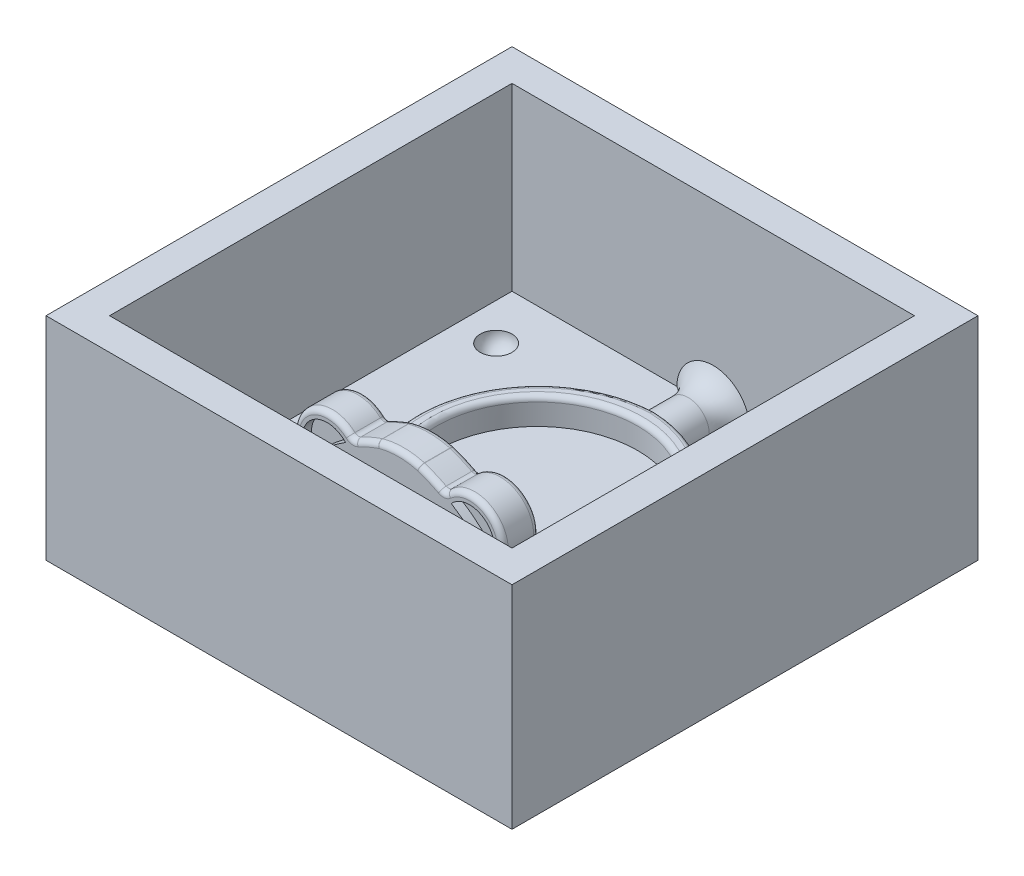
ISO-10303-21;
HEADER;
FILE_DESCRIPTION(('STEP AP214'),'2;1');
FILE_NAME('part.step','',(''),(''),'','','');
FILE_SCHEMA(('AUTOMOTIVE_DESIGN { 1 0 10303 214 1 1 1 1 }'));
ENDSEC;
DATA;
#1=APPLICATION_CONTEXT('core data for automotive mechanical design processes');
#2=APPLICATION_PROTOCOL_DEFINITION('international standard','automotive_design',2000,#1);
#3=PRODUCT_CONTEXT('',#1,'mechanical');
#4=PRODUCT('Part','Part','',(#3));
#5=PRODUCT_RELATED_PRODUCT_CATEGORY('part','',(#4));
#6=PRODUCT_DEFINITION_FORMATION('','',#4);
#7=PRODUCT_DEFINITION_CONTEXT('part definition',#1,'design');
#8=PRODUCT_DEFINITION('design','',#6,#7);
#9=PRODUCT_DEFINITION_SHAPE('','',#8);
#10=(LENGTH_UNIT() NAMED_UNIT(*) SI_UNIT(.MILLI.,.METRE.));
#11=(NAMED_UNIT(*) PLANE_ANGLE_UNIT() SI_UNIT($,.RADIAN.));
#12=(NAMED_UNIT(*) SI_UNIT($,.STERADIAN.) SOLID_ANGLE_UNIT());
#13=UNCERTAINTY_MEASURE_WITH_UNIT(LENGTH_MEASURE(1.E-05),#10,'distance_accuracy_value','');
#14=(GEOMETRIC_REPRESENTATION_CONTEXT(3) GLOBAL_UNCERTAINTY_ASSIGNED_CONTEXT((#13)) GLOBAL_UNIT_ASSIGNED_CONTEXT((#10,
#11,#12)) REPRESENTATION_CONTEXT('',''));
#15=CARTESIAN_POINT('',(0.,0.,0.));
#16=DIRECTION('',(0.,0.,1.));
#17=DIRECTION('',(1.,0.,0.));
#18=AXIS2_PLACEMENT_3D('',#15,#16,#17);
#19=CARTESIAN_POINT('',(-1.05964108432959,28.5,-9.10136972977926));
#20=DIRECTION('',(0.,1.,0.));
#21=DIRECTION('',(0.,0.,1.));
#22=AXIS2_PLACEMENT_3D('',#19,#20,#21);
#23=CYLINDRICAL_SURFACE('',#22,11.4251930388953);
#24=CARTESIAN_POINT('',(-3.44,31.,-20.2758463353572));
#25=CARTESIAN_POINT('',(-3.44000034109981,31.0555815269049,-20.2758438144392));
#26=CARTESIAN_POINT('',(-3.43768154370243,31.1111358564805,-20.2763404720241));
#27=CARTESIAN_POINT('',(-3.42843562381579,31.2218355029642,-20.2783049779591));
#28=CARTESIAN_POINT('',(-3.42150907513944,31.2769808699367,-20.2797727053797));
#29=CARTESIAN_POINT('',(-3.39390778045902,31.4410195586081,-20.2855822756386));
#30=CARTESIAN_POINT('',(-3.36641103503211,31.5487959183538,-20.2913307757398));
#31=CARTESIAN_POINT('',(-3.2940768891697,31.7580747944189,-20.3059971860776));
#32=CARTESIAN_POINT('',(-3.24923737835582,31.8595765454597,-20.3149154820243));
#33=CARTESIAN_POINT('',(-3.14354135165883,32.053636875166,-20.3350369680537));
#34=CARTESIAN_POINT('',(-3.08268296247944,32.1461944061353,-20.3462404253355));
#35=CARTESIAN_POINT('',(-2.94574775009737,32.3210684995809,-20.3700216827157));
#36=CARTESIAN_POINT('',(-2.86948083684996,32.4032339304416,-20.3826156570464));
#37=CARTESIAN_POINT('',(-2.70430020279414,32.5537144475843,-20.4078767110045));
#38=CARTESIAN_POINT('',(-2.6153831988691,32.6220259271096,-20.4205438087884));
#39=CARTESIAN_POINT('',(-2.42610674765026,32.7436780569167,-20.4449590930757));
#40=CARTESIAN_POINT('',(-2.32561675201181,32.7968183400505,-20.4566936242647));
#41=CARTESIAN_POINT('',(-2.116934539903,32.885359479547,-20.4780181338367));
#42=CARTESIAN_POINT('',(-2.00874875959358,32.9207749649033,-20.4876098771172));
#43=CARTESIAN_POINT('',(-1.82999432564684,32.9628661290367,-20.5007689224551));
#44=CARTESIAN_POINT('',(-1.76080713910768,32.9753510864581,-20.5052389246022));
#45=CARTESIAN_POINT('',(-1.62152591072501,32.9929812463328,-20.5129524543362));
#46=CARTESIAN_POINT('',(-1.55143312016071,32.9981356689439,-20.5161975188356));
#47=CARTESIAN_POINT('',(-1.48120284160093,32.9995755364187,-20.5187828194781));
#48=B_SPLINE_CURVE_WITH_KNOTS('',3,(#24,#25,#26,#27,#28,#29,#30,#31,#32,#33,#34,#35,#36,#37,#38,
#39,#40,#41,#42,#43,#44,#45,#46,#47),.UNSPECIFIED.,.F.,.F.,(4,2,2,2,2,2,2,2,2,2,2,4),(0.,
0.166640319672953,0.33325989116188,0.665668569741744,0.998117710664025,1.33060574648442,
1.66747800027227,2.0044378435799,2.34566133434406,2.68660273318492,2.8975752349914,
3.10828214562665),.UNSPECIFIED.);
#49=CARTESIAN_POINT('',(-3.44,31.,-20.2758463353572));
#50=VERTEX_POINT('',#49);
#51=CARTESIAN_POINT('',(-1.48120284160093,32.9995755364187,-20.5187828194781));
#52=VERTEX_POINT('',#51);
#53=EDGE_CURVE('E534',#50,#52,#48,.T.);
#54=ORIENTED_EDGE('',*,*,#53,.F.);
#55=CARTESIAN_POINT('',(-1.05964108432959,31.,-9.10136972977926));
#56=DIRECTION('',(0.,1.,0.));
#57=DIRECTION('',(0.,0.,1.));
#58=AXIS2_PLACEMENT_3D('',#55,#56,#57);
#59=CIRCLE('',#58,11.4251930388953);
#60=CARTESIAN_POINT('',(-7.50856609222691,31.,0.329770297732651));
#61=VERTEX_POINT('',#60);
#62=EDGE_CURVE('E726',#50,#61,#59,.T.);
#63=ORIENTED_EDGE('',*,*,#62,.T.);
#64=DIRECTION('',(0.,1.,0.));
#65=VECTOR('',#64,1.);
#66=CARTESIAN_POINT('',(-7.50856609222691,28.5,0.329770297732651));
#67=LINE('',#66,#65);
#68=CARTESIAN_POINT('',(-7.50856609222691,33.,0.329770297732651));
#69=VERTEX_POINT('',#68);
#70=EDGE_CURVE('E1111',#61,#69,#67,.T.);
#71=ORIENTED_EDGE('',*,*,#70,.T.);
#72=CARTESIAN_POINT('',(-1.05964108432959,33.,-9.10136972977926));
#73=DIRECTION('',(0.,1.,0.));
#74=DIRECTION('',(0.,0.,1.));
#75=AXIS2_PLACEMENT_3D('',#72,#73,#74);
#76=CIRCLE('',#75,11.4251930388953);
#77=CARTESIAN_POINT('',(-1.48120284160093,33.,-20.5187828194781));
#78=VERTEX_POINT('',#77);
#79=EDGE_CURVE('E1621',#69,#78,#76,.F.);
#80=ORIENTED_EDGE('',*,*,#79,.T.);
#81=DIRECTION('',(0.,1.,0.));
#82=VECTOR('',#81,1.);
#83=CARTESIAN_POINT('',(-1.48120284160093,28.5,-20.5187828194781));
#84=LINE('',#83,#82);
#85=EDGE_CURVE('E729',#52,#78,#84,.T.);
#86=ORIENTED_EDGE('',*,*,#85,.F.);
#87=EDGE_LOOP('',(#54,#63,#71,#80,#86));
#88=FACE_BOUND('',#87,.T.);
#89=ADVANCED_FACE('F52',(#88),#23,.T.);
#90=CARTESIAN_POINT('',(-1.90276459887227,28.5,-9.10136972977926));
#91=DIRECTION('',(0.,1.,0.));
#92=DIRECTION('',(0.,0.,1.));
#93=AXIS2_PLACEMENT_3D('',#90,#91,#92);
#94=CYLINDRICAL_SURFACE('',#93,11.4251930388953);
#95=CARTESIAN_POINT('',(-1.90276459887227,31.,-9.10136972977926));
#96=DIRECTION('',(0.,1.,0.));
#97=DIRECTION('',(0.,0.,1.));
#98=AXIS2_PLACEMENT_3D('',#95,#96,#97);
#99=CIRCLE('',#98,11.4251930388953);
#100=CARTESIAN_POINT('',(0.560000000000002,31.,-20.2579743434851));
#101=VERTEX_POINT('',#100);
#102=CARTESIAN_POINT('',(4.54616040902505,31.,0.32977029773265));
#103=VERTEX_POINT('',#102);
#104=EDGE_CURVE('E845',#101,#103,#99,.F.);
#105=ORIENTED_EDGE('',*,*,#104,.F.);
#106=CARTESIAN_POINT('',(0.560000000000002,31.,-20.2579743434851));
#107=CARTESIAN_POINT('',(0.560000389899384,31.0555264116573,-20.2579718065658));
#108=CARTESIAN_POINT('',(0.557686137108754,31.1110256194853,-20.2584853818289));
#109=CARTESIAN_POINT('',(0.548458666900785,31.2216147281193,-20.2605172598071));
#110=CARTESIAN_POINT('',(0.541546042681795,31.2767046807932,-20.262035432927));
#111=CARTESIAN_POINT('',(0.514002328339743,31.4405694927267,-20.2680455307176));
#112=CARTESIAN_POINT('',(0.486565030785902,31.5482274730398,-20.2739933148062));
#113=CARTESIAN_POINT('',(0.414396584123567,31.7572721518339,-20.2891819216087));
#114=CARTESIAN_POINT('',(0.369663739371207,31.8586582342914,-20.2984230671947));
#115=CARTESIAN_POINT('',(0.264229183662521,32.052508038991,-20.3193041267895));
#116=CARTESIAN_POINT('',(0.203524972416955,32.1449703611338,-20.3309444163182));
#117=CARTESIAN_POINT('',(0.0668869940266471,32.3197622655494,-20.3557192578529));
#118=CARTESIAN_POINT('',(-0.00924892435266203,32.4019310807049,-20.3688725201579));
#119=CARTESIAN_POINT('',(-0.174143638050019,32.5524399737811,-20.3953445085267));
#120=CARTESIAN_POINT('',(-0.262904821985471,32.6207774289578,-20.4086632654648));
#121=CARTESIAN_POINT('',(-0.451990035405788,32.742602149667,-20.4344853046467));
#122=CARTESIAN_POINT('',(-0.552458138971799,32.7958688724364,-20.4469746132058));
#123=CARTESIAN_POINT('',(-0.76114236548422,32.8846735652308,-20.4698669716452));
#124=CARTESIAN_POINT('',(-0.869354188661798,32.9202212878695,-20.4802711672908));
#125=CARTESIAN_POINT('',(-1.06178347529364,32.9657173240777,-20.4958656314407));
#126=CARTESIAN_POINT('',(-1.14497029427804,32.9799082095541,-20.5017084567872));
#127=CARTESIAN_POINT('',(-1.31251675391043,32.9977145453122,-20.5116190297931));
#128=CARTESIAN_POINT('',(-1.39687561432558,33.0013367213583,-20.5156879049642));
#129=CARTESIAN_POINT('',(-1.48120284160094,32.9995755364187,-20.5187828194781));
#130=B_SPLINE_CURVE_WITH_KNOTS('',3,(#106,#107,#108,#109,#110,#111,#112,#113,#114,#115,#116,
#117,#118,#119,#120,#121,#122,#123,#124,#125,#126,#127,#128,#129),.UNSPECIFIED.,.F.,.F.,(4,2,2,
2,2,2,2,2,2,2,2,4),(0.,0.166474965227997,0.332928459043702,0.664982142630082,0.997068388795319,
1.3292066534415,1.66601536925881,2.00288789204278,2.34446147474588,2.68584684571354,
2.93896028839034,3.19191261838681),.UNSPECIFIED.);
#131=CARTESIAN_POINT('',(-1.44,33.,-20.5171870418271));
#132=VERTEX_POINT('',#131);
#133=EDGE_CURVE('E78',#101,#132,#130,.T.);
#134=ORIENTED_EDGE('',*,*,#133,.T.);
#135=CARTESIAN_POINT('',(-1.90276459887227,33.,-9.10136972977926));
#136=DIRECTION('',(0.,1.,0.));
#137=DIRECTION('',(0.,0.,1.));
#138=AXIS2_PLACEMENT_3D('',#135,#136,#137);
#139=CIRCLE('',#138,11.4251930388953);
#140=CARTESIAN_POINT('',(4.54616040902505,33.,0.329770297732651));
#141=VERTEX_POINT('',#140);
#142=EDGE_CURVE('E1626',#132,#141,#139,.F.);
#143=ORIENTED_EDGE('',*,*,#142,.T.);
#144=DIRECTION('',(0.,1.,0.));
#145=VECTOR('',#144,1.);
#146=CARTESIAN_POINT('',(4.54616040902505,28.5,0.329770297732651));
#147=LINE('',#146,#145);
#148=EDGE_CURVE('E1103',#103,#141,#147,.T.);
#149=ORIENTED_EDGE('',*,*,#148,.F.);
#150=EDGE_LOOP('',(#105,#134,#143,#149));
#151=FACE_BOUND('',#150,.T.);
#152=ADVANCED_FACE('F541',(#151),#94,.T.);
#153=EDGE_CURVE('E939',#78,#132,#139,.F.);
#154=ORIENTED_EDGE('',*,*,#153,.T.);
#155=EDGE_CURVE('E70',#132,#52,#130,.T.);
#156=ORIENTED_EDGE('',*,*,#155,.T.);
#157=ORIENTED_EDGE('',*,*,#85,.T.);
#158=EDGE_LOOP('',(#154,#156,#157));
#159=FACE_BOUND('',#158,.T.);
#160=ADVANCED_FACE('F567',(#159),#94,.T.);
#161=CARTESIAN_POINT('',(0.,31.,0.));
#162=DIRECTION('',(0.,-1.,0.));
#163=DIRECTION('',(0.,0.,-1.));
#164=AXIS2_PLACEMENT_3D('',#161,#162,#163);
#165=PLANE('',#164);
#166=CARTESIAN_POINT('',(14.06,31.,-20.9585461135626));
#167=DIRECTION('',(0.,-1.,0.));
#168=DIRECTION('',(0.,0.,-1.));
#169=AXIS2_PLACEMENT_3D('',#166,#167,#168);
#170=CIRCLE('',#169,1.5);
#171=CARTESIAN_POINT('',(14.06,31.,-22.4585461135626));
#172=VERTEX_POINT('',#171);
#173=EDGE_CURVE('E56',#172,#172,#170,.T.);
#174=ORIENTED_EDGE('',*,*,#173,.T.);
#175=EDGE_LOOP('',(#174));
#176=FACE_BOUND('',#175,.T.);
#177=CARTESIAN_POINT('',(14.0600000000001,31.,7.04145388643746));
#178=DIRECTION('',(0.,-1.,0.));
#179=DIRECTION('',(0.,0.,-1.));
#180=AXIS2_PLACEMENT_3D('',#177,#178,#179);
#181=CIRCLE('',#180,1.5);
#182=CARTESIAN_POINT('',(14.0600000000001,31.,5.54145388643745));
#183=VERTEX_POINT('',#182);
#184=EDGE_CURVE('E752',#183,#183,#181,.T.);
#185=ORIENTED_EDGE('',*,*,#184,.T.);
#186=EDGE_LOOP('',(#185));
#187=FACE_BOUND('',#186,.T.);
#188=CARTESIAN_POINT('',(-16.94,31.,-20.9585461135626));
#189=DIRECTION('',(0.,-1.,0.));
#190=DIRECTION('',(0.,0.,-1.));
#191=AXIS2_PLACEMENT_3D('',#188,#189,#190);
#192=CIRCLE('',#191,1.5);
#193=CARTESIAN_POINT('',(-16.94,31.,-22.4585461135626));
#194=VERTEX_POINT('',#193);
#195=EDGE_CURVE('E473',#194,#194,#192,.T.);
#196=ORIENTED_EDGE('',*,*,#195,.T.);
#197=EDGE_LOOP('',(#196));
#198=FACE_BOUND('',#197,.T.);
#199=CARTESIAN_POINT('',(-16.9399999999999,31.,7.04145388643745));
#200=DIRECTION('',(0.,-1.,0.));
#201=DIRECTION('',(0.,0.,-1.));
#202=AXIS2_PLACEMENT_3D('',#199,#200,#201);
#203=CIRCLE('',#202,1.5);
#204=CARTESIAN_POINT('',(-16.9399999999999,31.,5.54145388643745));
#205=VERTEX_POINT('',#204);
#206=EDGE_CURVE('E745',#205,#205,#203,.T.);
#207=ORIENTED_EDGE('',*,*,#206,.T.);
#208=EDGE_LOOP('',(#207));
#209=FACE_BOUND('',#208,.T.);
#210=DIRECTION('',(0.,0.,-1.));
#211=VECTOR('',#210,1.);
#212=CARTESIAN_POINT('',(17.56,31.,-25.9585461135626));
#213=LINE('',#212,#211);
#214=CARTESIAN_POINT('',(17.56,31.,12.0414538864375));
#215=VERTEX_POINT('',#214);
#216=CARTESIAN_POINT('',(17.56,31.,-25.9585461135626));
#217=VERTEX_POINT('',#216);
#218=EDGE_CURVE('E476',#215,#217,#213,.T.);
#219=ORIENTED_EDGE('',*,*,#218,.T.);
#220=DIRECTION('',(-1.,0.,0.));
#221=VECTOR('',#220,1.);
#222=CARTESIAN_POINT('',(-20.44,31.,-25.9585461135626));
#223=LINE('',#222,#221);
#224=CARTESIAN_POINT('',(1.99445520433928,31.,-25.9585461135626));
#225=VERTEX_POINT('',#224);
#226=EDGE_CURVE('E447',#217,#225,#223,.T.);
#227=ORIENTED_EDGE('',*,*,#226,.T.);
#228=CARTESIAN_POINT('',(3.23713193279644,31.,-23.5873038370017));
#229=DIRECTION('',(0.,1.,0.));
#230=DIRECTION('',(0.,0.,1.));
#231=AXIS2_PLACEMENT_3D('',#228,#229,#230);
#232=CIRCLE('',#231,2.67713193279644);
#233=CARTESIAN_POINT('',(0.560000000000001,31.,-23.5873038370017));
#234=VERTEX_POINT('',#233);
#235=EDGE_CURVE('E506',#234,#225,#232,.F.);
#236=ORIENTED_EDGE('',*,*,#235,.F.);
#237=DIRECTION('',(0.,0.,1.));
#238=VECTOR('',#237,1.);
#239=CARTESIAN_POINT('',(0.560000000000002,31.,-20.0351857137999));
#240=LINE('',#239,#238);
#241=EDGE_CURVE('E12',#101,#234,#240,.F.);
#242=ORIENTED_EDGE('',*,*,#241,.F.);
#243=ORIENTED_EDGE('',*,*,#104,.T.);
#244=DIRECTION('',(1.,0.,0.));
#245=VECTOR('',#244,1.);
#246=CARTESIAN_POINT('',(-0.132192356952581,31.,0.32977029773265));
#247=LINE('',#246,#245);
#248=CARTESIAN_POINT('',(9.56216297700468,31.,0.329770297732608));
#249=VERTEX_POINT('',#248);
#250=EDGE_CURVE('E837',#103,#249,#247,.T.);
#251=ORIENTED_EDGE('',*,*,#250,.T.);
#252=CARTESIAN_POINT('',(9.14873501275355,31.,0.53740826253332));
#253=CARTESIAN_POINT('',(9.16563144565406,31.,0.514425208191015));
#254=CARTESIAN_POINT('',(9.18451102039,31.,0.492871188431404));
#255=CARTESIAN_POINT('',(9.22565214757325,31.,0.453236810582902));
#256=CARTESIAN_POINT('',(9.2479185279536,31.,0.435161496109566));
#257=CARTESIAN_POINT('',(9.2951300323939,31.,0.403006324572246));
#258=CARTESIAN_POINT('',(9.3200717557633,31.,0.388921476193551));
#259=CARTESIAN_POINT('',(9.37193432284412,31.,0.365082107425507));
#260=CARTESIAN_POINT('',(9.39885465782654,31.,0.355326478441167));
#261=CARTESIAN_POINT('',(9.45428949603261,31.,0.340285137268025));
#262=CARTESIAN_POINT('',(9.48282006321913,31.,0.335058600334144));
#263=CARTESIAN_POINT('',(9.54035523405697,31.,0.329423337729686));
#264=CARTESIAN_POINT('',(9.56935988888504,31.,0.329015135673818));
#265=CARTESIAN_POINT('',(9.62728370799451,31.,0.333048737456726));
#266=CARTESIAN_POINT('',(9.65619996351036,31.,0.337532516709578));
#267=CARTESIAN_POINT('',(9.71286528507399,31.,0.35130676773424));
#268=CARTESIAN_POINT('',(9.74061435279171,31.,0.360597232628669));
#269=CARTESIAN_POINT('',(9.79404809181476,31.,0.383707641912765));
#270=CARTESIAN_POINT('',(9.81973940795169,31.,0.397512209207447));
#271=CARTESIAN_POINT('',(9.86839755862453,31.,0.429294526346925));
#272=CARTESIAN_POINT('',(9.89136457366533,31.,0.447271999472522));
#273=CARTESIAN_POINT('',(9.93358442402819,31.,0.486638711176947));
#274=CARTESIAN_POINT('',(9.95288303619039,31.,0.507978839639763));
#275=CARTESIAN_POINT('',(9.98754736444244,31.,0.55364529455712));
#276=CARTESIAN_POINT('',(10.0029134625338,31.,0.577971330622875));
#277=CARTESIAN_POINT('',(10.028995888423,31.,0.628465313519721));
#278=CARTESIAN_POINT('',(10.0397882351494,31.,0.654593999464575));
#279=CARTESIAN_POINT('',(10.0567632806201,31.,0.708307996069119));
#280=CARTESIAN_POINT('',(10.0629463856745,31.,0.735893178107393));
#281=CARTESIAN_POINT('',(10.0704531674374,31.,0.791328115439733));
#282=CARTESIAN_POINT('',(10.0718427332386,31.,0.819168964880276));
#283=CARTESIAN_POINT('',(10.0699033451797,31.,0.874685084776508));
#284=CARTESIAN_POINT('',(10.0665745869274,31.,0.902360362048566));
#285=CARTESIAN_POINT('',(10.0553303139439,31.,0.956624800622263));
#286=CARTESIAN_POINT('',(10.0474365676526,31.,0.983218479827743));
#287=CARTESIAN_POINT('',(10.0273223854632,31.,1.03471470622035));
#288=CARTESIAN_POINT('',(10.0151018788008,31.,1.05961722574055));
#289=CARTESIAN_POINT('',(9.98661659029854,31.,1.10719346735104));
#290=CARTESIAN_POINT('',(9.97032789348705,31.,1.12985286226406));
#291=CARTESIAN_POINT('',(9.93422726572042,31.,1.17216426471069));
#292=CARTESIAN_POINT('',(9.91441510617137,31.,1.19181607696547));
#293=CARTESIAN_POINT('',(9.8715310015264,31.,1.22786031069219));
#294=CARTESIAN_POINT('',(9.84841638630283,31.,1.2442019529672));
#295=CARTESIAN_POINT('',(9.79980906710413,31.,1.27284913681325));
#296=CARTESIAN_POINT('',(9.77431615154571,31.,1.28515431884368));
#297=CARTESIAN_POINT('',(9.72120912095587,31.,1.30559763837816));
#298=CARTESIAN_POINT('',(9.69356619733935,31.,1.31366095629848));
#299=CARTESIAN_POINT('',(9.6373264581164,31.,1.32509862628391));
#300=CARTESIAN_POINT('',(9.60872956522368,31.,1.32847259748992));
#301=CARTESIAN_POINT('',(9.55099902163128,31.,1.33046395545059));
#302=CARTESIAN_POINT('',(9.5218632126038,31.,1.3290192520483));
#303=CARTESIAN_POINT('',(9.46424299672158,31.,1.32127512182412));
#304=CARTESIAN_POINT('',(9.4357586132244,31.,1.31497552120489));
#305=CARTESIAN_POINT('',(9.3801690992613,31.,1.297657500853));
#306=CARTESIAN_POINT('',(9.35306824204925,31.,1.28662534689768));
#307=CARTESIAN_POINT('',(9.30112677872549,31.,1.26012718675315));
#308=CARTESIAN_POINT('',(9.27628610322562,31.,1.24466131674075));
#309=CARTESIAN_POINT('',(9.22982674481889,31.,1.20987106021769));
#310=CARTESIAN_POINT('',(9.2081805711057,31.,1.19058340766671));
#311=CARTESIAN_POINT('',(9.16850579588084,31.,1.14858886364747));
#312=CARTESIAN_POINT('',(9.1504768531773,31.,1.12588229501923));
#313=CARTESIAN_POINT('',(9.118894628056,31.,1.07812402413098));
#314=CARTESIAN_POINT('',(9.10526754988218,31.,1.05312112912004));
#315=CARTESIAN_POINT('',(9.08249470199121,31.,1.00115269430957));
#316=CARTESIAN_POINT('',(9.07334824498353,31.,0.974187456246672));
#317=CARTESIAN_POINT('',(9.05995905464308,31.,0.919588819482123));
#318=CARTESIAN_POINT('',(9.05562986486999,31.,0.891976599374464));
#319=CARTESIAN_POINT('',(9.05171821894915,31.,0.836410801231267));
#320=CARTESIAN_POINT('',(9.05213665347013,31.,0.808457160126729));
#321=CARTESIAN_POINT('',(9.05768121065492,31.,0.753284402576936));
#322=CARTESIAN_POINT('',(9.06276410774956,31.,0.726060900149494));
#323=CARTESIAN_POINT('',(9.07741315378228,31.,0.67287404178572));
#324=CARTESIAN_POINT('',(9.08697373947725,31.,0.646909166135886));
#325=CARTESIAN_POINT('',(9.10554600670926,31.,0.607063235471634));
#326=CARTESIAN_POINT('',(9.113216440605,31.,0.592541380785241));
#327=CARTESIAN_POINT('',(9.12995082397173,31.,0.564324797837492));
#328=CARTESIAN_POINT('',(9.13901475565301,31.,0.55063005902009));
#329=CARTESIAN_POINT('',(9.14873501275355,31.,0.53740826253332));
#330=B_SPLINE_CURVE_WITH_KNOTS('',3,(#252,#253,#254,#255,#256,#257,#258,#259,#260,#261,#262,
#263,#264,#265,#266,#267,#268,#269,#270,#271,#272,#273,#274,#275,#276,#277,#278,#279,#280,#281,
#282,#283,#284,#285,#286,#287,#288,#289,#290,#291,#292,#293,#294,#295,#296,#297,#298,#299,#300,
#301,#302,#303,#304,#305,#306,#307,#308,#309,#310,#311,#312,#313,#314,#315,#316,#317,#318,#319,
#320,#321,#322,#323,#324,#325,#326,#327,#328,#329),.UNSPECIFIED.,.T.,.F.,(4,2,2,2,2,2,2,2,2,2,2,
2,2,2,2,2,2,2,2,2,2,2,2,2,2,2,2,2,2,2,2,2,2,2,2,2,2,2,4),(0.,0.0855155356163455,
0.171154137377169,0.256685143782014,0.342194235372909,0.428804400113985,0.515423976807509,
0.602792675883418,0.690161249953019,0.777235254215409,0.8643034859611,0.950201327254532,
1.03609082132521,1.12049073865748,1.20488321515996,1.28811095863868,1.3713352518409,
1.45416591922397,1.53699794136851,1.6203288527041,1.70366517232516,1.78819650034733,
1.87273535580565,1.95871918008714,2.0447099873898,2.13181307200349,2.21891927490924,
2.30627999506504,2.39363803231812,2.48019392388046,2.56674164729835,2.65175240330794,
2.73675011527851,2.8201964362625,2.90365841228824,2.98635467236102,3.06894845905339,
3.11814485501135,3.16734062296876),.UNSPECIFIED.);
#331=CARTESIAN_POINT('',(10.0711725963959,31.,0.82977029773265));
#332=VERTEX_POINT('',#331);
#333=EDGE_CURVE('E600',#249,#332,#330,.T.);
#334=ORIENTED_EDGE('',*,*,#333,.T.);
#335=DIRECTION('',(0.,0.,-1.));
#336=VECTOR('',#335,1.);
#337=CARTESIAN_POINT('',(10.0711725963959,31.,3.72977029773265));
#338=LINE('',#337,#336);
#339=CARTESIAN_POINT('',(10.0711725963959,31.,3.22977029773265));
#340=VERTEX_POINT('',#339);
#341=EDGE_CURVE('E814',#340,#332,#338,.T.);
#342=ORIENTED_EDGE('',*,*,#341,.F.);
#343=CARTESIAN_POINT('',(9.10321153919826,31.,3.44719737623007));
#344=CARTESIAN_POINT('',(9.09100329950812,31.,3.42240916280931));
#345=CARTESIAN_POINT('',(9.08086345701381,31.,3.39658183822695));
#346=CARTESIAN_POINT('',(9.06505144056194,31.,3.3435728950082));
#347=CARTESIAN_POINT('',(9.05938382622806,31.,3.31638992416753));
#348=CARTESIAN_POINT('',(9.05270825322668,31.,3.26145924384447));
#349=CARTESIAN_POINT('',(9.05169954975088,31.,3.23371162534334));
#350=CARTESIAN_POINT('',(9.05437361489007,31.,3.17845018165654));
#351=CARTESIAN_POINT('',(9.05805536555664,31.,3.15093630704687));
#352=CARTESIAN_POINT('',(9.06997101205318,31.,3.09700648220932));
#353=CARTESIAN_POINT('',(9.07819028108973,31.,3.07058729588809));
#354=CARTESIAN_POINT('',(9.09891422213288,31.,3.01948742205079));
#355=CARTESIAN_POINT('',(9.11141913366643,31.,2.99480683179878));
#356=CARTESIAN_POINT('',(9.14044782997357,31.,2.94766864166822));
#357=CARTESIAN_POINT('',(9.15700231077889,31.,2.92522995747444));
#358=CARTESIAN_POINT('',(9.19358503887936,31.,2.88339134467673));
#359=CARTESIAN_POINT('',(9.21361356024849,31.,2.86399165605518));
#360=CARTESIAN_POINT('',(9.25693758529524,31.,2.82842513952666));
#361=CARTESIAN_POINT('',(9.28028300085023,31.,2.81231911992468));
#362=CARTESIAN_POINT('',(9.32930723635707,31.,2.78417201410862));
#363=CARTESIAN_POINT('',(9.35498628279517,31.,2.77213132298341));
#364=CARTESIAN_POINT('',(9.40845525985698,31.,2.75223174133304));
#365=CARTESIAN_POINT('',(9.43627529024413,31.,2.74445368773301));
#366=CARTESIAN_POINT('',(9.49282050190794,31.,2.73361860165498));
#367=CARTESIAN_POINT('',(9.52154575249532,31.,2.73056193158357));
#368=CARTESIAN_POINT('',(9.57943972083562,31.,2.72924112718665));
#369=CARTESIAN_POINT('',(9.60860972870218,31.,2.73103275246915));
#370=CARTESIAN_POINT('',(9.66623634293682,31.,2.73948671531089));
#371=CARTESIAN_POINT('',(9.69469293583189,31.,2.74614914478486));
#372=CARTESIAN_POINT('',(9.75007556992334,31.,2.76417759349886));
#373=CARTESIAN_POINT('',(9.7770016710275,31.,2.77554342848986));
#374=CARTESIAN_POINT('',(9.8285334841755,31.,2.8026836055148));
#375=CARTESIAN_POINT('',(9.8531393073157,31.,2.81845773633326));
#376=CARTESIAN_POINT('',(9.89902922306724,31.,2.85378963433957));
#377=CARTESIAN_POINT('',(9.92034730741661,31.,2.87330323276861));
#378=CARTESIAN_POINT('',(9.9593348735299,31.,2.91568771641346));
#379=CARTESIAN_POINT('',(9.97700469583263,31.,2.93855828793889));
#380=CARTESIAN_POINT('',(10.0078729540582,31.,2.98659040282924));
#381=CARTESIAN_POINT('',(10.0211423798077,31.,3.0117063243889));
#382=CARTESIAN_POINT('',(10.0431999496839,31.,3.06383446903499));
#383=CARTESIAN_POINT('',(10.0519885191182,31.,3.0908465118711));
#384=CARTESIAN_POINT('',(10.0647037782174,31.,3.1455505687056));
#385=CARTESIAN_POINT('',(10.0687035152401,31.,3.17322561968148));
#386=CARTESIAN_POINT('',(10.0719606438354,31.,3.22885279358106));
#387=CARTESIAN_POINT('',(10.0712183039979,31.,3.25680490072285));
#388=CARTESIAN_POINT('',(10.0650389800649,31.,3.31196948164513));
#389=CARTESIAN_POINT('',(10.0596375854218,31.,3.33918595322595));
#390=CARTESIAN_POINT('',(10.0443558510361,31.,3.39232991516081));
#391=CARTESIAN_POINT('',(10.0344755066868,31.,3.41825740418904));
#392=CARTESIAN_POINT('',(10.0104996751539,31.,3.46818315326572));
#393=CARTESIAN_POINT('',(9.99639102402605,31.,3.49217508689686));
#394=CARTESIAN_POINT('',(9.96439305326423,31.,3.53748786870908));
#395=CARTESIAN_POINT('',(9.94650353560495,31.,3.55880857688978));
#396=CARTESIAN_POINT('',(9.90721977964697,31.,3.59846528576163));
#397=CARTESIAN_POINT('',(9.88578452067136,31.,3.61676063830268));
#398=CARTESIAN_POINT('',(9.84019043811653,31.,3.64956478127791));
#399=CARTESIAN_POINT('',(9.81603137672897,31.,3.66407324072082));
#400=CARTESIAN_POINT('',(9.76523629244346,31.,3.68915241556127));
#401=CARTESIAN_POINT('',(9.73856513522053,31.,3.69965197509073));
#402=CARTESIAN_POINT('',(9.68385410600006,31.,3.7160980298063));
#403=CARTESIAN_POINT('',(9.6558141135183,31.,3.7220441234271));
#404=CARTESIAN_POINT('',(9.5987181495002,31.,3.72929274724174));
#405=CARTESIAN_POINT('',(9.56965328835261,31.,3.73052537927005));
#406=CARTESIAN_POINT('',(9.51172521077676,31.,3.72812614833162));
#407=CARTESIAN_POINT('',(9.48286199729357,31.,3.72449421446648));
#408=CARTESIAN_POINT('',(9.42597668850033,31.,3.7124233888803));
#409=CARTESIAN_POINT('',(9.39796066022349,31.,3.70395586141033));
#410=CARTESIAN_POINT('',(9.34375238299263,31.,3.68240756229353));
#411=CARTESIAN_POINT('',(9.31756056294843,31.,3.66932571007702));
#412=CARTESIAN_POINT('',(9.26792126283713,31.,3.63898089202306));
#413=CARTESIAN_POINT('',(9.24445954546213,31.,3.62174120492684));
#414=CARTESIAN_POINT('',(9.20084613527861,31.,3.58351982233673));
#415=CARTESIAN_POINT('',(9.18069020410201,31.,3.56254299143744));
#416=CARTESIAN_POINT('',(9.15094933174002,31.,3.52568628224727));
#417=CARTESIAN_POINT('',(9.14019020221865,31.,3.51073806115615));
#418=CARTESIAN_POINT('',(9.12038558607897,31.,3.47974589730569));
#419=CARTESIAN_POINT('',(9.11134007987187,31.,3.4637019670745));
#420=CARTESIAN_POINT('',(9.10321153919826,31.,3.44719737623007));
#421=B_SPLINE_CURVE_WITH_KNOTS('',3,(#343,#344,#345,#346,#347,#348,#349,#350,#351,#352,#353,
#354,#355,#356,#357,#358,#359,#360,#361,#362,#363,#364,#365,#366,#367,#368,#369,#370,#371,#372,
#373,#374,#375,#376,#377,#378,#379,#380,#381,#382,#383,#384,#385,#386,#387,#388,#389,#390,#391,
#392,#393,#394,#395,#396,#397,#398,#399,#400,#401,#402,#403,#404,#405,#406,#407,#408,#409,#410,
#411,#412,#413,#414,#415,#416,#417,#418,#419,#420),.UNSPECIFIED.,.T.,.F.,(4,2,2,2,2,2,2,2,2,2,2,
2,2,2,2,2,2,2,2,2,2,2,2,2,2,2,2,2,2,2,2,2,2,2,2,2,2,2,4),(0.,0.0828280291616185,
0.165740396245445,0.248639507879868,0.331520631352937,0.414136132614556,0.496756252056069,
0.580023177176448,0.663296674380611,0.747991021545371,0.832693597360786,0.918951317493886,
1.00521565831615,1.09247631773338,1.1797386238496,1.26699751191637,1.35425221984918,
1.44053361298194,1.52680694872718,1.61161179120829,1.6964085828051,1.77989472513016,
1.86337613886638,1.94622544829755,2.029074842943,2.11218489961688,2.1952993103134,
2.27945283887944,2.36361372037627,2.44920574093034,2.53480530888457,2.62166945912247,
2.70853487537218,2.79592011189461,2.88332582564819,2.97025309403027,3.05706802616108,
3.11221755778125,3.16736645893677),.UNSPECIFIED.);
#422=CARTESIAN_POINT('',(9.56216297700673,31.,3.72977029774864));
#423=VERTEX_POINT('',#422);
#424=EDGE_CURVE('E62',#340,#423,#421,.T.);
#425=ORIENTED_EDGE('',*,*,#424,.T.);
#426=DIRECTION('',(1.,0.,0.));
#427=VECTOR('',#426,1.);
#428=CARTESIAN_POINT('',(-0.132192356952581,31.,3.72977029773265));
#429=LINE('',#428,#427);
#430=CARTESIAN_POINT('',(7.31966736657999,31.,3.72977029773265));
#431=VERTEX_POINT('',#430);
#432=EDGE_CURVE('E817',#431,#423,#429,.T.);
#433=ORIENTED_EDGE('',*,*,#432,.F.);
#434=DIRECTION('',(0.,0.,-1.));
#435=VECTOR('',#434,1.);
#436=CARTESIAN_POINT('',(7.31966736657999,31.,4.23977029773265));
#437=LINE('',#436,#435);
#438=CARTESIAN_POINT('',(7.31966736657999,31.,4.23977029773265));
#439=VERTEX_POINT('',#438);
#440=EDGE_CURVE('E825',#439,#431,#437,.T.);
#441=ORIENTED_EDGE('',*,*,#440,.F.);
#442=DIRECTION('',(-1.,0.,0.));
#443=VECTOR('',#442,1.);
#444=CARTESIAN_POINT('',(7.51746564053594,31.,4.23977029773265));
#445=LINE('',#444,#443);
#446=CARTESIAN_POINT('',(2.33364561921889,31.,4.23977029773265));
#447=VERTEX_POINT('',#446);
#448=EDGE_CURVE('E842',#439,#447,#445,.T.);
#449=ORIENTED_EDGE('',*,*,#448,.T.);
#450=DIRECTION('',(0.,0.,-1.));
#451=VECTOR('',#450,1.);
#452=CARTESIAN_POINT('',(2.33364561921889,31.,4.23977029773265));
#453=LINE('',#452,#451);
#454=CARTESIAN_POINT('',(2.33364561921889,31.,3.72977029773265));
#455=VERTEX_POINT('',#454);
#456=EDGE_CURVE('E618',#455,#447,#453,.F.);
#457=ORIENTED_EDGE('',*,*,#456,.F.);
#458=CARTESIAN_POINT('',(-5.3004059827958,31.,3.72977029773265));
#459=VERTEX_POINT('',#458);
#460=EDGE_CURVE('E617',#459,#455,#429,.T.);
#461=ORIENTED_EDGE('',*,*,#460,.F.);
#462=DIRECTION('',(0.,0.,-1.));
#463=VECTOR('',#462,1.);
#464=CARTESIAN_POINT('',(-5.3004059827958,31.,4.23977029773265));
#465=LINE('',#464,#463);
#466=CARTESIAN_POINT('',(-5.3004059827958,31.,4.23977029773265));
#467=VERTEX_POINT('',#466);
#468=EDGE_CURVE('E616',#467,#459,#465,.T.);
#469=ORIENTED_EDGE('',*,*,#468,.F.);
#470=DIRECTION('',(-1.,0.,0.));
#471=VECTOR('',#470,1.);
#472=CARTESIAN_POINT('',(-6.31674018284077,31.,4.23977029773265));
#473=LINE('',#472,#471);
#474=CARTESIAN_POINT('',(-10.2864277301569,31.,4.23977029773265));
#475=VERTEX_POINT('',#474);
#476=EDGE_CURVE('E1647',#467,#475,#473,.T.);
#477=ORIENTED_EDGE('',*,*,#476,.T.);
#478=DIRECTION('',(0.,0.,-1.));
#479=VECTOR('',#478,1.);
#480=CARTESIAN_POINT('',(-10.2864277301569,31.,4.23977029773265));
#481=LINE('',#480,#479);
#482=CARTESIAN_POINT('',(-10.2864277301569,31.,3.72977029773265));
#483=VERTEX_POINT('',#482);
#484=EDGE_CURVE('E829',#483,#475,#481,.F.);
#485=ORIENTED_EDGE('',*,*,#484,.F.);
#486=CARTESIAN_POINT('',(-12.5157123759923,31.,3.72977029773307));
#487=VERTEX_POINT('',#486);
#488=EDGE_CURVE('E820',#487,#483,#429,.T.);
#489=ORIENTED_EDGE('',*,*,#488,.F.);
#490=CARTESIAN_POINT('',(-12.9823485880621,31.,3.42988213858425));
#491=CARTESIAN_POINT('',(-12.9935835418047,31.,3.40460353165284));
#492=CARTESIAN_POINT('',(-13.0027037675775,31.,3.37836456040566));
#493=CARTESIAN_POINT('',(-13.0164184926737,31.,3.32470802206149));
#494=CARTESIAN_POINT('',(-13.0210081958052,31.,3.29728923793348));
#495=CARTESIAN_POINT('',(-13.0255068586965,31.,3.24207498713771));
#496=CARTESIAN_POINT('',(-13.0254170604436,31.,3.21427962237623));
#497=CARTESIAN_POINT('',(-13.0205615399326,31.,3.15910747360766));
#498=CARTESIAN_POINT('',(-13.0157968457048,31.,3.13173059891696));
#499=CARTESIAN_POINT('',(-13.0017547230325,31.,3.07821195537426));
#500=CARTESIAN_POINT('',(-12.992485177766,31.,3.05206811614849));
#501=CARTESIAN_POINT('',(-12.969720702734,31.,3.00169014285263));
#502=CARTESIAN_POINT('',(-12.9562255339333,31.,2.97745611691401));
#503=CARTESIAN_POINT('',(-12.9252951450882,31.,2.93137839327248));
#504=CARTESIAN_POINT('',(-12.9078304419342,31.,2.90955449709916));
#505=CARTESIAN_POINT('',(-12.8695359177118,31.,2.86909298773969));
#506=CARTESIAN_POINT('',(-12.8487058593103,31.,2.85045559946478));
#507=CARTESIAN_POINT('',(-12.8039312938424,31.,2.8165849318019));
#508=CARTESIAN_POINT('',(-12.7799436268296,31.,2.80140871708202));
#509=CARTESIAN_POINT('',(-12.7297945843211,31.,2.77521975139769));
#510=CARTESIAN_POINT('',(-12.7036330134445,31.,2.76420737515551));
#511=CARTESIAN_POINT('',(-12.6493965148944,31.,2.74646479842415));
#512=CARTESIAN_POINT('',(-12.621296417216,31.,2.73981150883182));
#513=CARTESIAN_POINT('',(-12.5643816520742,31.,2.73125514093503));
#514=CARTESIAN_POINT('',(-12.5355669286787,31.,2.72935243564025));
#515=CARTESIAN_POINT('',(-12.4776758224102,31.,2.73034729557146));
#516=CARTESIAN_POINT('',(-12.4486004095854,31.,2.73330229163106));
#517=CARTESIAN_POINT('',(-12.391355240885,31.,2.74404488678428));
#518=CARTESIAN_POINT('',(-12.363185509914,31.,2.75183261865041));
#519=CARTESIAN_POINT('',(-12.3085285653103,31.,2.77205187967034));
#520=CARTESIAN_POINT('',(-12.2820431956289,31.,2.78448839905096));
#521=CARTESIAN_POINT('',(-12.2315677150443,31.,2.81367908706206));
#522=CARTESIAN_POINT('',(-12.2075774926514,31.,2.83043306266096));
#523=CARTESIAN_POINT('',(-12.1630699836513,31.,2.86759833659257));
#524=CARTESIAN_POINT('',(-12.1425171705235,31.,2.88796706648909));
#525=CARTESIAN_POINT('',(-12.1052025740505,31.,2.93192391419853));
#526=CARTESIAN_POINT('',(-12.0884403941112,31.,2.95551169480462));
#527=CARTESIAN_POINT('',(-12.059520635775,31.,3.00476359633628));
#528=CARTESIAN_POINT('',(-12.0472825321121,31.,3.03038043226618));
#529=CARTESIAN_POINT('',(-12.0273693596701,31.,3.08333013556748));
#530=CARTESIAN_POINT('',(-12.0196937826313,31.,3.11066281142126));
#531=CARTESIAN_POINT('',(-12.0092511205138,31.,3.16574923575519));
#532=CARTESIAN_POINT('',(-12.0063997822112,31.,3.19348703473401));
#533=CARTESIAN_POINT('',(-12.0054355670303,31.,3.24904403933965));
#534=CARTESIAN_POINT('',(-12.0073223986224,31.,3.27686323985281));
#535=CARTESIAN_POINT('',(-12.0157391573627,31.,3.33156303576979));
#536=CARTESIAN_POINT('',(-12.0222322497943,31.,3.35844931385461));
#537=CARTESIAN_POINT('',(-12.0396160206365,31.,3.41075918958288));
#538=CARTESIAN_POINT('',(-12.0505067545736,31.,3.43618276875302));
#539=CARTESIAN_POINT('',(-12.0764223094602,31.,3.48500650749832));
#540=CARTESIAN_POINT('',(-12.09146967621,31.,3.50839469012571));
#541=CARTESIAN_POINT('',(-12.1252189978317,31.,3.55236454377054));
#542=CARTESIAN_POINT('',(-12.1439212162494,31.,3.57294601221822));
#543=CARTESIAN_POINT('',(-12.1847654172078,31.,3.61107740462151));
#544=CARTESIAN_POINT('',(-12.2069579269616,31.,3.62857319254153));
#545=CARTESIAN_POINT('',(-12.2539192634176,31.,3.65967373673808));
#546=CARTESIAN_POINT('',(-12.2786883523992,31.,3.67327809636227));
#547=CARTESIAN_POINT('',(-12.3306076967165,31.,3.69647869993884));
#548=CARTESIAN_POINT('',(-12.3577944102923,31.,3.70599338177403));
#549=CARTESIAN_POINT('',(-12.4133678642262,31.,3.72039281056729));
#550=CARTESIAN_POINT('',(-12.4417547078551,31.,3.72527715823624));
#551=CARTESIAN_POINT('',(-12.499336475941,31.,3.73032698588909));
#552=CARTESIAN_POINT('',(-12.528537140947,31.,3.73042723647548));
#553=CARTESIAN_POINT('',(-12.5865431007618,31.,3.72573750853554));
#554=CARTESIAN_POINT('',(-12.6153483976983,31.,3.7209475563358));
#555=CARTESIAN_POINT('',(-12.6718101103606,31.,3.70657872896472));
#556=CARTESIAN_POINT('',(-12.6994637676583,31.,3.69698900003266));
#557=CARTESIAN_POINT('',(-12.7527536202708,31.,3.6732566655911));
#558=CARTESIAN_POINT('',(-12.778389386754,31.,3.65911309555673));
#559=CARTESIAN_POINT('',(-12.8266482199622,31.,3.62679989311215));
#560=CARTESIAN_POINT('',(-12.8492962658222,31.,3.60866754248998));
#561=CARTESIAN_POINT('',(-12.8911391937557,31.,3.5688113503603));
#562=CARTESIAN_POINT('',(-12.9103385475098,31.,3.5470922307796));
#563=CARTESIAN_POINT('',(-12.9383342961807,31.,3.50928863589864));
#564=CARTESIAN_POINT('',(-12.9483514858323,31.,3.49409243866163));
#565=CARTESIAN_POINT('',(-12.9666664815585,31.,3.46269648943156));
#566=CARTESIAN_POINT('',(-12.9749643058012,31.,3.44649674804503));
#567=CARTESIAN_POINT('',(-12.9823485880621,31.,3.42988213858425));
#568=B_SPLINE_CURVE_WITH_KNOTS('',3,(#490,#491,#492,#493,#494,#495,#496,#497,#498,#499,#500,
#501,#502,#503,#504,#505,#506,#507,#508,#509,#510,#511,#512,#513,#514,#515,#516,#517,#518,#519,
#520,#521,#522,#523,#524,#525,#526,#527,#528,#529,#530,#531,#532,#533,#534,#535,#536,#537,#538,
#539,#540,#541,#542,#543,#544,#545,#546,#547,#548,#549,#550,#551,#552,#553,#554,#555,#556,#557,
#558,#559,#560,#561,#562,#563,#564,#565,#566,#567),.UNSPECIFIED.,.T.,.F.,(4,2,2,2,2,2,2,2,2,2,2,
2,2,2,2,2,2,2,2,2,2,2,2,2,2,2,2,2,2,2,2,2,2,2,2,2,2,2,4),(0.,0.0829227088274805,
0.165933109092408,0.248921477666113,0.331891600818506,0.414717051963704,0.497547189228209,
0.581013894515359,0.66448648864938,0.749249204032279,0.834019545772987,0.920247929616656,
1.00648308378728,1.0937451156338,1.18100954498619,1.26836791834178,1.35572238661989,
1.44210921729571,1.52848700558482,1.61324343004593,1.6979904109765,1.78124143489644,
1.86448733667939,1.947074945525,2.02966359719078,2.11270932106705,2.195761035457,
2.28014973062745,2.36454702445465,2.45055712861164,2.53657464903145,2.62376465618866,
2.71095419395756,2.7983417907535,2.88574790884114,2.97236938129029,3.0588777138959,
3.1133800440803,3.16788179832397),.UNSPECIFIED.);
#569=CARTESIAN_POINT('',(-13.0248812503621,31.,3.22977029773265));
#570=VERTEX_POINT('',#569);
#571=EDGE_CURVE('E1649',#487,#570,#568,.T.);
#572=ORIENTED_EDGE('',*,*,#571,.T.);
#573=DIRECTION('',(0.,0.,-1.));
#574=VECTOR('',#573,1.);
#575=CARTESIAN_POINT('',(-13.0248812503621,31.,3.72977029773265));
#576=LINE('',#575,#574);
#577=CARTESIAN_POINT('',(-13.0248812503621,31.,0.82977029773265));
#578=VERTEX_POINT('',#577);
#579=EDGE_CURVE('E1550',#570,#578,#576,.T.);
#580=ORIENTED_EDGE('',*,*,#579,.T.);
#581=CARTESIAN_POINT('',(-12.9421748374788,31.,0.556535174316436));
#582=CARTESIAN_POINT('',(-12.926458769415,31.,0.532875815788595));
#583=CARTESIAN_POINT('',(-12.9087049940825,31.,0.510542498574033));
#584=CARTESIAN_POINT('',(-12.8696687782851,31.,0.469170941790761));
#585=CARTESIAN_POINT('',(-12.8483814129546,31.,0.450137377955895));
#586=CARTESIAN_POINT('',(-12.8029508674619,31.,0.415918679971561));
#587=CARTESIAN_POINT('',(-12.7788112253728,31.,0.40072884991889));
#588=CARTESIAN_POINT('',(-12.7283582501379,31.,0.374562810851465));
#589=CARTESIAN_POINT('',(-12.7020454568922,31.,0.363585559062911));
#590=CARTESIAN_POINT('',(-12.6476249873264,31.,0.345995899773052));
#591=CARTESIAN_POINT('',(-12.6194985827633,31.,0.33944142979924));
#592=CARTESIAN_POINT('',(-12.5625466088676,31.,0.331085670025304));
#593=CARTESIAN_POINT('',(-12.5337209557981,31.,0.329284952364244));
#594=CARTESIAN_POINT('',(-12.4758272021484,31.,0.330486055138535));
#595=CARTESIAN_POINT('',(-12.4467602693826,31.,0.333544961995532));
#596=CARTESIAN_POINT('',(-12.3895495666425,31.,0.344493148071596));
#597=CARTESIAN_POINT('',(-12.361405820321,31.,0.352382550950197));
#598=CARTESIAN_POINT('',(-12.3068216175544,31.,0.372799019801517));
#599=CARTESIAN_POINT('',(-12.2803827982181,31.,0.385330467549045));
#600=CARTESIAN_POINT('',(-12.2300162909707,31.,0.414702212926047));
#601=CARTESIAN_POINT('',(-12.2060884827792,31.,0.431542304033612));
#602=CARTESIAN_POINT('',(-12.1617219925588,31.,0.468865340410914));
#603=CARTESIAN_POINT('',(-12.1412472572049,31.,0.48930540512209));
#604=CARTESIAN_POINT('',(-12.1041000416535,31.,0.533390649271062));
#605=CARTESIAN_POINT('',(-12.0874271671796,31.,0.557035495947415));
#606=CARTESIAN_POINT('',(-12.0586934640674,31.,0.606383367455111));
#607=CARTESIAN_POINT('',(-12.046551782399,31.,0.632039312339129));
#608=CARTESIAN_POINT('',(-12.0268364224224,31.,0.685050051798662));
#609=CARTESIAN_POINT('',(-12.0192622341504,31.,0.712404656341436));
#610=CARTESIAN_POINT('',(-12.0090218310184,31.,0.767518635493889));
#611=CARTESIAN_POINT('',(-12.0062716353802,31.,0.79526242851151));
#612=CARTESIAN_POINT('',(-12.0055085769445,31.,0.850814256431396));
#613=CARTESIAN_POINT('',(-12.0074954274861,31.,0.878622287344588));
#614=CARTESIAN_POINT('',(-12.0161077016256,31.,0.933287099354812));
#615=CARTESIAN_POINT('',(-12.0226969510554,31.,0.960149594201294));
#616=CARTESIAN_POINT('',(-12.040267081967,31.,1.01239644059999));
#617=CARTESIAN_POINT('',(-12.0512480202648,31.,1.0377807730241));
#618=CARTESIAN_POINT('',(-12.0773377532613,31.,1.08651520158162));
#619=CARTESIAN_POINT('',(-12.0924696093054,31.,1.10985294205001));
#620=CARTESIAN_POINT('',(-12.1263781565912,31.,1.15370894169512));
#621=CARTESIAN_POINT('',(-12.1451551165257,31.,1.17422699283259));
#622=CARTESIAN_POINT('',(-12.1861398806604,31.,1.21222083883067));
#623=CARTESIAN_POINT('',(-12.2083982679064,31.,1.22964205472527));
#624=CARTESIAN_POINT('',(-12.2554781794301,31.,1.26058354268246));
#625=CARTESIAN_POINT('',(-12.2802999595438,31.,1.27410342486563));
#626=CARTESIAN_POINT('',(-12.3323107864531,31.,1.29712551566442));
#627=CARTESIAN_POINT('',(-12.3595359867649,31.,1.30654607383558));
#628=CARTESIAN_POINT('',(-12.415170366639,31.,1.32075170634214));
#629=CARTESIAN_POINT('',(-12.4435796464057,31.,1.32553638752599));
#630=CARTESIAN_POINT('',(-12.5011864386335,31.,1.3303820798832));
#631=CARTESIAN_POINT('',(-12.5303894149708,31.,1.33037837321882));
#632=CARTESIAN_POINT('',(-12.5883835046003,31.,1.32548118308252));
#633=CARTESIAN_POINT('',(-12.6171746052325,31.,1.32058754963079));
#634=CARTESIAN_POINT('',(-12.6735896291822,31.,1.30601396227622));
#635=CARTESIAN_POINT('',(-12.7012107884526,31.,1.29632329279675));
#636=CARTESIAN_POINT('',(-12.7544114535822,31.,1.2723986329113));
#637=CARTESIAN_POINT('',(-12.7799910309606,31.,1.25816480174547));
#638=CARTESIAN_POINT('',(-12.8281104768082,31.,1.22568970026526));
#639=CARTESIAN_POINT('',(-12.8506770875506,31.,1.20748807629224));
#640=CARTESIAN_POINT('',(-12.892368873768,31.,1.16749571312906));
#641=CARTESIAN_POINT('',(-12.9114943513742,31.,1.14570528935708));
#642=CARTESIAN_POINT('',(-12.9454160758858,31.,1.09954358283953));
#643=CARTESIAN_POINT('',(-12.9602795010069,31.,1.07522166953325));
#644=CARTESIAN_POINT('',(-12.985631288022,31.,1.02439654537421));
#645=CARTESIAN_POINT('',(-12.9961202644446,31.,0.997893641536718));
#646=CARTESIAN_POINT('',(-13.012251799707,31.,0.943934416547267));
#647=CARTESIAN_POINT('',(-13.0179722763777,31.,0.916501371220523));
#648=CARTESIAN_POINT('',(-13.0246782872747,31.,0.861055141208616));
#649=CARTESIAN_POINT('',(-13.0256629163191,31.,0.833041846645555));
#650=CARTESIAN_POINT('',(-13.0228777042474,31.,0.777509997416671));
#651=CARTESIAN_POINT('',(-13.0191506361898,31.,0.74998925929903));
#652=CARTESIAN_POINT('',(-13.0071327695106,31.,0.69598843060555));
#653=CARTESIAN_POINT('',(-12.9988476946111,31.,0.669507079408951));
#654=CARTESIAN_POINT('',(-12.9821928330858,31.,0.628630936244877));
#655=CARTESIAN_POINT('',(-12.9751986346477,31.,0.613660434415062));
#656=CARTESIAN_POINT('',(-12.9597574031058,31.,0.584488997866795));
#657=CARTESIAN_POINT('',(-12.9513103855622,31.,0.570288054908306));
#658=CARTESIAN_POINT('',(-12.9421748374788,31.,0.556535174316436));
#659=B_SPLINE_CURVE_WITH_KNOTS('',3,(#581,#582,#583,#584,#585,#586,#587,#588,#589,#590,#591,
#592,#593,#594,#595,#596,#597,#598,#599,#600,#601,#602,#603,#604,#605,#606,#607,#608,#609,#610,
#611,#612,#613,#614,#615,#616,#617,#618,#619,#620,#621,#622,#623,#624,#625,#626,#627,#628,#629,
#630,#631,#632,#633,#634,#635,#636,#637,#638,#639,#640,#641,#642,#643,#644,#645,#646,#647,#648,
#649,#650,#651,#652,#653,#654,#655,#656,#657,#658),.UNSPECIFIED.,.T.,.F.,(4,2,2,2,2,2,2,2,2,2,2,
2,2,2,2,2,2,2,2,2,2,2,2,2,2,2,2,2,2,2,2,2,2,2,2,2,2,2,4),(0.,0.0851489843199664,
0.170417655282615,0.255581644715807,0.340724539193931,0.42696219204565,0.513210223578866,
0.600478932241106,0.687749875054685,0.775103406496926,0.86245275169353,0.948824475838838,
1.03518723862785,1.11992552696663,1.20465435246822,1.28789292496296,1.37112646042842,
1.45371304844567,1.5363007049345,1.6193568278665,1.7024190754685,1.78682490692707,
1.87123917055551,1.95726538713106,2.04329889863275,2.13049521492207,2.21769420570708,
2.30508886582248,2.39248046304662,2.47903589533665,2.5655837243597,2.65068118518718,
2.73576668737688,2.81943300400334,2.90311531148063,2.98604337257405,3.06886753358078,
3.11836407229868,3.16786008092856),.UNSPECIFIED.);
#660=CARTESIAN_POINT('',(-12.5157123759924,31.,0.32977029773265));
#661=VERTEX_POINT('',#660);
#662=EDGE_CURVE('E608',#578,#661,#659,.T.);
#663=ORIENTED_EDGE('',*,*,#662,.T.);
#664=EDGE_CURVE('E832',#661,#61,#247,.T.);
#665=ORIENTED_EDGE('',*,*,#664,.T.);
#666=ORIENTED_EDGE('',*,*,#62,.F.);
#667=DIRECTION('',(0.,0.,1.));
#668=VECTOR('',#667,1.);
#669=CARTESIAN_POINT('',(-3.44,31.,-20.0351857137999));
#670=LINE('',#669,#668);
#671=CARTESIAN_POINT('',(-3.44,31.,-23.5873038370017));
#672=VERTEX_POINT('',#671);
#673=EDGE_CURVE('E522',#672,#50,#670,.T.);
#674=ORIENTED_EDGE('',*,*,#673,.F.);
#675=CARTESIAN_POINT('',(-6.11713193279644,31.,-23.5873038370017));
#676=DIRECTION('',(0.,1.,0.));
#677=DIRECTION('',(0.,0.,1.));
#678=AXIS2_PLACEMENT_3D('',#675,#676,#677);
#679=CIRCLE('',#678,2.67713193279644);
#680=CARTESIAN_POINT('',(-4.87445520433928,31.,-25.9585461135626));
#681=VERTEX_POINT('',#680);
#682=EDGE_CURVE('E510',#681,#672,#679,.F.);
#683=ORIENTED_EDGE('',*,*,#682,.F.);
#684=CARTESIAN_POINT('',(-20.44,31.,-25.9585461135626));
#685=VERTEX_POINT('',#684);
#686=EDGE_CURVE('E480',#681,#685,#223,.T.);
#687=ORIENTED_EDGE('',*,*,#686,.T.);
#688=DIRECTION('',(0.,0.,1.));
#689=VECTOR('',#688,1.);
#690=CARTESIAN_POINT('',(-20.44,31.,-25.9585461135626));
#691=LINE('',#690,#689);
#692=CARTESIAN_POINT('',(-20.44,31.,12.0414538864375));
#693=VERTEX_POINT('',#692);
#694=EDGE_CURVE('E470',#685,#693,#691,.T.);
#695=ORIENTED_EDGE('',*,*,#694,.T.);
#696=DIRECTION('',(1.,0.,0.));
#697=VECTOR('',#696,1.);
#698=CARTESIAN_POINT('',(-20.44,31.,12.0414538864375));
#699=LINE('',#698,#697);
#700=EDGE_CURVE('E453',#693,#215,#699,.T.);
#701=ORIENTED_EDGE('',*,*,#700,.T.);
#702=EDGE_LOOP('',(#219,#227,#236,#242,#243,#251,#334,#342,#425,#433,#441,#449,#457,#461,#469,
#477,#485,#489,#572,#580,#663,#665,#666,#674,#683,#687,#695,#701));
#703=FACE_BOUND('',#702,.T.);
#704=ADVANCED_FACE('F563',(#176,#187,#198,#209,#703),#165,.F.);
#705=CARTESIAN_POINT('',(4.82665649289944,32.4842331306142,4.23977029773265));
#706=DIRECTION('',(0.,0.,-1.));
#707=DIRECTION('',(-1.,0.,0.));
#708=AXIS2_PLACEMENT_3D('',#705,#706,#707);
#709=CYLINDRICAL_SURFACE('',#708,2.90138780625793);
#710=CARTESIAN_POINT('',(4.82665649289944,32.4842331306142,4.23977029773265));
#711=DIRECTION('',(0.,0.,1.));
#712=DIRECTION('',(-1.,0.,0.));
#713=AXIS2_PLACEMENT_3D('',#710,#711,#712);
#714=CIRCLE('',#713,2.90138780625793);
#715=CARTESIAN_POINT('',(7.48354192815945,31.3184668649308,4.23977029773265));
#716=VERTEX_POINT('',#715);
#717=EDGE_CURVE('E856',#439,#716,#714,.T.);
#718=ORIENTED_EDGE('',*,*,#717,.F.);
#719=ORIENTED_EDGE('',*,*,#440,.T.);
#720=CARTESIAN_POINT('',(4.82665649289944,32.4842331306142,3.72977029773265));
#721=DIRECTION('',(0.,0.,1.));
#722=DIRECTION('',(-1.,0.,0.));
#723=AXIS2_PLACEMENT_3D('',#720,#721,#722);
#724=CIRCLE('',#723,2.90138780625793);
#725=CARTESIAN_POINT('',(7.48354192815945,31.3184668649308,3.72977029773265));
#726=VERTEX_POINT('',#725);
#727=EDGE_CURVE('E854',#431,#726,#724,.T.);
#728=ORIENTED_EDGE('',*,*,#727,.T.);
#729=DIRECTION('',(0.,0.,-1.));
#730=VECTOR('',#729,1.);
#731=CARTESIAN_POINT('',(7.48354192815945,31.3184668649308,4.23977029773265));
#732=LINE('',#731,#730);
#733=EDGE_CURVE('E1241',#716,#726,#732,.T.);
#734=ORIENTED_EDGE('',*,*,#733,.F.);
#735=EDGE_LOOP('',(#718,#719,#728,#734));
#736=FACE_BOUND('',#735,.T.);
#737=ADVANCED_FACE('F566',(#736),#709,.T.);
#738=CARTESIAN_POINT('',(-7.79341685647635,32.4842331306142,4.23977029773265));
#739=DIRECTION('',(0.,0.,-1.));
#740=DIRECTION('',(-1.,0.,0.));
#741=AXIS2_PLACEMENT_3D('',#738,#739,#740);
#742=CYLINDRICAL_SURFACE('',#741,2.90138780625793);
#743=CARTESIAN_POINT('',(-7.79341685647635,32.4842331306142,4.23977029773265));
#744=DIRECTION('',(0.,0.,1.));
#745=DIRECTION('',(1.,0.,0.));
#746=AXIS2_PLACEMENT_3D('',#743,#744,#745);
#747=CIRCLE('',#746,2.90138780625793);
#748=CARTESIAN_POINT('',(-4.91719651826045,32.1029094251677,4.23977029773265));
#749=VERTEX_POINT('',#748);
#750=EDGE_CURVE('E1191',#467,#749,#747,.T.);
#751=ORIENTED_EDGE('',*,*,#750,.F.);
#752=ORIENTED_EDGE('',*,*,#468,.T.);
#753=CARTESIAN_POINT('',(-7.79341685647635,32.4842331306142,3.72977029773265));
#754=DIRECTION('',(0.,0.,1.));
#755=DIRECTION('',(1.,0.,0.));
#756=AXIS2_PLACEMENT_3D('',#753,#754,#755);
#757=CIRCLE('',#756,2.90138780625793);
#758=CARTESIAN_POINT('',(-4.91719651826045,32.1029094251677,3.72977029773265));
#759=VERTEX_POINT('',#758);
#760=EDGE_CURVE('E1207',#459,#759,#757,.T.);
#761=ORIENTED_EDGE('',*,*,#760,.T.);
#762=DIRECTION('',(0.,0.,-1.));
#763=VECTOR('',#762,1.);
#764=CARTESIAN_POINT('',(-4.91719651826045,32.1029094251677,4.23977029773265));
#765=LINE('',#764,#763);
#766=EDGE_CURVE('E1226',#749,#759,#765,.T.);
#767=ORIENTED_EDGE('',*,*,#766,.F.);
#768=EDGE_LOOP('',(#751,#752,#761,#767));
#769=FACE_BOUND('',#768,.T.);
#770=ADVANCED_FACE('F1705',(#769),#742,.T.);
#771=CARTESIAN_POINT('',(-0.132192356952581,31.5830667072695,3.72977029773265));
#772=DIRECTION('',(0.,0.,-1.));
#773=DIRECTION('',(-1.,0.,0.));
#774=AXIS2_PLACEMENT_3D('',#771,#772,#773);
#775=PLANE('',#774);
#776=CARTESIAN_POINT('',(1.55896269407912,27.7013387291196,3.72977029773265));
#777=DIRECTION('',(0.,0.,-1.));
#778=DIRECTION('',(1.,0.,0.));
#779=AXIS2_PLACEMENT_3D('',#776,#777,#778);
#780=CIRCLE('',#779,15.0821289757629);
#781=CARTESIAN_POINT('',(-9.99537547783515,37.3950420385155,3.72977029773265));
#782=VERTEX_POINT('',#781);
#783=CARTESIAN_POINT('',(-6.4767293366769,40.4644993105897,3.72977029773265));
#784=VERTEX_POINT('',#783);
#785=EDGE_CURVE('E1119',#782,#784,#780,.T.);
#786=ORIENTED_EDGE('',*,*,#785,.F.);
#787=CARTESIAN_POINT('',(-8.20523895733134,38.8944479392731,3.72977029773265));
#788=DIRECTION('',(0.,0.,1.));
#789=DIRECTION('',(-1.,0.,0.));
#790=AXIS2_PLACEMENT_3D('',#787,#788,#789);
#791=CIRCLE('',#790,2.33512458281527);
#792=EDGE_CURVE('E1124',#784,#782,#791,.T.);
#793=ORIENTED_EDGE('',*,*,#792,.F.);
#794=EDGE_LOOP('',(#786,#793));
#795=FACE_BOUND('',#794,.T.);
#796=CARTESIAN_POINT('',(-4.52411332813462,27.7019445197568,3.72977029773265));
#797=DIRECTION('',(0.,0.,-1.));
#798=DIRECTION('',(-1.,0.,0.));
#799=AXIS2_PLACEMENT_3D('',#796,#797,#798);
#800=CIRCLE('',#799,15.0821289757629);
#801=CARTESIAN_POINT('',(3.51412061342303,40.4635043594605,3.72977029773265));
#802=VERTEX_POINT('',#801);
#803=CARTESIAN_POINT('',(7.03215533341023,37.3933463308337,3.72977029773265));
#804=VERTEX_POINT('',#803);
#805=EDGE_CURVE('E1146',#802,#804,#800,.T.);
#806=ORIENTED_EDGE('',*,*,#805,.F.);
#807=CARTESIAN_POINT('',(5.24231748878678,38.893108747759,3.72977029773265));
#808=DIRECTION('',(0.,0.,1.));
#809=DIRECTION('',(1.,0.,0.));
#810=AXIS2_PLACEMENT_3D('',#807,#808,#809);
#811=CIRCLE('',#810,2.33512458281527);
#812=EDGE_CURVE('E1127',#804,#802,#811,.T.);
#813=ORIENTED_EDGE('',*,*,#812,.F.);
#814=EDGE_LOOP('',(#806,#813));
#815=FACE_BOUND('',#814,.T.);
#816=CARTESIAN_POINT('',(1.21899546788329,28.3091077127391,3.72977029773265));
#817=DIRECTION('',(0.,0.,-1.));
#818=DIRECTION('',(-1.,0.,0.));
#819=AXIS2_PLACEMENT_3D('',#816,#817,#818);
#820=CIRCLE('',#819,13.9958244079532);
#821=CARTESIAN_POINT('',(-10.3474074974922,36.1895533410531,3.72977029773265));
#822=VERTEX_POINT('',#821);
#823=EDGE_CURVE('E1612',#822,#487,#820,.F.);
#824=ORIENTED_EDGE('',*,*,#823,.T.);
#825=ORIENTED_EDGE('',*,*,#488,.T.);
#826=CARTESIAN_POINT('',(-10.4503022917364,31.3184668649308,3.72977029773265));
#827=VERTEX_POINT('',#826);
#828=EDGE_CURVE('E1208',#827,#483,#757,.T.);
#829=ORIENTED_EDGE('',*,*,#828,.F.);
#830=CARTESIAN_POINT('',(-4.8400635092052,32.9768998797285,3.72977029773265));
#831=DIRECTION('',(0.,0.,1.));
#832=DIRECTION('',(1.,0.,0.));
#833=AXIS2_PLACEMENT_3D('',#830,#831,#832);
#834=CIRCLE('',#833,5.85022899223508);
#835=CARTESIAN_POINT('',(-8.26117805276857,37.7225457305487,3.72977029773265));
#836=VERTEX_POINT('',#835);
#837=EDGE_CURVE('E880',#836,#827,#834,.T.);
#838=ORIENTED_EDGE('',*,*,#837,.F.);
#839=CARTESIAN_POINT('',(-6.96145243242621,36.1622868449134,3.72977029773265));
#840=DIRECTION('',(0.,0.,1.));
#841=DIRECTION('',(-1.,0.,0.));
#842=AXIS2_PLACEMENT_3D('',#839,#840,#841);
#843=CIRCLE('',#842,2.03068817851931);
#844=CARTESIAN_POINT('',(-5.08356924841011,36.935105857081,3.72977029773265));
#845=VERTEX_POINT('',#844);
#846=EDGE_CURVE('E1192',#845,#836,#843,.T.);
#847=ORIENTED_EDGE('',*,*,#846,.F.);
#848=CARTESIAN_POINT('',(-14.0069995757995,34.2089094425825,3.72977029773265));
#849=DIRECTION('',(0.,0.,1.));
#850=DIRECTION('',(-1.,0.,0.));
#851=AXIS2_PLACEMENT_3D('',#848,#849,#850);
#852=CIRCLE('',#851,9.33058174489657);
#853=EDGE_CURVE('E1212',#759,#845,#852,.T.);
#854=ORIENTED_EDGE('',*,*,#853,.F.);
#855=ORIENTED_EDGE('',*,*,#760,.F.);
#856=ORIENTED_EDGE('',*,*,#460,.T.);
#857=CARTESIAN_POINT('',(1.95043615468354,32.1029094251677,3.72977029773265));
#858=VERTEX_POINT('',#857);
#859=EDGE_CURVE('E864',#858,#455,#724,.T.);
#860=ORIENTED_EDGE('',*,*,#859,.F.);
#861=CARTESIAN_POINT('',(11.0402392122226,34.2089094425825,3.72977029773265));
#862=DIRECTION('',(0.,0.,1.));
#863=DIRECTION('',(1.,0.,0.));
#864=AXIS2_PLACEMENT_3D('',#861,#862,#863);
#865=CIRCLE('',#864,9.33058174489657);
#866=CARTESIAN_POINT('',(2.11680888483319,36.935105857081,3.72977029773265));
#867=VERTEX_POINT('',#866);
#868=EDGE_CURVE('E868',#867,#858,#865,.T.);
#869=ORIENTED_EDGE('',*,*,#868,.F.);
#870=CARTESIAN_POINT('',(3.9946920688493,36.1622868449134,3.72977029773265));
#871=DIRECTION('',(0.,0.,1.));
#872=DIRECTION('',(1.,0.,0.));
#873=AXIS2_PLACEMENT_3D('',#870,#871,#872);
#874=CIRCLE('',#873,2.03068817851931);
#875=CARTESIAN_POINT('',(5.29441768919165,37.7225457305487,3.72977029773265));
#876=VERTEX_POINT('',#875);
#877=EDGE_CURVE('E876',#876,#867,#874,.T.);
#878=ORIENTED_EDGE('',*,*,#877,.F.);
#879=CARTESIAN_POINT('',(1.87330314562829,32.9768998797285,3.72977029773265));
#880=DIRECTION('',(0.,0.,1.));
#881=DIRECTION('',(-1.,0.,0.));
#882=AXIS2_PLACEMENT_3D('',#879,#880,#881);
#883=CIRCLE('',#882,5.85022899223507);
#884=EDGE_CURVE('E861',#726,#876,#883,.T.);
#885=ORIENTED_EDGE('',*,*,#884,.F.);
#886=ORIENTED_EDGE('',*,*,#727,.F.);
#887=ORIENTED_EDGE('',*,*,#432,.T.);
#888=CARTESIAN_POINT('',(-4.13014595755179,28.3408913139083,3.72977029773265));
#889=DIRECTION('',(0.,0.,-1.));
#890=DIRECTION('',(-1.,0.,0.));
#891=AXIS2_PLACEMENT_3D('',#888,#889,#890);
#892=CIRCLE('',#891,13.9481247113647);
#893=CARTESIAN_POINT('',(7.39107344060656,36.2029321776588,3.72977029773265));
#894=VERTEX_POINT('',#893);
#895=EDGE_CURVE('E1516',#423,#894,#892,.F.);
#896=ORIENTED_EDGE('',*,*,#895,.T.);
#897=CARTESIAN_POINT('',(8.21707834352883,36.7665951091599,3.72977029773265));
#898=DIRECTION('',(0.,0.,-1.));
#899=DIRECTION('',(-1.,0.,0.));
#900=AXIS2_PLACEMENT_3D('',#897,#898,#899);
#901=CIRCLE('',#900,1.);
#902=CARTESIAN_POINT('',(7.40263690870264,37.3468408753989,3.72977029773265));
#903=VERTEX_POINT('',#902);
#904=EDGE_CURVE('E1533',#903,#894,#901,.F.);
#905=ORIENTED_EDGE('',*,*,#904,.F.);
#906=CARTESIAN_POINT('',(5.23626493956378,38.8902645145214,3.72977029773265));
#907=DIRECTION('',(0.,0.,-1.));
#908=DIRECTION('',(-1.,0.,0.));
#909=AXIS2_PLACEMENT_3D('',#906,#907,#908);
#910=CIRCLE('',#909,2.65994812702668);
#911=CARTESIAN_POINT('',(3.44724135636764,40.8586950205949,3.72977029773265));
#912=VERTEX_POINT('',#911);
#913=EDGE_CURVE('E1526',#903,#912,#910,.F.);
#914=ORIENTED_EDGE('',*,*,#913,.T.);
#915=CARTESIAN_POINT('',(2.77466298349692,41.5987209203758,3.72977029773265));
#916=DIRECTION('',(0.,0.,-1.));
#917=DIRECTION('',(-1.,0.,0.));
#918=AXIS2_PLACEMENT_3D('',#915,#916,#917);
#919=CIRCLE('',#918,1.);
#920=CARTESIAN_POINT('',(2.31274491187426,40.7117983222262,3.72977029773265));
#921=VERTEX_POINT('',#920);
#922=EDGE_CURVE('E1520',#921,#912,#919,.F.);
#923=ORIENTED_EDGE('',*,*,#922,.F.);
#924=CARTESIAN_POINT('',(-4.13014595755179,28.3408913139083,3.72977029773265));
#925=DIRECTION('',(0.,0.,-1.));
#926=DIRECTION('',(-1.,0.,0.));
#927=AXIS2_PLACEMENT_3D('',#924,#925,#926);
#928=CIRCLE('',#927,13.9481247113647);
#929=CARTESIAN_POINT('',(0.346883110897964,41.5509781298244,3.72977029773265));
#930=VERTEX_POINT('',#929);
#931=EDGE_CURVE('E1521',#921,#930,#928,.F.);
#932=ORIENTED_EDGE('',*,*,#931,.T.);
#933=CARTESIAN_POINT('',(-1.48338018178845,34.8570257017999,3.72977029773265));
#934=DIRECTION('',(0.,0.,-1.));
#935=DIRECTION('',(-1.,0.,0.));
#936=AXIS2_PLACEMENT_3D('',#933,#934,#935);
#937=CIRCLE('',#936,6.93965869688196);
#938=CARTESIAN_POINT('',(-3.3088068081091,41.5522986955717,3.72977029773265));
#939=VERTEX_POINT('',#938);
#940=EDGE_CURVE('E1026',#930,#939,#937,.F.);
#941=ORIENTED_EDGE('',*,*,#940,.T.);
#942=CARTESIAN_POINT('',(1.21899546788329,28.3091077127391,3.72977029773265));
#943=DIRECTION('',(0.,0.,-1.));
#944=DIRECTION('',(-1.,0.,0.));
#945=AXIS2_PLACEMENT_3D('',#942,#943,#944);
#946=CIRCLE('',#945,13.9958244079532);
#947=CARTESIAN_POINT('',(-5.27269914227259,40.70834163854,3.72977029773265));
#948=VERTEX_POINT('',#947);
#949=EDGE_CURVE('E1566',#939,#948,#946,.F.);
#950=ORIENTED_EDGE('',*,*,#949,.T.);
#951=CARTESIAN_POINT('',(-5.73652995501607,41.5942654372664,3.72977029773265));
#952=DIRECTION('',(0.,0.,-1.));
#953=DIRECTION('',(-1.,0.,0.));
#954=AXIS2_PLACEMENT_3D('',#951,#952,#953);
#955=CIRCLE('',#954,1.);
#956=CARTESIAN_POINT('',(-6.41044533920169,40.8554568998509,3.72977029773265));
#957=VERTEX_POINT('',#956);
#958=EDGE_CURVE('E1600',#957,#948,#955,.F.);
#959=ORIENTED_EDGE('',*,*,#958,.F.);
#960=CARTESIAN_POINT('',(-8.20302530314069,38.8902645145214,3.72977029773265));
#961=DIRECTION('',(0.,0.,-1.));
#962=DIRECTION('',(-1.,0.,0.));
#963=AXIS2_PLACEMENT_3D('',#960,#961,#962);
#964=CIRCLE('',#963,2.65994812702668);
#965=CARTESIAN_POINT('',(-10.3621200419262,37.3366770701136,3.72977029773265));
#966=VERTEX_POINT('',#965);
#967=EDGE_CURVE('E1599',#957,#966,#964,.F.);
#968=ORIENTED_EDGE('',*,*,#967,.T.);
#969=CARTESIAN_POINT('',(-11.1738256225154,36.7526102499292,3.72977029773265));
#970=DIRECTION('',(0.,0.,-1.));
#971=DIRECTION('',(-1.,0.,0.));
#972=AXIS2_PLACEMENT_3D('',#969,#970,#971);
#973=CIRCLE('',#972,1.);
#974=EDGE_CURVE('E1606',#822,#966,#973,.F.);
#975=ORIENTED_EDGE('',*,*,#974,.F.);
#976=EDGE_LOOP('',(#824,#825,#829,#838,#847,#854,#855,#856,#860,#869,#878,#885,#886,#887,#896,
#905,#914,#923,#932,#941,#950,#959,#968,#975));
#977=FACE_BOUND('',#976,.T.);
#978=ADVANCED_FACE('F859',(#795,#815,#977),#775,.F.);
#979=CARTESIAN_POINT('',(-0.132192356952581,31.5830667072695,0.32977029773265));
#980=DIRECTION('',(0.,0.,-1.));
#981=DIRECTION('',(-1.,0.,0.));
#982=AXIS2_PLACEMENT_3D('',#979,#980,#981);
#983=PLANE('',#982);
#984=ORIENTED_EDGE('',*,*,#664,.F.);
#985=CARTESIAN_POINT('',(1.21899546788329,28.3091077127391,0.32977029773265));
#986=DIRECTION('',(0.,0.,-1.));
#987=DIRECTION('',(-1.,0.,0.));
#988=AXIS2_PLACEMENT_3D('',#985,#986,#987);
#989=CIRCLE('',#988,13.9958244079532);
#990=CARTESIAN_POINT('',(-10.3474074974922,36.1895533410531,0.32977029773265));
#991=VERTEX_POINT('',#990);
#992=EDGE_CURVE('E1540',#661,#991,#989,.T.);
#993=ORIENTED_EDGE('',*,*,#992,.T.);
#994=CARTESIAN_POINT('',(-11.1738256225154,36.7526102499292,0.32977029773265));
#995=DIRECTION('',(0.,0.,-1.));
#996=DIRECTION('',(-1.,0.,0.));
#997=AXIS2_PLACEMENT_3D('',#994,#995,#996);
#998=CIRCLE('',#997,1.);
#999=CARTESIAN_POINT('',(-10.3621200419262,37.3366770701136,0.32977029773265));
#1000=VERTEX_POINT('',#999);
#1001=EDGE_CURVE('E1536',#1000,#991,#998,.T.);
#1002=ORIENTED_EDGE('',*,*,#1001,.F.);
#1003=CARTESIAN_POINT('',(-8.20302530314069,38.8902645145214,0.32977029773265));
#1004=DIRECTION('',(0.,0.,-1.));
#1005=DIRECTION('',(-1.,0.,0.));
#1006=AXIS2_PLACEMENT_3D('',#1003,#1004,#1005);
#1007=CIRCLE('',#1006,2.65994812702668);
#1008=CARTESIAN_POINT('',(-6.41044533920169,40.8554568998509,0.32977029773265));
#1009=VERTEX_POINT('',#1008);
#1010=EDGE_CURVE('E1459',#1000,#1009,#1007,.T.);
#1011=ORIENTED_EDGE('',*,*,#1010,.T.);
#1012=CARTESIAN_POINT('',(-5.73652995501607,41.5942654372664,0.32977029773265));
#1013=DIRECTION('',(0.,0.,-1.));
#1014=DIRECTION('',(-1.,0.,0.));
#1015=AXIS2_PLACEMENT_3D('',#1012,#1013,#1014);
#1016=CIRCLE('',#1015,1.);
#1017=CARTESIAN_POINT('',(-5.27269914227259,40.70834163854,0.32977029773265));
#1018=VERTEX_POINT('',#1017);
#1019=EDGE_CURVE('E1463',#1018,#1009,#1016,.T.);
#1020=ORIENTED_EDGE('',*,*,#1019,.F.);
#1021=CARTESIAN_POINT('',(1.21899546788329,28.3091077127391,0.32977029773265));
#1022=DIRECTION('',(0.,0.,-1.));
#1023=DIRECTION('',(-1.,0.,0.));
#1024=AXIS2_PLACEMENT_3D('',#1021,#1022,#1023);
#1025=CIRCLE('',#1024,13.9958244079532);
#1026=CARTESIAN_POINT('',(-3.3088068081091,41.5522986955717,0.32977029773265));
#1027=VERTEX_POINT('',#1026);
#1028=EDGE_CURVE('E1480',#1018,#1027,#1025,.T.);
#1029=ORIENTED_EDGE('',*,*,#1028,.T.);
#1030=CARTESIAN_POINT('',(-1.48338018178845,34.8570257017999,0.32977029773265));
#1031=DIRECTION('',(0.,0.,-1.));
#1032=DIRECTION('',(-1.,0.,0.));
#1033=AXIS2_PLACEMENT_3D('',#1030,#1031,#1032);
#1034=CIRCLE('',#1033,6.93965869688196);
#1035=CARTESIAN_POINT('',(0.346883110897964,41.5509781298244,0.32977029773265));
#1036=VERTEX_POINT('',#1035);
#1037=EDGE_CURVE('E1483',#1027,#1036,#1034,.T.);
#1038=ORIENTED_EDGE('',*,*,#1037,.T.);
#1039=CARTESIAN_POINT('',(-4.13014595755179,28.3408913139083,0.32977029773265));
#1040=DIRECTION('',(0.,0.,-1.));
#1041=DIRECTION('',(-1.,0.,0.));
#1042=AXIS2_PLACEMENT_3D('',#1039,#1040,#1041);
#1043=CIRCLE('',#1042,13.9481247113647);
#1044=CARTESIAN_POINT('',(2.31274491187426,40.7117983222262,0.32977029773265));
#1045=VERTEX_POINT('',#1044);
#1046=EDGE_CURVE('E1490',#1036,#1045,#1043,.T.);
#1047=ORIENTED_EDGE('',*,*,#1046,.T.);
#1048=CARTESIAN_POINT('',(2.77466298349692,41.5987209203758,0.32977029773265));
#1049=DIRECTION('',(0.,0.,-1.));
#1050=DIRECTION('',(-1.,0.,0.));
#1051=AXIS2_PLACEMENT_3D('',#1048,#1049,#1050);
#1052=CIRCLE('',#1051,1.);
#1053=CARTESIAN_POINT('',(3.44724135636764,40.8586950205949,0.32977029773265));
#1054=VERTEX_POINT('',#1053);
#1055=EDGE_CURVE('E1486',#1054,#1045,#1052,.T.);
#1056=ORIENTED_EDGE('',*,*,#1055,.F.);
#1057=CARTESIAN_POINT('',(5.23626493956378,38.8902645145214,0.32977029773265));
#1058=DIRECTION('',(0.,0.,-1.));
#1059=DIRECTION('',(-1.,0.,0.));
#1060=AXIS2_PLACEMENT_3D('',#1057,#1058,#1059);
#1061=CIRCLE('',#1060,2.65994812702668);
#1062=CARTESIAN_POINT('',(7.40263690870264,37.3468408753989,0.32977029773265));
#1063=VERTEX_POINT('',#1062);
#1064=EDGE_CURVE('E1472',#1054,#1063,#1061,.T.);
#1065=ORIENTED_EDGE('',*,*,#1064,.T.);
#1066=CARTESIAN_POINT('',(8.21707834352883,36.7665951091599,0.32977029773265));
#1067=DIRECTION('',(0.,0.,-1.));
#1068=DIRECTION('',(-1.,0.,0.));
#1069=AXIS2_PLACEMENT_3D('',#1066,#1067,#1068);
#1070=CIRCLE('',#1069,1.);
#1071=CARTESIAN_POINT('',(7.39107344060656,36.2029321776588,0.32977029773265));
#1072=VERTEX_POINT('',#1071);
#1073=EDGE_CURVE('E1466',#1072,#1063,#1070,.T.);
#1074=ORIENTED_EDGE('',*,*,#1073,.F.);
#1075=CARTESIAN_POINT('',(-4.13014595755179,28.3408913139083,0.32977029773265));
#1076=DIRECTION('',(0.,0.,-1.));
#1077=DIRECTION('',(-1.,0.,0.));
#1078=AXIS2_PLACEMENT_3D('',#1075,#1076,#1077);
#1079=CIRCLE('',#1078,13.9481247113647);
#1080=EDGE_CURVE('E1467',#1072,#249,#1079,.T.);
#1081=ORIENTED_EDGE('',*,*,#1080,.T.);
#1082=ORIENTED_EDGE('',*,*,#250,.F.);
#1083=ORIENTED_EDGE('',*,*,#148,.T.);
#1084=CARTESIAN_POINT('',(4.54616040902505,33.,0.329770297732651));
#1085=CARTESIAN_POINT('',(4.54622801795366,33.0198882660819,0.32977029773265));
#1086=CARTESIAN_POINT('',(4.54406292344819,33.0396865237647,0.32977029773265));
#1087=CARTESIAN_POINT('',(4.53589668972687,33.0782187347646,0.32977029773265));
#1088=CARTESIAN_POINT('',(4.52994616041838,33.0969632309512,0.32977029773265));
#1089=CARTESIAN_POINT('',(4.51484908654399,33.1329631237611,0.32977029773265));
#1090=CARTESIAN_POINT('',(4.50571934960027,33.15022576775,0.32977029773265));
#1091=CARTESIAN_POINT('',(4.48494027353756,33.1832121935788,0.32977029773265));
#1092=CARTESIAN_POINT('',(4.47328213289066,33.198930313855,0.32977029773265));
#1093=CARTESIAN_POINT('',(4.44083510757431,33.2372942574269,0.32977029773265));
#1094=CARTESIAN_POINT('',(4.41864268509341,33.2587471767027,0.32977029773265));
#1095=CARTESIAN_POINT('',(4.37127107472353,33.2980018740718,0.32977029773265));
#1096=CARTESIAN_POINT('',(4.34608591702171,33.315796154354,0.32977029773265));
#1097=CARTESIAN_POINT('',(4.27543591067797,33.3596198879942,0.32977029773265));
#1098=CARTESIAN_POINT('',(4.22813741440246,33.3826709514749,0.32977029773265));
#1099=CARTESIAN_POINT('',(4.13061084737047,33.4217153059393,0.32977029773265));
#1100=CARTESIAN_POINT('',(4.08036951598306,33.4376733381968,0.32977029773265));
#1101=CARTESIAN_POINT('',(3.99509936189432,33.459473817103,0.32977029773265));
#1102=CARTESIAN_POINT('',(3.96046492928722,33.4669177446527,0.32977029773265));
#1103=CARTESIAN_POINT('',(3.89075145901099,33.4794329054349,0.32977029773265));
#1104=CARTESIAN_POINT('',(3.85567217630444,33.4845027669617,0.32977029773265));
#1105=CARTESIAN_POINT('',(3.78586451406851,33.4924113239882,0.32977029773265));
#1106=CARTESIAN_POINT('',(3.75114010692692,33.4952859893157,0.32977029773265));
#1107=CARTESIAN_POINT('',(3.681632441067,33.4990749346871,0.32977029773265));
#1108=CARTESIAN_POINT('',(3.64684933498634,33.4999919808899,0.32977029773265));
#1109=CARTESIAN_POINT('',(3.61207363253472,33.5,0.32977029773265));
#1110=B_SPLINE_CURVE_WITH_KNOTS('',3,(#1084,#1085,#1086,#1087,#1088,#1089,#1090,#1091,#1092,
#1093,#1094,#1095,#1096,#1097,#1098,#1099,#1100,#1101,#1102,#1103,#1104,#1105,#1106,#1107,#1108,
#1109),.UNSPECIFIED.,.F.,.F.,(4,2,2,2,2,2,2,2,2,2,2,2,4),(0.,0.0594048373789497,
0.118031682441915,0.176353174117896,0.234881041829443,0.326954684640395,0.419215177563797,
0.576189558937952,0.733935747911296,0.840129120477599,0.946383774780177,1.05085762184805,
1.1551837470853),.UNSPECIFIED.);
#1111=CARTESIAN_POINT('',(3.61207363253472,33.5,0.329770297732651));
#1112=VERTEX_POINT('',#1111);
#1113=EDGE_CURVE('E962',#141,#1112,#1110,.T.);
#1114=ORIENTED_EDGE('',*,*,#1113,.T.);
#1115=DIRECTION('',(1.,0.,0.));
#1116=VECTOR('',#1115,1.);
#1117=CARTESIAN_POINT('',(0.,33.5,0.329770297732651));
#1118=LINE('',#1117,#1116);
#1119=CARTESIAN_POINT('',(0.949846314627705,33.5,0.329770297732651));
#1120=VERTEX_POINT('',#1119);
#1121=EDGE_CURVE('E1088',#1120,#1112,#1118,.T.);
#1122=ORIENTED_EDGE('',*,*,#1121,.F.);
#1123=CARTESIAN_POINT('',(-3.91225199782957,33.5,0.329770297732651));
#1124=VERTEX_POINT('',#1123);
#1125=EDGE_CURVE('E1093',#1124,#1120,#1118,.T.);
#1126=ORIENTED_EDGE('',*,*,#1125,.F.);
#1127=CARTESIAN_POINT('',(-6.57447931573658,33.5,0.329770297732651));
#1128=VERTEX_POINT('',#1127);
#1129=EDGE_CURVE('E1095',#1128,#1124,#1118,.T.);
#1130=ORIENTED_EDGE('',*,*,#1129,.F.);
#1131=CARTESIAN_POINT('',(-6.57447931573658,33.5,0.329770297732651));
#1132=CARTESIAN_POINT('',(-6.6165174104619,33.4999820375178,0.32977029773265));
#1133=CARTESIAN_POINT('',(-6.6585754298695,33.4986472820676,0.32977029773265));
#1134=CARTESIAN_POINT('',(-6.74264099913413,33.4930733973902,0.32977029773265));
#1135=CARTESIAN_POINT('',(-6.78464787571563,33.4888242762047,0.32977029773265));
#1136=CARTESIAN_POINT('',(-6.86850831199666,33.4771081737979,0.32977029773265));
#1137=CARTESIAN_POINT('',(-6.91035895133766,33.4696197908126,0.32977029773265));
#1138=CARTESIAN_POINT('',(-6.99319647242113,33.4510051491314,0.32977029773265));
#1139=CARTESIAN_POINT('',(-7.03418463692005,33.4398847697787,0.32977029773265));
#1140=CARTESIAN_POINT('',(-7.10474593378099,33.4166969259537,0.32977029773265));
#1141=CARTESIAN_POINT('',(-7.13462128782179,33.4055539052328,0.32977029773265));
#1142=CARTESIAN_POINT('',(-7.19320924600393,33.3805211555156,0.32977029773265));
#1143=CARTESIAN_POINT('',(-7.22192221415,33.3666322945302,0.32977029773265));
#1144=CARTESIAN_POINT('',(-7.27782874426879,33.3355393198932,0.32977029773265));
#1145=CARTESIAN_POINT('',(-7.30500798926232,33.3183090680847,0.32977029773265));
#1146=CARTESIAN_POINT('',(-7.35658675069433,33.2800621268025,0.32977029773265));
#1147=CARTESIAN_POINT('',(-7.38099151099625,33.259052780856,0.32977029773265));
#1148=CARTESIAN_POINT('',(-7.41724064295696,33.2212430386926,0.32977029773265));
#1149=CARTESIAN_POINT('',(-7.43041128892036,33.2057199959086,0.32977029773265));
#1150=CARTESIAN_POINT('',(-7.45435758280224,33.1729056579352,0.32977029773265));
#1151=CARTESIAN_POINT('',(-7.46513539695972,33.1556159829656,0.32977029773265));
#1152=CARTESIAN_POINT('',(-7.48219194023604,33.1220848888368,0.32977029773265));
#1153=CARTESIAN_POINT('',(-7.48889919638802,33.1060631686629,0.32977029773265));
#1154=CARTESIAN_POINT('',(-7.49953453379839,33.0731322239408,0.32977029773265));
#1155=CARTESIAN_POINT('',(-7.50346915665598,33.0562251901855,0.32977029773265));
#1156=CARTESIAN_POINT('',(-7.50675220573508,33.0326407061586,0.32977029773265));
#1157=CARTESIAN_POINT('',(-7.50743129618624,33.0261311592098,0.32977029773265));
#1158=CARTESIAN_POINT('',(-7.50833820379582,33.0130821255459,0.32977029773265));
#1159=CARTESIAN_POINT('',(-7.50856611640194,33.0065426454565,0.32977029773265));
#1160=CARTESIAN_POINT('',(-7.50856609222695,33.,0.32977029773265));
#1161=B_SPLINE_CURVE_WITH_KNOTS('',3,(#1131,#1132,#1133,#1134,#1135,#1136,#1137,#1138,#1139,
#1140,#1141,#1142,#1143,#1144,#1145,#1146,#1147,#1148,#1149,#1150,#1151,#1152,#1153,#1154,#1155,
#1156,#1157,#1158,#1159,#1160),.UNSPECIFIED.,.F.,.F.,(4,2,2,2,2,2,2,2,2,2,2,2,2,2,4),(0.,
0.126124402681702,0.252683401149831,0.380091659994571,0.507294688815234,0.602840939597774,
0.698357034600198,0.79465286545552,0.890763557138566,0.9516676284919,1.01251633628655,
1.06441757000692,1.11619593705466,1.13581787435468,1.15543566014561),.UNSPECIFIED.);
#1162=EDGE_CURVE('E969',#1128,#69,#1161,.T.);
#1163=ORIENTED_EDGE('',*,*,#1162,.T.);
#1164=ORIENTED_EDGE('',*,*,#70,.F.);
#1165=EDGE_LOOP('',(#984,#993,#1002,#1011,#1020,#1029,#1038,#1047,#1056,#1065,#1074,#1081,#1082,
#1083,#1114,#1122,#1126,#1130,#1163,#1164));
#1166=FACE_BOUND('',#1165,.T.);
#1167=ADVANCED_FACE('F976',(#1166),#983,.T.);
#1168=CARTESIAN_POINT('',(1.21899546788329,28.3091077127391,3.72977029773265));
#1169=DIRECTION('',(0.,0.,-1.));
#1170=DIRECTION('',(-1.,0.,0.));
#1171=AXIS2_PLACEMENT_3D('',#1168,#1169,#1170);
#1172=CYLINDRICAL_SURFACE('',#1171,14.4958244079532);
#1173=DIRECTION('',(0.,0.,-1.));
#1174=VECTOR('',#1173,1.);
#1175=CARTESIAN_POINT('',(-3.47056227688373,42.0254109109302,3.72977029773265));
#1176=LINE('',#1175,#1174);
#1177=CARTESIAN_POINT('',(-3.47056227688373,42.0254109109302,3.22977029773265));
#1178=VERTEX_POINT('',#1177);
#1179=CARTESIAN_POINT('',(-3.47056227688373,42.0254109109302,0.82977029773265));
#1180=VERTEX_POINT('',#1179);
#1181=EDGE_CURVE('E1350',#1178,#1180,#1176,.T.);
#1182=ORIENTED_EDGE('',*,*,#1181,.T.);
#1183=CARTESIAN_POINT('',(1.21899546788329,28.3091077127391,0.82977029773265));
#1184=DIRECTION('',(0.,0.,-1.));
#1185=DIRECTION('',(-1.,0.,0.));
#1186=AXIS2_PLACEMENT_3D('',#1183,#1184,#1185);
#1187=CIRCLE('',#1186,14.4958244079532);
#1188=CARTESIAN_POINT('',(-5.50461454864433,41.1513035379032,0.82977029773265));
#1189=VERTEX_POINT('',#1188);
#1190=EDGE_CURVE('E1353',#1180,#1189,#1187,.F.);
#1191=ORIENTED_EDGE('',*,*,#1190,.T.);
#1192=DIRECTION('',(0.,0.,-1.));
#1193=VECTOR('',#1192,1.);
#1194=CARTESIAN_POINT('',(-5.50461454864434,41.1513035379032,3.72977029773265));
#1195=LINE('',#1194,#1193);
#1196=CARTESIAN_POINT('',(-5.50461454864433,41.1513035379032,3.22977029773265));
#1197=VERTEX_POINT('',#1196);
#1198=EDGE_CURVE('E1021',#1189,#1197,#1195,.F.);
#1199=ORIENTED_EDGE('',*,*,#1198,.T.);
#1200=CARTESIAN_POINT('',(1.21899546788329,28.3091077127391,3.22977029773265));
#1201=DIRECTION('',(0.,0.,-1.));
#1202=DIRECTION('',(-1.,0.,0.));
#1203=AXIS2_PLACEMENT_3D('',#1200,#1201,#1202);
#1204=CIRCLE('',#1203,14.4958244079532);
#1205=EDGE_CURVE('E1347',#1197,#1178,#1204,.T.);
#1206=ORIENTED_EDGE('',*,*,#1205,.T.);
#1207=EDGE_LOOP('',(#1182,#1191,#1199,#1206));
#1208=FACE_BOUND('',#1207,.T.);
#1209=ADVANCED_FACE('F981',(#1208),#1172,.T.);
#1210=CARTESIAN_POINT('',(-4.13014595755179,28.3408913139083,3.72977029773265));
#1211=DIRECTION('',(0.,0.,-1.));
#1212=DIRECTION('',(-1.,0.,0.));
#1213=AXIS2_PLACEMENT_3D('',#1210,#1211,#1212);
#1214=CYLINDRICAL_SURFACE('',#1213,14.4481247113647);
#1215=CARTESIAN_POINT('',(-4.13014595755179,28.3408913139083,3.22977029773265));
#1216=DIRECTION('',(0.,0.,-1.));
#1217=DIRECTION('',(-1.,0.,0.));
#1218=AXIS2_PLACEMENT_3D('',#1215,#1216,#1217);
#1219=CIRCLE('',#1218,14.4481247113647);
#1220=CARTESIAN_POINT('',(7.80407589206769,36.4847636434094,3.22977029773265));
#1221=VERTEX_POINT('',#1220);
#1222=EDGE_CURVE('E1324',#1221,#340,#1219,.T.);
#1223=ORIENTED_EDGE('',*,*,#1222,.T.);
#1224=ORIENTED_EDGE('',*,*,#341,.T.);
#1225=CARTESIAN_POINT('',(-4.13014595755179,28.3408913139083,0.82977029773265));
#1226=DIRECTION('',(0.,0.,-1.));
#1227=DIRECTION('',(-1.,0.,0.));
#1228=AXIS2_PLACEMENT_3D('',#1225,#1226,#1227);
#1229=CIRCLE('',#1228,14.4481247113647);
#1230=CARTESIAN_POINT('',(7.80407589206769,36.4847636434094,0.82977029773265));
#1231=VERTEX_POINT('',#1230);
#1232=EDGE_CURVE('E1318',#332,#1231,#1229,.F.);
#1233=ORIENTED_EDGE('',*,*,#1232,.T.);
#1234=DIRECTION('',(0.,0.,-1.));
#1235=VECTOR('',#1234,1.);
#1236=CARTESIAN_POINT('',(7.80407589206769,36.4847636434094,3.72977029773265));
#1237=LINE('',#1236,#1235);
#1238=EDGE_CURVE('E1321',#1231,#1221,#1237,.F.);
#1239=ORIENTED_EDGE('',*,*,#1238,.T.);
#1240=EDGE_LOOP('',(#1223,#1224,#1233,#1239));
#1241=FACE_BOUND('',#1240,.T.);
#1242=ADVANCED_FACE('F990',(#1241),#1214,.T.);
#1243=ORIENTED_EDGE('',*,*,#579,.F.);
#1244=CARTESIAN_POINT('',(1.21899546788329,28.3091077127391,3.22977029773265));
#1245=DIRECTION('',(0.,0.,-1.));
#1246=DIRECTION('',(-1.,0.,0.));
#1247=AXIS2_PLACEMENT_3D('',#1244,#1245,#1246);
#1248=CIRCLE('',#1247,14.4958244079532);
#1249=CARTESIAN_POINT('',(-10.7606165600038,36.4710817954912,3.22977029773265));
#1250=VERTEX_POINT('',#1249);
#1251=EDGE_CURVE('E1364',#570,#1250,#1248,.T.);
#1252=ORIENTED_EDGE('',*,*,#1251,.T.);
#1253=DIRECTION('',(0.,0.,-1.));
#1254=VECTOR('',#1253,1.);
#1255=CARTESIAN_POINT('',(-10.7606165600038,36.4710817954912,3.72977029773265));
#1256=LINE('',#1255,#1254);
#1257=CARTESIAN_POINT('',(-10.7606165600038,36.4710817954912,0.82977029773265));
#1258=VERTEX_POINT('',#1257);
#1259=EDGE_CURVE('E1357',#1250,#1258,#1256,.T.);
#1260=ORIENTED_EDGE('',*,*,#1259,.T.);
#1261=CARTESIAN_POINT('',(1.21899546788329,28.3091077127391,0.82977029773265));
#1262=DIRECTION('',(0.,0.,-1.));
#1263=DIRECTION('',(-1.,0.,0.));
#1264=AXIS2_PLACEMENT_3D('',#1261,#1262,#1263);
#1265=CIRCLE('',#1264,14.4958244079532);
#1266=EDGE_CURVE('E1360',#1258,#578,#1265,.F.);
#1267=ORIENTED_EDGE('',*,*,#1266,.T.);
#1268=EDGE_LOOP('',(#1243,#1252,#1260,#1267));
#1269=FACE_BOUND('',#1268,.T.);
#1270=ADVANCED_FACE('F916',(#1269),#1172,.T.);
#1271=DIRECTION('',(0.,0.,-1.));
#1272=VECTOR('',#1271,1.);
#1273=CARTESIAN_POINT('',(2.54370394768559,41.155259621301,3.72977029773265));
#1274=LINE('',#1273,#1272);
#1275=CARTESIAN_POINT('',(2.54370394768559,41.155259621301,3.22977029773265));
#1276=VERTEX_POINT('',#1275);
#1277=CARTESIAN_POINT('',(2.54370394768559,41.155259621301,0.82977029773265));
#1278=VERTEX_POINT('',#1277);
#1279=EDGE_CURVE('E1334',#1276,#1278,#1274,.T.);
#1280=ORIENTED_EDGE('',*,*,#1279,.T.);
#1281=CARTESIAN_POINT('',(-4.13014595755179,28.3408913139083,0.82977029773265));
#1282=DIRECTION('',(0.,0.,-1.));
#1283=DIRECTION('',(-1.,0.,0.));
#1284=AXIS2_PLACEMENT_3D('',#1281,#1282,#1283);
#1285=CIRCLE('',#1284,14.4481247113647);
#1286=CARTESIAN_POINT('',(0.507371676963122,42.024521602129,0.82977029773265));
#1287=VERTEX_POINT('',#1286);
#1288=EDGE_CURVE('E1337',#1278,#1287,#1285,.F.);
#1289=ORIENTED_EDGE('',*,*,#1288,.T.);
#1290=DIRECTION('',(0.,0.,-1.));
#1291=VECTOR('',#1290,1.);
#1292=CARTESIAN_POINT('',(0.507371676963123,42.024521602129,3.72977029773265));
#1293=LINE('',#1292,#1291);
#1294=CARTESIAN_POINT('',(0.507371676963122,42.024521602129,3.22977029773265));
#1295=VERTEX_POINT('',#1294);
#1296=EDGE_CURVE('E1328',#1287,#1295,#1293,.F.);
#1297=ORIENTED_EDGE('',*,*,#1296,.T.);
#1298=CARTESIAN_POINT('',(-4.13014595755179,28.3408913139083,3.22977029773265));
#1299=DIRECTION('',(0.,0.,-1.));
#1300=DIRECTION('',(-1.,0.,0.));
#1301=AXIS2_PLACEMENT_3D('',#1298,#1299,#1300);
#1302=CIRCLE('',#1301,14.4481247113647);
#1303=EDGE_CURVE('E1331',#1295,#1276,#1302,.T.);
#1304=ORIENTED_EDGE('',*,*,#1303,.T.);
#1305=EDGE_LOOP('',(#1280,#1289,#1297,#1304));
#1306=FACE_BOUND('',#1305,.T.);
#1307=ADVANCED_FACE('F984',(#1306),#1214,.T.);
#1308=CARTESIAN_POINT('',(-1.48338018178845,34.8570257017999,3.72977029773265));
#1309=DIRECTION('',(0.,0.,-1.));
#1310=DIRECTION('',(-1.,0.,0.));
#1311=AXIS2_PLACEMENT_3D('',#1308,#1309,#1310);
#1312=CYLINDRICAL_SURFACE('',#1311,7.43965869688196);
#1313=CARTESIAN_POINT('',(-1.48338018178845,34.8570257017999,3.22977029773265));
#1314=DIRECTION('',(0.,0.,-1.));
#1315=DIRECTION('',(-1.,0.,0.));
#1316=AXIS2_PLACEMENT_3D('',#1313,#1314,#1315);
#1317=CIRCLE('',#1316,7.43965869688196);
#1318=CARTESIAN_POINT('',(-3.44032816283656,42.0346907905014,3.22977029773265));
#1319=VERTEX_POINT('',#1318);
#1320=CARTESIAN_POINT('',(0.478752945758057,42.0332750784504,3.22977029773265));
#1321=VERTEX_POINT('',#1320);
#1322=EDGE_CURVE('E1002',#1319,#1321,#1317,.T.);
#1323=ORIENTED_EDGE('',*,*,#1322,.T.);
#1324=DIRECTION('',(0.,0.,-1.));
#1325=VECTOR('',#1324,1.);
#1326=CARTESIAN_POINT('',(0.478752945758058,42.0332750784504,3.72977029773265));
#1327=LINE('',#1326,#1325);
#1328=CARTESIAN_POINT('',(0.478752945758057,42.0332750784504,0.82977029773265));
#1329=VERTEX_POINT('',#1328);
#1330=EDGE_CURVE('E1004',#1321,#1329,#1327,.T.);
#1331=ORIENTED_EDGE('',*,*,#1330,.T.);
#1332=CARTESIAN_POINT('',(-1.48338018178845,34.8570257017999,0.82977029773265));
#1333=DIRECTION('',(0.,0.,-1.));
#1334=DIRECTION('',(-1.,0.,0.));
#1335=AXIS2_PLACEMENT_3D('',#1332,#1333,#1334);
#1336=CIRCLE('',#1335,7.43965869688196);
#1337=CARTESIAN_POINT('',(-3.44032816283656,42.0346907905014,0.82977029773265));
#1338=VERTEX_POINT('',#1337);
#1339=EDGE_CURVE('E1011',#1329,#1338,#1336,.F.);
#1340=ORIENTED_EDGE('',*,*,#1339,.T.);
#1341=DIRECTION('',(0.,0.,-1.));
#1342=VECTOR('',#1341,1.);
#1343=CARTESIAN_POINT('',(-3.44032816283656,42.0346907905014,3.72977029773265));
#1344=LINE('',#1343,#1342);
#1345=EDGE_CURVE('E1006',#1338,#1319,#1344,.F.);
#1346=ORIENTED_EDGE('',*,*,#1345,.T.);
#1347=EDGE_LOOP('',(#1323,#1331,#1340,#1346));
#1348=FACE_BOUND('',#1347,.T.);
#1349=ADVANCED_FACE('F988',(#1348),#1312,.T.);
#1350=CARTESIAN_POINT('',(-8.20302530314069,38.8902645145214,0.32977029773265));
#1351=DIRECTION('',(0.,0.,1.));
#1352=DIRECTION('',(1.,0.,0.));
#1353=AXIS2_PLACEMENT_3D('',#1350,#1351,#1352);
#1354=CYLINDRICAL_SURFACE('',#1353,3.15994812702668);
#1355=CARTESIAN_POINT('',(-8.20302530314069,38.8902645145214,3.22977029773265));
#1356=DIRECTION('',(0.,0.,-1.));
#1357=DIRECTION('',(-1.,0.,0.));
#1358=AXIS2_PLACEMENT_3D('',#1355,#1356,#1357);
#1359=CIRCLE('',#1358,3.15994812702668);
#1360=CARTESIAN_POINT('',(-10.7679728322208,37.0446436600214,3.22977029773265));
#1361=VERTEX_POINT('',#1360);
#1362=CARTESIAN_POINT('',(-6.07348764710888,41.2248611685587,3.22977029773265));
#1363=VERTEX_POINT('',#1362);
#1364=EDGE_CURVE('E1308',#1361,#1363,#1359,.T.);
#1365=ORIENTED_EDGE('',*,*,#1364,.T.);
#1366=DIRECTION('',(0.,0.,1.));
#1367=VECTOR('',#1366,1.);
#1368=CARTESIAN_POINT('',(-6.07348764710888,41.2248611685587,0.32977029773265));
#1369=LINE('',#1368,#1367);
#1370=CARTESIAN_POINT('',(-6.07348764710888,41.2248611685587,0.82977029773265));
#1371=VERTEX_POINT('',#1370);
#1372=EDGE_CURVE('E1315',#1363,#1371,#1369,.F.);
#1373=ORIENTED_EDGE('',*,*,#1372,.T.);
#1374=CARTESIAN_POINT('',(-8.20302530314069,38.8902645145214,0.82977029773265));
#1375=DIRECTION('',(0.,0.,-1.));
#1376=DIRECTION('',(-1.,0.,0.));
#1377=AXIS2_PLACEMENT_3D('',#1374,#1375,#1376);
#1378=CIRCLE('',#1377,3.15994812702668);
#1379=CARTESIAN_POINT('',(-10.7679728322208,37.0446436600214,0.82977029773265));
#1380=VERTEX_POINT('',#1379);
#1381=EDGE_CURVE('E1311',#1371,#1380,#1378,.F.);
#1382=ORIENTED_EDGE('',*,*,#1381,.T.);
#1383=DIRECTION('',(0.,0.,1.));
#1384=VECTOR('',#1383,1.);
#1385=CARTESIAN_POINT('',(-10.7679728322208,37.0446436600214,0.32977029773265));
#1386=LINE('',#1385,#1384);
#1387=EDGE_CURVE('E1301',#1380,#1361,#1386,.T.);
#1388=ORIENTED_EDGE('',*,*,#1387,.T.);
#1389=EDGE_LOOP('',(#1365,#1373,#1382,#1388));
#1390=FACE_BOUND('',#1389,.T.);
#1391=ADVANCED_FACE('F992',(#1390),#1354,.T.);
#1392=CARTESIAN_POINT('',(5.23626493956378,38.8902645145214,0.32977029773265));
#1393=DIRECTION('',(0.,0.,1.));
#1394=DIRECTION('',(1.,0.,0.));
#1395=AXIS2_PLACEMENT_3D('',#1392,#1393,#1394);
#1396=CYLINDRICAL_SURFACE('',#1395,3.15994812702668);
#1397=CARTESIAN_POINT('',(5.23626493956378,38.8902645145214,3.22977029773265));
#1398=DIRECTION('',(0.,0.,-1.));
#1399=DIRECTION('',(-1.,0.,0.));
#1400=AXIS2_PLACEMENT_3D('',#1397,#1398,#1399);
#1401=CIRCLE('',#1400,3.15994812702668);
#1402=CARTESIAN_POINT('',(3.11095216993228,41.2287079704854,3.22977029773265));
#1403=VERTEX_POINT('',#1402);
#1404=CARTESIAN_POINT('',(7.80985762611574,37.0567179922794,3.22977029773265));
#1405=VERTEX_POINT('',#1404);
#1406=EDGE_CURVE('E1286',#1403,#1405,#1401,.T.);
#1407=ORIENTED_EDGE('',*,*,#1406,.T.);
#1408=DIRECTION('',(0.,0.,1.));
#1409=VECTOR('',#1408,1.);
#1410=CARTESIAN_POINT('',(7.80985762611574,37.0567179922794,0.32977029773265));
#1411=LINE('',#1410,#1409);
#1412=CARTESIAN_POINT('',(7.80985762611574,37.0567179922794,0.82977029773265));
#1413=VERTEX_POINT('',#1412);
#1414=EDGE_CURVE('E1288',#1405,#1413,#1411,.F.);
#1415=ORIENTED_EDGE('',*,*,#1414,.T.);
#1416=CARTESIAN_POINT('',(5.23626493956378,38.8902645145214,0.82977029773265));
#1417=DIRECTION('',(0.,0.,-1.));
#1418=DIRECTION('',(-1.,0.,0.));
#1419=AXIS2_PLACEMENT_3D('',#1416,#1417,#1418);
#1420=CIRCLE('',#1419,3.15994812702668);
#1421=CARTESIAN_POINT('',(3.11095216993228,41.2287079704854,0.82977029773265));
#1422=VERTEX_POINT('',#1421);
#1423=EDGE_CURVE('E1297',#1413,#1422,#1420,.F.);
#1424=ORIENTED_EDGE('',*,*,#1423,.T.);
#1425=DIRECTION('',(0.,0.,1.));
#1426=VECTOR('',#1425,1.);
#1427=CARTESIAN_POINT('',(3.11095216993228,41.2287079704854,0.32977029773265));
#1428=LINE('',#1427,#1426);
#1429=EDGE_CURVE('E1291',#1422,#1403,#1428,.T.);
#1430=ORIENTED_EDGE('',*,*,#1429,.T.);
#1431=EDGE_LOOP('',(#1407,#1415,#1424,#1430));
#1432=FACE_BOUND('',#1431,.T.);
#1433=ADVANCED_FACE('F997',(#1432),#1396,.T.);
#1434=CARTESIAN_POINT('',(3.9946920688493,36.1622868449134,4.23977029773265));
#1435=DIRECTION('',(0.,0.,-1.));
#1436=DIRECTION('',(-1.,0.,0.));
#1437=AXIS2_PLACEMENT_3D('',#1434,#1435,#1436);
#1438=CYLINDRICAL_SURFACE('',#1437,2.03068817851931);
#1439=ORIENTED_EDGE('',*,*,#877,.T.);
#1440=DIRECTION('',(0.,0.,-1.));
#1441=VECTOR('',#1440,1.);
#1442=CARTESIAN_POINT('',(2.11680888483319,36.935105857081,4.23977029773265));
#1443=LINE('',#1442,#1441);
#1444=CARTESIAN_POINT('',(2.11680888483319,36.935105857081,4.23977029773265));
#1445=VERTEX_POINT('',#1444);
#1446=EDGE_CURVE('E1164',#1445,#867,#1443,.T.);
#1447=ORIENTED_EDGE('',*,*,#1446,.F.);
#1448=CARTESIAN_POINT('',(3.9946920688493,36.1622868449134,4.23977029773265));
#1449=DIRECTION('',(0.,0.,1.));
#1450=DIRECTION('',(1.,0.,0.));
#1451=AXIS2_PLACEMENT_3D('',#1448,#1449,#1450);
#1452=CIRCLE('',#1451,2.03068817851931);
#1453=CARTESIAN_POINT('',(5.29441768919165,37.7225457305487,4.23977029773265));
#1454=VERTEX_POINT('',#1453);
#1455=EDGE_CURVE('E869',#1454,#1445,#1452,.T.);
#1456=ORIENTED_EDGE('',*,*,#1455,.F.);
#1457=DIRECTION('',(0.,0.,-1.));
#1458=VECTOR('',#1457,1.);
#1459=CARTESIAN_POINT('',(5.29441768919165,37.7225457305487,4.23977029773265));
#1460=LINE('',#1459,#1458);
#1461=EDGE_CURVE('E884',#1454,#876,#1460,.T.);
#1462=ORIENTED_EDGE('',*,*,#1461,.T.);
#1463=EDGE_LOOP('',(#1439,#1447,#1456,#1462));
#1464=FACE_BOUND('',#1463,.T.);
#1465=ADVANCED_FACE('F1248',(#1464),#1438,.T.);
#1466=CARTESIAN_POINT('',(11.0402392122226,34.2089094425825,4.23977029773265));
#1467=DIRECTION('',(0.,0.,-1.));
#1468=DIRECTION('',(-1.,0.,0.));
#1469=AXIS2_PLACEMENT_3D('',#1466,#1467,#1468);
#1470=CYLINDRICAL_SURFACE('',#1469,9.33058174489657);
#1471=ORIENTED_EDGE('',*,*,#868,.T.);
#1472=DIRECTION('',(0.,0.,-1.));
#1473=VECTOR('',#1472,1.);
#1474=CARTESIAN_POINT('',(1.95043615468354,32.1029094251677,4.23977029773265));
#1475=LINE('',#1474,#1473);
#1476=CARTESIAN_POINT('',(1.95043615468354,32.1029094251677,4.23977029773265));
#1477=VERTEX_POINT('',#1476);
#1478=EDGE_CURVE('E1237',#1477,#858,#1475,.T.);
#1479=ORIENTED_EDGE('',*,*,#1478,.F.);
#1480=CARTESIAN_POINT('',(11.0402392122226,34.2089094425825,4.23977029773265));
#1481=DIRECTION('',(0.,0.,1.));
#1482=DIRECTION('',(1.,0.,0.));
#1483=AXIS2_PLACEMENT_3D('',#1480,#1481,#1482);
#1484=CIRCLE('',#1483,9.33058174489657);
#1485=EDGE_CURVE('E889',#1445,#1477,#1484,.T.);
#1486=ORIENTED_EDGE('',*,*,#1485,.F.);
#1487=ORIENTED_EDGE('',*,*,#1446,.T.);
#1488=EDGE_LOOP('',(#1471,#1479,#1486,#1487));
#1489=FACE_BOUND('',#1488,.T.);
#1490=ADVANCED_FACE('F1265',(#1489),#1470,.T.);
#1491=ORIENTED_EDGE('',*,*,#859,.T.);
#1492=ORIENTED_EDGE('',*,*,#456,.T.);
#1493=EDGE_CURVE('E885',#1477,#447,#714,.T.);
#1494=ORIENTED_EDGE('',*,*,#1493,.F.);
#1495=ORIENTED_EDGE('',*,*,#1478,.T.);
#1496=EDGE_LOOP('',(#1491,#1492,#1494,#1495));
#1497=FACE_BOUND('',#1496,.T.);
#1498=ADVANCED_FACE('F1262',(#1497),#709,.T.);
#1499=CARTESIAN_POINT('',(1.87330314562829,32.9768998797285,4.23977029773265));
#1500=DIRECTION('',(0.,0.,-1.));
#1501=DIRECTION('',(-1.,0.,0.));
#1502=AXIS2_PLACEMENT_3D('',#1499,#1500,#1501);
#1503=CYLINDRICAL_SURFACE('',#1502,5.85022899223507);
#1504=ORIENTED_EDGE('',*,*,#884,.T.);
#1505=ORIENTED_EDGE('',*,*,#1461,.F.);
#1506=CARTESIAN_POINT('',(1.87330314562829,32.9768998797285,4.23977029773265));
#1507=DIRECTION('',(0.,0.,1.));
#1508=DIRECTION('',(-1.,0.,0.));
#1509=AXIS2_PLACEMENT_3D('',#1506,#1507,#1508);
#1510=CIRCLE('',#1509,5.85022899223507);
#1511=EDGE_CURVE('E881',#716,#1454,#1510,.T.);
#1512=ORIENTED_EDGE('',*,*,#1511,.F.);
#1513=ORIENTED_EDGE('',*,*,#733,.T.);
#1514=EDGE_LOOP('',(#1504,#1505,#1512,#1513));
#1515=FACE_BOUND('',#1514,.T.);
#1516=ADVANCED_FACE('F1252',(#1515),#1503,.T.);
#1517=CARTESIAN_POINT('',(7.51746564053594,35.185598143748,4.23977029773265));
#1518=DIRECTION('',(0.,0.,1.));
#1519=DIRECTION('',(1.,0.,0.));
#1520=AXIS2_PLACEMENT_3D('',#1517,#1518,#1519);
#1521=PLANE('',#1520);
#1522=ORIENTED_EDGE('',*,*,#448,.F.);
#1523=ORIENTED_EDGE('',*,*,#717,.T.);
#1524=ORIENTED_EDGE('',*,*,#1511,.T.);
#1525=ORIENTED_EDGE('',*,*,#1455,.T.);
#1526=ORIENTED_EDGE('',*,*,#1485,.T.);
#1527=ORIENTED_EDGE('',*,*,#1493,.T.);
#1528=EDGE_LOOP('',(#1522,#1523,#1524,#1525,#1526,#1527));
#1529=FACE_BOUND('',#1528,.T.);
#1530=CARTESIAN_POINT('',(4.1338230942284,34.281539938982,4.23977029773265));
#1531=DIRECTION('',(0.,0.,1.));
#1532=DIRECTION('',(-0.186122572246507,0.982526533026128,0.));
#1533=AXIS2_PLACEMENT_3D('',#1530,#1531,#1532);
#1534=ELLIPSE('',#1533,3.12733879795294,1.61797049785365);
#1535=CARTESIAN_POINT('',(3.5517547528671,37.3542332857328,4.23977029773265));
#1536=VERTEX_POINT('',#1535);
#1537=EDGE_CURVE('E899',#1536,#1536,#1534,.T.);
#1538=ORIENTED_EDGE('',*,*,#1537,.F.);
#1539=EDGE_LOOP('',(#1538));
#1540=FACE_BOUND('',#1539,.T.);
#1541=ADVANCED_FACE('F1254',(#1529,#1540),#1521,.T.);
#1542=CARTESIAN_POINT('',(-4.8400635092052,32.9768998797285,4.23977029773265));
#1543=DIRECTION('',(0.,0.,-1.));
#1544=DIRECTION('',(-1.,0.,0.));
#1545=AXIS2_PLACEMENT_3D('',#1542,#1543,#1544);
#1546=CYLINDRICAL_SURFACE('',#1545,5.85022899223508);
#1547=ORIENTED_EDGE('',*,*,#837,.T.);
#1548=DIRECTION('',(0.,0.,-1.));
#1549=VECTOR('',#1548,1.);
#1550=CARTESIAN_POINT('',(-10.4503022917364,31.3184668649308,4.23977029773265));
#1551=LINE('',#1550,#1549);
#1552=CARTESIAN_POINT('',(-10.4503022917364,31.3184668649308,4.23977029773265));
#1553=VERTEX_POINT('',#1552);
#1554=EDGE_CURVE('E1230',#1553,#827,#1551,.T.);
#1555=ORIENTED_EDGE('',*,*,#1554,.F.);
#1556=CARTESIAN_POINT('',(-4.8400635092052,32.9768998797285,4.23977029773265));
#1557=DIRECTION('',(0.,0.,1.));
#1558=DIRECTION('',(1.,0.,0.));
#1559=AXIS2_PLACEMENT_3D('',#1556,#1557,#1558);
#1560=CIRCLE('',#1559,5.85022899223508);
#1561=CARTESIAN_POINT('',(-8.26117805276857,37.7225457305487,4.23977029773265));
#1562=VERTEX_POINT('',#1561);
#1563=EDGE_CURVE('E1187',#1562,#1553,#1560,.T.);
#1564=ORIENTED_EDGE('',*,*,#1563,.F.);
#1565=DIRECTION('',(0.,0.,-1.));
#1566=VECTOR('',#1565,1.);
#1567=CARTESIAN_POINT('',(-8.26117805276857,37.7225457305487,4.23977029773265));
#1568=LINE('',#1567,#1566);
#1569=EDGE_CURVE('E1203',#1562,#836,#1568,.T.);
#1570=ORIENTED_EDGE('',*,*,#1569,.T.);
#1571=EDGE_LOOP('',(#1547,#1555,#1564,#1570));
#1572=FACE_BOUND('',#1571,.T.);
#1573=ADVANCED_FACE('F1279',(#1572),#1546,.T.);
#1574=ORIENTED_EDGE('',*,*,#828,.T.);
#1575=ORIENTED_EDGE('',*,*,#484,.T.);
#1576=EDGE_CURVE('E1193',#1553,#475,#747,.T.);
#1577=ORIENTED_EDGE('',*,*,#1576,.F.);
#1578=ORIENTED_EDGE('',*,*,#1554,.T.);
#1579=EDGE_LOOP('',(#1574,#1575,#1577,#1578));
#1580=FACE_BOUND('',#1579,.T.);
#1581=ADVANCED_FACE('F1667',(#1580),#742,.T.);
#1582=CARTESIAN_POINT('',(-14.0069995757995,34.2089094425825,4.23977029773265));
#1583=DIRECTION('',(0.,0.,-1.));
#1584=DIRECTION('',(-1.,0.,0.));
#1585=AXIS2_PLACEMENT_3D('',#1582,#1583,#1584);
#1586=CYLINDRICAL_SURFACE('',#1585,9.33058174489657);
#1587=ORIENTED_EDGE('',*,*,#853,.T.);
#1588=DIRECTION('',(0.,0.,-1.));
#1589=VECTOR('',#1588,1.);
#1590=CARTESIAN_POINT('',(-5.08356924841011,36.935105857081,4.23977029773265));
#1591=LINE('',#1590,#1589);
#1592=CARTESIAN_POINT('',(-5.08356924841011,36.935105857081,4.23977029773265));
#1593=VERTEX_POINT('',#1592);
#1594=EDGE_CURVE('E1222',#1593,#845,#1591,.T.);
#1595=ORIENTED_EDGE('',*,*,#1594,.F.);
#1596=CARTESIAN_POINT('',(-14.0069995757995,34.2089094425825,4.23977029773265));
#1597=DIRECTION('',(0.,0.,1.));
#1598=DIRECTION('',(-1.,0.,0.));
#1599=AXIS2_PLACEMENT_3D('',#1596,#1597,#1598);
#1600=CIRCLE('',#1599,9.33058174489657);
#1601=EDGE_CURVE('E1197',#749,#1593,#1600,.T.);
#1602=ORIENTED_EDGE('',*,*,#1601,.F.);
#1603=ORIENTED_EDGE('',*,*,#766,.T.);
#1604=EDGE_LOOP('',(#1587,#1595,#1602,#1603));
#1605=FACE_BOUND('',#1604,.T.);
#1606=ADVANCED_FACE('F1679',(#1605),#1586,.T.);
#1607=CARTESIAN_POINT('',(-6.96145243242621,36.1622868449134,4.23977029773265));
#1608=DIRECTION('',(0.,0.,-1.));
#1609=DIRECTION('',(-1.,0.,0.));
#1610=AXIS2_PLACEMENT_3D('',#1607,#1608,#1609);
#1611=CYLINDRICAL_SURFACE('',#1610,2.03068817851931);
#1612=ORIENTED_EDGE('',*,*,#846,.T.);
#1613=ORIENTED_EDGE('',*,*,#1569,.F.);
#1614=CARTESIAN_POINT('',(-6.96145243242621,36.1622868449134,4.23977029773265));
#1615=DIRECTION('',(0.,0.,1.));
#1616=DIRECTION('',(-1.,0.,0.));
#1617=AXIS2_PLACEMENT_3D('',#1614,#1615,#1616);
#1618=CIRCLE('',#1617,2.03068817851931);
#1619=EDGE_CURVE('E1200',#1593,#1562,#1618,.T.);
#1620=ORIENTED_EDGE('',*,*,#1619,.F.);
#1621=ORIENTED_EDGE('',*,*,#1594,.T.);
#1622=EDGE_LOOP('',(#1612,#1613,#1620,#1621));
#1623=FACE_BOUND('',#1622,.T.);
#1624=ADVANCED_FACE('F1674',(#1623),#1611,.T.);
#1625=CARTESIAN_POINT('',(-6.31674018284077,32.7305665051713,4.23977029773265));
#1626=DIRECTION('',(0.,0.,1.));
#1627=DIRECTION('',(1.,0.,0.));
#1628=AXIS2_PLACEMENT_3D('',#1625,#1626,#1627);
#1629=PLANE('',#1628);
#1630=ORIENTED_EDGE('',*,*,#476,.F.);
#1631=ORIENTED_EDGE('',*,*,#750,.T.);
#1632=ORIENTED_EDGE('',*,*,#1601,.T.);
#1633=ORIENTED_EDGE('',*,*,#1619,.T.);
#1634=ORIENTED_EDGE('',*,*,#1563,.T.);
#1635=ORIENTED_EDGE('',*,*,#1576,.T.);
#1636=EDGE_LOOP('',(#1630,#1631,#1632,#1633,#1634,#1635));
#1637=FACE_BOUND('',#1636,.T.);
#1638=CARTESIAN_POINT('',(-7.10058345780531,34.281539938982,4.23977029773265));
#1639=DIRECTION('',(0.,0.,1.));
#1640=DIRECTION('',(0.186122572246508,0.982526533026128,0.));
#1641=AXIS2_PLACEMENT_3D('',#1638,#1639,#1640);
#1642=ELLIPSE('',#1641,3.12733879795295,1.61797049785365);
#1643=CARTESIAN_POINT('',(-6.51851511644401,37.3542332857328,4.23977029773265));
#1644=VERTEX_POINT('',#1643);
#1645=EDGE_CURVE('E1165',#1644,#1644,#1642,.T.);
#1646=ORIENTED_EDGE('',*,*,#1645,.F.);
#1647=EDGE_LOOP('',(#1646));
#1648=FACE_BOUND('',#1647,.T.);
#1649=ADVANCED_FACE('F1173',(#1637,#1648),#1629,.T.);
#1650=CARTESIAN_POINT('',(-7.10058345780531,34.281539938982,4.91977029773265));
#1651=DIRECTION('',(0.,0.,1.));
#1652=DIRECTION('',(0.186122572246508,0.982526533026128,0.));
#1653=AXIS2_PLACEMENT_3D('',#1650,#1651,#1652);
#1654=ELLIPSE('',#1653,3.12733879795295,1.61797049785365);
#1655=DIRECTION('',(0.,0.,-1.));
#1656=VECTOR('',#1655,1.);
#1657=SURFACE_OF_LINEAR_EXTRUSION('',#1654,#1656);
#1658=CARTESIAN_POINT('',(-6.51851511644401,37.3542332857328,4.91977029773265));
#1659=VERTEX_POINT('',#1658);
#1660=EDGE_CURVE('E1159',#1659,#1659,#1654,.T.);
#1661=ORIENTED_EDGE('',*,*,#1660,.F.);
#1662=EDGE_LOOP('',(#1661));
#1663=FACE_BOUND('',#1662,.T.);
#1664=ORIENTED_EDGE('',*,*,#1645,.T.);
#1665=EDGE_LOOP('',(#1664));
#1666=FACE_BOUND('',#1665,.T.);
#1667=ADVANCED_FACE('F1168',(#1663,#1666),#1657,.F.);
#1668=CARTESIAN_POINT('',(-7.10058345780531,34.281539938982,4.91977029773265));
#1669=DIRECTION('',(0.,0.,1.));
#1670=DIRECTION('',(1.,0.,0.));
#1671=AXIS2_PLACEMENT_3D('',#1668,#1669,#1670);
#1672=PLANE('',#1671);
#1673=ORIENTED_EDGE('',*,*,#1660,.T.);
#1674=EDGE_LOOP('',(#1673));
#1675=FACE_BOUND('',#1674,.T.);
#1676=ADVANCED_FACE('F1172',(#1675),#1672,.T.);
#1677=CARTESIAN_POINT('',(4.1338230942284,34.281539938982,4.91977029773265));
#1678=DIRECTION('',(0.,0.,1.));
#1679=DIRECTION('',(-0.186122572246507,0.982526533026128,0.));
#1680=AXIS2_PLACEMENT_3D('',#1677,#1678,#1679);
#1681=ELLIPSE('',#1680,3.12733879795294,1.61797049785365);
#1682=DIRECTION('',(0.,0.,-1.));
#1683=VECTOR('',#1682,1.);
#1684=SURFACE_OF_LINEAR_EXTRUSION('',#1681,#1683);
#1685=CARTESIAN_POINT('',(3.5517547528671,37.3542332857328,4.91977029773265));
#1686=VERTEX_POINT('',#1685);
#1687=EDGE_CURVE('E1134',#1686,#1686,#1681,.T.);
#1688=ORIENTED_EDGE('',*,*,#1687,.F.);
#1689=EDGE_LOOP('',(#1688));
#1690=FACE_BOUND('',#1689,.T.);
#1691=ORIENTED_EDGE('',*,*,#1537,.T.);
#1692=EDGE_LOOP('',(#1691));
#1693=FACE_BOUND('',#1692,.T.);
#1694=ADVANCED_FACE('F1176',(#1690,#1693),#1684,.F.);
#1695=CARTESIAN_POINT('',(4.1338230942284,34.281539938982,4.91977029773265));
#1696=DIRECTION('',(0.,0.,-1.));
#1697=DIRECTION('',(-1.,0.,0.));
#1698=AXIS2_PLACEMENT_3D('',#1695,#1696,#1697);
#1699=PLANE('',#1698);
#1700=ORIENTED_EDGE('',*,*,#1687,.T.);
#1701=EDGE_LOOP('',(#1700));
#1702=FACE_BOUND('',#1701,.T.);
#1703=ADVANCED_FACE('F1180',(#1702),#1699,.F.);
#1704=CARTESIAN_POINT('',(5.24231748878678,38.893108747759,2.87977029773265));
#1705=DIRECTION('',(0.,0.,1.));
#1706=DIRECTION('',(1.,0.,0.));
#1707=AXIS2_PLACEMENT_3D('',#1704,#1705,#1706);
#1708=CYLINDRICAL_SURFACE('',#1707,2.33512458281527);
#1709=ORIENTED_EDGE('',*,*,#812,.T.);
#1710=DIRECTION('',(0.,0.,1.));
#1711=VECTOR('',#1710,1.);
#1712=CARTESIAN_POINT('',(3.51412061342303,40.4635043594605,2.87977029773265));
#1713=LINE('',#1712,#1711);
#1714=CARTESIAN_POINT('',(3.51412061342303,40.4635043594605,2.87977029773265));
#1715=VERTEX_POINT('',#1714);
#1716=EDGE_CURVE('E1138',#1715,#802,#1713,.T.);
#1717=ORIENTED_EDGE('',*,*,#1716,.F.);
#1718=CARTESIAN_POINT('',(5.24231748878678,38.893108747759,2.87977029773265));
#1719=DIRECTION('',(0.,0.,1.));
#1720=DIRECTION('',(1.,0.,0.));
#1721=AXIS2_PLACEMENT_3D('',#1718,#1719,#1720);
#1722=CIRCLE('',#1721,2.33512458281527);
#1723=CARTESIAN_POINT('',(7.03215533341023,37.3933463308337,2.87977029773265));
#1724=VERTEX_POINT('',#1723);
#1725=EDGE_CURVE('E1150',#1724,#1715,#1722,.T.);
#1726=ORIENTED_EDGE('',*,*,#1725,.F.);
#1727=DIRECTION('',(0.,0.,1.));
#1728=VECTOR('',#1727,1.);
#1729=CARTESIAN_POINT('',(7.03215533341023,37.3933463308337,2.87977029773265));
#1730=LINE('',#1729,#1728);
#1731=EDGE_CURVE('E1143',#1724,#804,#1730,.T.);
#1732=ORIENTED_EDGE('',*,*,#1731,.T.);
#1733=EDGE_LOOP('',(#1709,#1717,#1726,#1732));
#1734=FACE_BOUND('',#1733,.T.);
#1735=ADVANCED_FACE('F1742',(#1734),#1708,.F.);
#1736=CARTESIAN_POINT('',(-4.52411332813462,27.7019445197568,2.87977029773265));
#1737=DIRECTION('',(0.,0.,1.));
#1738=DIRECTION('',(1.,0.,0.));
#1739=AXIS2_PLACEMENT_3D('',#1736,#1737,#1738);
#1740=CYLINDRICAL_SURFACE('',#1739,15.0821289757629);
#1741=ORIENTED_EDGE('',*,*,#805,.T.);
#1742=ORIENTED_EDGE('',*,*,#1731,.F.);
#1743=CARTESIAN_POINT('',(-4.52411332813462,27.7019445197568,2.87977029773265));
#1744=DIRECTION('',(0.,0.,-1.));
#1745=DIRECTION('',(-1.,0.,0.));
#1746=AXIS2_PLACEMENT_3D('',#1743,#1744,#1745);
#1747=CIRCLE('',#1746,15.0821289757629);
#1748=EDGE_CURVE('E1142',#1715,#1724,#1747,.T.);
#1749=ORIENTED_EDGE('',*,*,#1748,.F.);
#1750=ORIENTED_EDGE('',*,*,#1716,.T.);
#1751=EDGE_LOOP('',(#1741,#1742,#1749,#1750));
#1752=FACE_BOUND('',#1751,.T.);
#1753=ADVANCED_FACE('F1750',(#1752),#1740,.T.);
#1754=CARTESIAN_POINT('',(0.359102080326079,33.2975266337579,2.87977029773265));
#1755=DIRECTION('',(0.,0.,1.));
#1756=DIRECTION('',(1.,0.,0.));
#1757=AXIS2_PLACEMENT_3D('',#1754,#1755,#1756);
#1758=PLANE('',#1757);
#1759=ORIENTED_EDGE('',*,*,#1725,.T.);
#1760=ORIENTED_EDGE('',*,*,#1748,.T.);
#1761=EDGE_LOOP('',(#1759,#1760));
#1762=FACE_BOUND('',#1761,.T.);
#1763=ADVANCED_FACE('F1759',(#1762),#1758,.T.);
#1764=CARTESIAN_POINT('',(-8.20523895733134,38.8944479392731,2.87977029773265));
#1765=DIRECTION('',(0.,0.,1.));
#1766=DIRECTION('',(1.,0.,0.));
#1767=AXIS2_PLACEMENT_3D('',#1764,#1765,#1766);
#1768=CYLINDRICAL_SURFACE('',#1767,2.33512458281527);
#1769=ORIENTED_EDGE('',*,*,#792,.T.);
#1770=DIRECTION('',(0.,0.,1.));
#1771=VECTOR('',#1770,1.);
#1772=CARTESIAN_POINT('',(-9.99537547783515,37.3950420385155,2.87977029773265));
#1773=LINE('',#1772,#1771);
#1774=CARTESIAN_POINT('',(-9.99537547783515,37.3950420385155,2.87977029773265));
#1775=VERTEX_POINT('',#1774);
#1776=EDGE_CURVE('E1123',#1775,#782,#1773,.T.);
#1777=ORIENTED_EDGE('',*,*,#1776,.F.);
#1778=CARTESIAN_POINT('',(-8.20523895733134,38.8944479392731,2.87977029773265));
#1779=DIRECTION('',(0.,0.,1.));
#1780=DIRECTION('',(-1.,0.,0.));
#1781=AXIS2_PLACEMENT_3D('',#1778,#1779,#1780);
#1782=CIRCLE('',#1781,2.33512458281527);
#1783=CARTESIAN_POINT('',(-6.4767293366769,40.4644993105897,2.87977029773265));
#1784=VERTEX_POINT('',#1783);
#1785=EDGE_CURVE('E1114',#1784,#1775,#1782,.T.);
#1786=ORIENTED_EDGE('',*,*,#1785,.F.);
#1787=DIRECTION('',(0.,0.,1.));
#1788=VECTOR('',#1787,1.);
#1789=CARTESIAN_POINT('',(-6.4767293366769,40.4644993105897,2.87977029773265));
#1790=LINE('',#1789,#1788);
#1791=EDGE_CURVE('E1131',#1784,#784,#1790,.T.);
#1792=ORIENTED_EDGE('',*,*,#1791,.T.);
#1793=EDGE_LOOP('',(#1769,#1777,#1786,#1792));
#1794=FACE_BOUND('',#1793,.T.);
#1795=ADVANCED_FACE('F1768',(#1794),#1768,.F.);
#1796=CARTESIAN_POINT('',(1.55896269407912,27.7013387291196,2.87977029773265));
#1797=DIRECTION('',(0.,0.,1.));
#1798=DIRECTION('',(1.,0.,0.));
#1799=AXIS2_PLACEMENT_3D('',#1796,#1797,#1798);
#1800=CYLINDRICAL_SURFACE('',#1799,15.0821289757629);
#1801=ORIENTED_EDGE('',*,*,#785,.T.);
#1802=ORIENTED_EDGE('',*,*,#1791,.F.);
#1803=CARTESIAN_POINT('',(1.55896269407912,27.7013387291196,2.87977029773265));
#1804=DIRECTION('',(0.,0.,-1.));
#1805=DIRECTION('',(1.,0.,0.));
#1806=AXIS2_PLACEMENT_3D('',#1803,#1804,#1805);
#1807=CIRCLE('',#1806,15.0821289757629);
#1808=EDGE_CURVE('E1118',#1775,#1784,#1807,.T.);
#1809=ORIENTED_EDGE('',*,*,#1808,.F.);
#1810=ORIENTED_EDGE('',*,*,#1776,.T.);
#1811=EDGE_LOOP('',(#1801,#1802,#1809,#1810));
#1812=FACE_BOUND('',#1811,.T.);
#1813=ADVANCED_FACE('F1637',(#1812),#1800,.T.);
#1814=CARTESIAN_POINT('',(-3.32313813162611,33.2978933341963,2.87977029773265));
#1815=DIRECTION('',(0.,0.,-1.));
#1816=DIRECTION('',(-1.,0.,0.));
#1817=AXIS2_PLACEMENT_3D('',#1814,#1815,#1816);
#1818=PLANE('',#1817);
#1819=ORIENTED_EDGE('',*,*,#1785,.T.);
#1820=ORIENTED_EDGE('',*,*,#1808,.T.);
#1821=EDGE_LOOP('',(#1819,#1820));
#1822=FACE_BOUND('',#1821,.T.);
#1823=ADVANCED_FACE('F1630',(#1822),#1818,.F.);
#1824=CARTESIAN_POINT('',(-1.48120284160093,28.5,-9.37022970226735));
#1825=DIRECTION('',(0.,1.,0.));
#1826=DIRECTION('',(0.,0.,1.));
#1827=AXIS2_PLACEMENT_3D('',#1824,#1825,#1826);
#1828=CYLINDRICAL_SURFACE('',#1827,9.5);
#1829=CARTESIAN_POINT('',(-1.48120284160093,31.,-9.37022970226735));
#1830=DIRECTION('',(0.,1.,0.));
#1831=DIRECTION('',(0.,0.,1.));
#1832=AXIS2_PLACEMENT_3D('',#1829,#1830,#1831);
#1833=CIRCLE('',#1832,9.5);
#1834=CARTESIAN_POINT('',(-1.48120284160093,31.,0.129770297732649));
#1835=VERTEX_POINT('',#1834);
#1836=EDGE_CURVE('E813',#1835,#1835,#1833,.F.);
#1837=ORIENTED_EDGE('',*,*,#1836,.T.);
#1838=EDGE_LOOP('',(#1837));
#1839=FACE_BOUND('',#1838,.T.);
#1840=CARTESIAN_POINT('',(-1.48120284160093,33.,-9.37022970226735));
#1841=DIRECTION('',(0.,1.,0.));
#1842=DIRECTION('',(0.,0.,1.));
#1843=AXIS2_PLACEMENT_3D('',#1840,#1841,#1842);
#1844=CIRCLE('',#1843,9.5);
#1845=CARTESIAN_POINT('',(0.828293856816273,33.,-0.15522970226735));
#1846=VERTEX_POINT('',#1845);
#1847=CARTESIAN_POINT('',(-3.79069954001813,33.,-0.15522970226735));
#1848=VERTEX_POINT('',#1847);
#1849=EDGE_CURVE('E895',#1846,#1848,#1844,.T.);
#1850=ORIENTED_EDGE('',*,*,#1849,.T.);
#1851=CARTESIAN_POINT('',(-4.99725261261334,33.5,0.32977029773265));
#1852=CARTESIAN_POINT('',(-4.85338815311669,33.6908546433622,0.122305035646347));
#1853=CARTESIAN_POINT('',(-4.79182839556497,33.5620021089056,-0.160133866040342));
#1854=CARTESIAN_POINT('',(-4.73026863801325,33.4331495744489,-0.442572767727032));
#1855=CARTESIAN_POINT('',(-4.82145012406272,33.1320226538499,-0.476819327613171));
#1856=CARTESIAN_POINT('',(-4.96221222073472,33.5,0.32977029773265));
#1857=CARTESIAN_POINT('',(-4.82592559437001,33.6819330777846,0.117165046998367));
#1858=CARTESIAN_POINT('',(-4.7654377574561,33.5500668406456,-0.158175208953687));
#1859=CARTESIAN_POINT('',(-4.70521586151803,33.4183107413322,-0.433544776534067));
#1860=CARTESIAN_POINT('',(-4.78816175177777,33.1199518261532,-0.464314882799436));
#1861=CARTESIAN_POINT('',(-4.92673849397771,33.5,0.32977029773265));
#1862=CARTESIAN_POINT('',(-4.79691489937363,33.6730003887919,0.113141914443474));
#1863=CARTESIAN_POINT('',(-4.73759033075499,33.5386352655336,-0.15542515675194));
#1864=CARTESIAN_POINT('',(-4.67851904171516,33.4043631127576,-0.424023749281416));
#1865=CARTESIAN_POINT('',(-4.75446171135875,33.1091645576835,-0.451872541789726));
#1866=CARTESIAN_POINT('',(-4.85515986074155,33.5,0.32977029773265));
#1867=CARTESIAN_POINT('',(-4.73681634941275,33.6554842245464,0.106890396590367));
#1868=CARTESIAN_POINT('',(-4.67971559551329,33.5168523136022,-0.148762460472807));
#1869=CARTESIAN_POINT('',(-4.62285993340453,33.3783149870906,-0.404441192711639));
#1870=CARTESIAN_POINT('',(-4.68646200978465,33.0897500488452,-0.427209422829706));
#1871=CARTESIAN_POINT('',(-4.81905563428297,33.5,0.32977029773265));
#1872=CARTESIAN_POINT('',(-4.7057224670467,33.646889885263,0.104642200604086));
#1873=CARTESIAN_POINT('',(-4.64969053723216,33.5064998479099,-0.144851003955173));
#1874=CARTESIAN_POINT('',(-4.5938953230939,33.3661856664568,-0.394376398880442));
#1875=CARTESIAN_POINT('',(-4.65216299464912,33.0811206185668,-0.414988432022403));
#1876=CARTESIAN_POINT('',(-4.74649444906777,33.5,0.32977029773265));
#1877=CARTESIAN_POINT('',(-4.64221674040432,33.6303179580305,0.101438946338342));
#1878=CARTESIAN_POINT('',(-4.58823513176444,33.486954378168,-0.136293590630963));
#1879=CARTESIAN_POINT('',(-4.53448905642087,33.343665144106,-0.374059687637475));
#1880=CARTESIAN_POINT('',(-4.58322986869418,33.0656164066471,-0.390877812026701));
#1881=CARTESIAN_POINT('',(-4.71003897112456,33.5,0.32977029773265));
#1882=CARTESIAN_POINT('',(-4.60979787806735,33.622328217,0.100468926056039));
#1883=CARTESIAN_POINT('',(-4.55680954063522,33.4777578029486,-0.131650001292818));
#1884=CARTESIAN_POINT('',(-4.50404345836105,33.3332477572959,-0.363803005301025));
#1885=CARTESIAN_POINT('',(-4.5485971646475,33.0587361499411,-0.378987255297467));
#1886=CARTESIAN_POINT('',(-4.63675827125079,33.5,0.32977029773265));
#1887=CARTESIAN_POINT('',(-4.54389983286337,33.6069810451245,0.0994982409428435));
#1888=CARTESIAN_POINT('',(-4.49282255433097,33.4604188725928,-0.121856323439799));
#1889=CARTESIAN_POINT('',(-4.44196560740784,33.3139162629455,-0.343244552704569));
#1890=CARTESIAN_POINT('',(-4.47898049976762,33.046422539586,-0.355537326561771));
#1891=CARTESIAN_POINT('',(-4.59993294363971,33.5,0.32977029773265));
#1892=CARTESIAN_POINT('',(-4.51040708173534,33.5996146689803,0.0994908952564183));
#1893=CARTESIAN_POINT('',(-4.46026082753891,33.4522768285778,-0.116706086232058));
#1894=CARTESIAN_POINT('',(-4.41032180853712,33.3049862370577,-0.332936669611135));
#1895=CARTESIAN_POINT('',(-4.44399643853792,33.0409896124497,-0.343978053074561));
#1896=CARTESIAN_POINT('',(-4.48955749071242,33.5,0.32977029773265));
#1897=CARTESIAN_POINT('',(-4.4095441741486,33.5786557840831,0.100548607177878));
#1898=CARTESIAN_POINT('',(-4.3617681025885,33.4294313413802,-0.100854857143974));
#1899=CARTESIAN_POINT('',(-4.31480386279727,33.2803968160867,-0.302388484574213));
#1900=CARTESIAN_POINT('',(-4.33913975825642,33.02659260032,-0.310010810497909));
#1901=CARTESIAN_POINT('',(-4.41558806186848,33.5,0.32977029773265));
#1902=CARTESIAN_POINT('',(-4.34062718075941,33.5659098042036,0.102659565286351));
#1903=CARTESIAN_POINT('',(-4.29458271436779,33.4161713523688,-0.0896865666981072));
#1904=CARTESIAN_POINT('',(-4.24925208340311,33.2665565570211,-0.282150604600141));
#1905=CARTESIAN_POINT('',(-4.26886880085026,33.0194266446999,-0.288140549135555));
#1906=CARTESIAN_POINT('',(-4.26684891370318,33.5,0.32977029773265));
#1907=CARTESIAN_POINT('',(-4.20087738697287,33.5428037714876,0.108534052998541));
#1908=CARTESIAN_POINT('',(-4.15804575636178,33.3928726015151,-0.0669851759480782));
#1909=CARTESIAN_POINT('',(-4.11592093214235,33.2430602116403,-0.242622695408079));
#1910=CARTESIAN_POINT('',(-4.12756661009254,33.0086788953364,-0.245964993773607));
#1911=CARTESIAN_POINT('',(-4.19207850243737,33.5,0.32977029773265));
#1912=CARTESIAN_POINT('',(-4.12994831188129,33.532402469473,0.112286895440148));
#1913=CARTESIAN_POINT('',(-4.0886921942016,33.3828369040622,-0.0554517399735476));
#1914=CARTESIAN_POINT('',(-4.04805345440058,33.2333457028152,-0.223291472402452));
#1915=CARTESIAN_POINT('',(-4.05653471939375,33.0051005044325,-0.225661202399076));
#1916=CARTESIAN_POINT('',(-3.99446595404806,33.5,0.32977029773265));
#1917=CARTESIAN_POINT('',(-3.94205533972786,33.5078429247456,0.123317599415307));
#1918=CARTESIAN_POINT('',(-3.90415278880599,33.3599081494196,-0.025307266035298));
#1919=CARTESIAN_POINT('',(-3.86788705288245,33.212180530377,-0.174199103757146));
#1920=CARTESIAN_POINT('',(-3.86880279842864,32.9992660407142,-0.174364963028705));
#1921=CARTESIAN_POINT('',(-3.87116276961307,33.5,0.32977029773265));
#1922=CARTESIAN_POINT('',(-3.82323755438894,33.4952593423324,0.131365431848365));
#1923=CARTESIAN_POINT('',(-3.78775213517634,33.3492294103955,-0.00683882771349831));
#1924=CARTESIAN_POINT('',(-3.75357761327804,33.2032939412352,-0.14523815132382));
#1925=CARTESIAN_POINT('',(-3.75166477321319,32.9992819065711,-0.144744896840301));
#1926=CARTESIAN_POINT('',(-3.62352187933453,33.5,0.32977029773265));
#1927=CARTESIAN_POINT('',(-3.58375351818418,33.4744620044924,0.147912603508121));
#1928=CARTESIAN_POINT('',(-3.55257106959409,33.3329494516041,0.0283443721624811));
#1929=CARTESIAN_POINT('',(-3.52268017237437,33.1915226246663,-0.0914181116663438));
#1930=CARTESIAN_POINT('',(-3.51640592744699,33.0038986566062,-0.0900059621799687));
#1931=CARTESIAN_POINT('',(-3.49918371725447,33.5,0.32977029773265));
#1932=CARTESIAN_POINT('',(-3.46279128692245,33.4661750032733,0.156428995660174));
#1933=CARTESIAN_POINT('',(-3.43378957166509,33.3273506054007,0.0450583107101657));
#1934=CARTESIAN_POINT('',(-3.40581201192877,33.1885594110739,-0.0664451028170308));
#1935=CARTESIAN_POINT('',(-3.39828467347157,33.0085016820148,-0.0648892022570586));
#1936=CARTESIAN_POINT('',(-3.24955861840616,33.5,0.32977029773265));
#1937=CARTESIAN_POINT('',(-3.21949577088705,33.4528592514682,0.172865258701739));
#1938=CARTESIAN_POINT('',(-3.19444510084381,33.3196616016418,0.0760740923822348));
#1939=CARTESIAN_POINT('',(-3.17041106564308,33.186496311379,-0.0208488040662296));
#1940=CARTESIAN_POINT('',(-3.16114082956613,33.0203118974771,-0.0191651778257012));
#1941=CARTESIAN_POINT('',(-3.1242706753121,33.5,0.32977029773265));
#1942=CARTESIAN_POINT('',(-3.0969086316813,33.4477925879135,0.180807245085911));
#1943=CARTESIAN_POINT('',(-3.07388005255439,33.3175759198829,0.0903728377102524));
#1944=CARTESIAN_POINT('',(-3.05163509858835,33.187366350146,-0.000144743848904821));
#1945=CARTESIAN_POINT('',(-3.04211728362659,33.027522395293,0.0014363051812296));
#1946=CARTESIAN_POINT('',(-2.87301007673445,33.5,0.32977029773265));
#1947=CARTESIAN_POINT('',(-2.85084927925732,33.439986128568,0.195427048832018));
#1948=CARTESIAN_POINT('',(-2.83153196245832,33.3155957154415,0.116120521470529));
#1949=CARTESIAN_POINT('',(-2.81299141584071,33.1912109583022,0.0367313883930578));
#1950=CARTESIAN_POINT('',(-2.80341971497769,33.0428091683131,0.03808176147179));
#1951=CARTESIAN_POINT('',(-2.74703738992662,33.5,0.32977029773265));
#1952=CARTESIAN_POINT('',(-2.72715560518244,33.4372243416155,0.202126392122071));
#1953=CARTESIAN_POINT('',(-2.70974886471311,33.315701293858,0.127569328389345));
#1954=CARTESIAN_POINT('',(-2.69291039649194,33.194175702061,0.0529662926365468));
#1955=CARTESIAN_POINT('',(-2.68374566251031,33.0508854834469,0.0541255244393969));
#1956=CARTESIAN_POINT('',(-2.49373621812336,33.5,0.32977029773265));
#1957=CARTESIAN_POINT('',(-2.47836684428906,33.4331954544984,0.213884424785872));
#1958=CARTESIAN_POINT('',(-2.46451248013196,33.3169410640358,0.147417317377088));
#1959=CARTESIAN_POINT('',(-2.45122937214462,33.2006834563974,0.0809039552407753));
#1960=CARTESIAN_POINT('',(-2.44310954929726,33.0663428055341,0.0817271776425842));
#1961=CARTESIAN_POINT('',(-2.36640413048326,33.5,0.32977029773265));
#1962=CARTESIAN_POINT('',(-2.35305875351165,33.4319269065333,0.218950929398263));
#1963=CARTESIAN_POINT('',(-2.34105356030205,33.3180814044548,0.155797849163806));
#1964=CARTESIAN_POINT('',(-2.32942224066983,33.2042327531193,0.0926244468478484));
#1965=CARTESIAN_POINT('',(-2.32214406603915,33.0737193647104,0.0932576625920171));
#1966=CARTESIAN_POINT('',(-2.11127659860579,33.5,0.32977029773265));
#1967=CARTESIAN_POINT('',(-2.10201684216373,33.4302237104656,0.22712388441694));
#1968=CARTESIAN_POINT('',(-2.09347016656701,33.3203848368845,0.169238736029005));
#1969=CARTESIAN_POINT('',(-2.08529519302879,33.2105421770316,0.111333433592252));
#1970=CARTESIAN_POINT('',(-2.07977291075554,33.086235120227,0.111673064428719));
#1971=CARTESIAN_POINT('',(-1.98348125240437,33.5,0.32977029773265));
#1972=CARTESIAN_POINT('',(-1.97608815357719,33.429785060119,0.230243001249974));
#1973=CARTESIAN_POINT('',(-1.96934583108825,33.321547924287,0.17429975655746));
#1974=CARTESIAN_POINT('',(-1.96278609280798,33.2133097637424,0.118351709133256));
#1975=CARTESIAN_POINT('',(-1.95836733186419,33.0913747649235,0.118558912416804));
#1976=CARTESIAN_POINT('',(-1.72776998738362,33.5,0.32977029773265));
#1977=CARTESIAN_POINT('',(-1.72422480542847,33.4292607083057,0.234372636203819));
#1978=CARTESIAN_POINT('',(-1.7208794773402,33.3231683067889,0.180996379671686));
#1979=CARTESIAN_POINT('',(-1.71771518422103,33.2170745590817,0.127615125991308));
#1980=CARTESIAN_POINT('',(-1.71544163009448,33.0982967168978,0.127658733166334));
#1981=CARTESIAN_POINT('',(-1.59985442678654,33.5,0.32977029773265));
#1982=CARTESIAN_POINT('',(-1.59810137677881,33.429173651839,0.23539199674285));
#1983=CARTESIAN_POINT('',(-1.5965379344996,33.3236264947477,0.182636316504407));
#1984=CARTESIAN_POINT('',(-1.59496982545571,33.2180794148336,0.129880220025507));
#1985=CARTESIAN_POINT('',(-1.59392184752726,33.100083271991,0.129878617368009));
#1986=CARTESIAN_POINT('',(-1.34403838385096,33.5,0.32977029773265));
#1987=CARTESIAN_POINT('',(-1.34606002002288,33.4291859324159,0.235290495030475));
#1988=CARTESIAN_POINT('',(-1.34787232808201,33.3235855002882,0.18247108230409));
#1989=CARTESIAN_POINT('',(-1.34968030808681,33.2179849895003,0.129652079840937));
#1990=CARTESIAN_POINT('',(-1.35089660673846,33.0999103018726,0.129653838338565));
#1991=CARTESIAN_POINT('',(-1.21613790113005,33.5,0.32977029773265));
#1992=CARTESIAN_POINT('',(-1.21995428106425,33.4292852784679,0.234169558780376));
#1993=CARTESIAN_POINT('',(-1.22354826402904,33.3230863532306,0.180666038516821));
#1994=CARTESIAN_POINT('',(-1.22695336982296,33.2168856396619,0.127158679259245));
#1995=CARTESIAN_POINT('',(-1.22939114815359,33.0979509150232,0.127209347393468));
#1996=CARTESIAN_POINT('',(-0.901031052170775,33.5,0.32977029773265));
#1997=CARTESIAN_POINT('',(-0.909485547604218,33.4299676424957,0.22882449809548));
#1998=CARTESIAN_POINT('',(-0.91738050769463,33.3209964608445,0.172004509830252));
#1999=CARTESIAN_POINT('',(-0.924863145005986,33.2120231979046,0.115170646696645));
#2000=CARTESIAN_POINT('',(-0.930039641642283,33.0890099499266,0.115440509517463));
#2001=CARTESIAN_POINT('',(-0.713987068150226,33.5,0.32977029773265));
#2002=CARTESIAN_POINT('',(-0.72504499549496,33.4307570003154,0.223381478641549));
#2003=CARTESIAN_POINT('',(-0.735754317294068,33.3190051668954,0.163184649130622));
#2004=CARTESIAN_POINT('',(-0.745452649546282,33.2072435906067,0.102918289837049));
#2005=CARTESIAN_POINT('',(-0.752347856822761,33.0801122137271,0.103439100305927));
#2006=CARTESIAN_POINT('',(-0.340965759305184,33.5,0.32977029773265));
#2007=CARTESIAN_POINT('',(-0.358291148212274,33.4347704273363,0.208591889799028));
#2008=CARTESIAN_POINT('',(-0.374142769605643,33.3160747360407,0.138574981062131));
#2009=CARTESIAN_POINT('',(-0.38897104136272,33.1973723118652,0.0684891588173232));
#2010=CARTESIAN_POINT('',(-0.397977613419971,33.0590224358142,0.0694926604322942));
#2011=CARTESIAN_POINT('',(-0.154989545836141,33.5,0.32977029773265));
#2012=CARTESIAN_POINT('',(-0.175353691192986,33.4380174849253,0.199193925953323));
#2013=CARTESIAN_POINT('',(-0.194159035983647,33.3151365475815,0.122778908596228));
#2014=CARTESIAN_POINT('',(-0.211295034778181,33.1922614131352,0.0461872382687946));
#2015=CARTESIAN_POINT('',(-0.221300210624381,33.0468274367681,0.0475386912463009));
#2016=CARTESIAN_POINT('',(0.21491338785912,33.5,0.32977029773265));
#2017=CARTESIAN_POINT('',(0.186930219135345,33.4494019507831,0.177715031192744));
#2018=CARTESIAN_POINT('',(0.162658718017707,33.3179380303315,0.0849975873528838));
#2019=CARTESIAN_POINT('',(0.140082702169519,33.1864947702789,-0.00789948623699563));
#2020=CARTESIAN_POINT('',(0.130107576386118,33.0242680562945,-0.00619477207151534));
#2021=CARTESIAN_POINT('',(0.398844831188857,33.5,0.32977029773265));
#2022=CARTESIAN_POINT('',(0.366991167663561,33.4575927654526,0.165573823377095));
#2023=CARTESIAN_POINT('',(0.339501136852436,33.321662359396,0.0630328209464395));
#2024=CARTESIAN_POINT('',(0.314474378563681,33.1858548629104,-0.0398529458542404));
#2025=CARTESIAN_POINT('',(0.304842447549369,33.0138977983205,-0.0379417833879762));
#2026=CARTESIAN_POINT('',(0.673222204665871,33.5,0.32977029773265));
#2027=CARTESIAN_POINT('',(0.632641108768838,33.475675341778,0.147181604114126));
#2028=CARTESIAN_POINT('',(0.60158147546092,33.33402952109,0.0265597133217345));
#2029=CARTESIAN_POINT('',(0.571136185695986,33.192409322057,-0.0941466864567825));
#2030=CARTESIAN_POINT('',(0.56550095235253,33.0039409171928,-0.0928981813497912));
#2031=CARTESIAN_POINT('',(0.764387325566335,33.5,0.32977029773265));
#2032=CARTESIAN_POINT('',(0.721040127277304,33.4827279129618,0.140978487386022));
#2033=CARTESIAN_POINT('',(0.688372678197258,33.3392781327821,0.0138208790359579));
#2034=CARTESIAN_POINT('',(0.656436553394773,33.1958846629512,-0.113448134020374));
#2035=CARTESIAN_POINT('',(0.652107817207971,33.0015548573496,-0.112429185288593));
#2036=CARTESIAN_POINT('',(0.946128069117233,33.5,0.32977029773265));
#2037=CARTESIAN_POINT('',(0.896425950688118,33.4992367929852,0.129008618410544));
#2038=CARTESIAN_POINT('',(0.860537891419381,33.3527195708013,-0.0124839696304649));
#2039=CARTESIAN_POINT('',(0.825389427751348,33.2062608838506,-0.154089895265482));
#2040=CARTESIAN_POINT('',(0.824761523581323,32.9995237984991,-0.15391759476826));
#2041=CARTESIAN_POINT('',(1.03670379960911,33.5,0.32977029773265));
#2042=CARTESIAN_POINT('',(0.983534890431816,33.5087259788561,0.123236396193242));
#2043=CARTESIAN_POINT('',(0.945912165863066,33.360911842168,-0.0260498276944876));
#2044=CARTESIAN_POINT('',(0.909157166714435,33.2131985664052,-0.175478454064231));
#2045=CARTESIAN_POINT('',(0.910808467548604,32.9998782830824,-0.175874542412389));
#2046=CARTESIAN_POINT('',(1.20125870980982,33.5,0.32977029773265));
#2047=CARTESIAN_POINT('',(1.14052803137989,33.528651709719,0.113787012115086));
#2048=CARTESIAN_POINT('',(1.09985188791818,33.3792705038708,-0.0510973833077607));
#2049=CARTESIAN_POINT('',(1.05977318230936,33.2299627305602,-0.216077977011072));
#2050=CARTESIAN_POINT('',(1.06713563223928,33.0039857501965,-0.218108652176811));
#2051=CARTESIAN_POINT('',(1.27535915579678,33.5,0.32977029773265));
#2052=CARTESIAN_POINT('',(1.21095520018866,33.538675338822,0.10991443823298));
#2053=CARTESIAN_POINT('',(1.1687362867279,33.3888375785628,-0.0625267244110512));
#2054=CARTESIAN_POINT('',(1.12720301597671,33.2391201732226,-0.235079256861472));
#2055=CARTESIAN_POINT('',(1.1375310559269,33.0071309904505,-0.238003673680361));
#2056=CARTESIAN_POINT('',(1.42299826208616,33.5,0.32977029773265));
#2057=CARTESIAN_POINT('',(1.34996313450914,33.560954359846,0.103701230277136));
#2058=CARTESIAN_POINT('',(1.30460182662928,33.4110985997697,-0.085088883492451));
#2059=CARTESIAN_POINT('',(1.25992542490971,33.2613469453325,-0.273995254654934));
#2060=CARTESIAN_POINT('',(1.2777882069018,33.016881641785,-0.279391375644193));
#2061=CARTESIAN_POINT('',(1.49653540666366,33.5,0.32977029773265));
#2062=CARTESIAN_POINT('',(1.41862867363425,33.573254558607,0.101374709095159));
#2063=CARTESIAN_POINT('',(1.37157864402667,33.4237991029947,-0.0962210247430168));
#2064=CARTESIAN_POINT('',(1.32529431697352,33.2744817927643,-0.293951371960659));
#2065=CARTESIAN_POINT('',(1.34764849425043,33.0234943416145,-0.300887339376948));
#2066=CARTESIAN_POINT('',(1.56961021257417,33.5,0.32977029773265));
#2067=CARTESIAN_POINT('',(1.48557624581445,33.5867361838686,0.100228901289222));
#2068=CARTESIAN_POINT('',(1.43717904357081,33.4383400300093,-0.106919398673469));
#2069=CARTESIAN_POINT('',(1.38878184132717,33.2899438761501,-0.314067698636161));
#2070=CARTESIAN_POINT('',(1.41706955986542,33.0322777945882,-0.323129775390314));
#2071=(BOUNDED_SURFACE() B_SPLINE_SURFACE(3,2,((#1851,#1852,#1853,#1854,#1855),(#1856,#1857,
#1858,#1859,#1860),(#1861,#1862,#1863,#1864,#1865),(#1866,#1867,#1868,#1869,#1870),(#1871,#1872,
#1873,#1874,#1875),(#1876,#1877,#1878,#1879,#1880),(#1881,#1882,#1883,#1884,#1885),(#1886,#1887,
#1888,#1889,#1890),(#1891,#1892,#1893,#1894,#1895),(#1896,#1897,#1898,#1899,#1900),(#1901,#1902,
#1903,#1904,#1905),(#1906,#1907,#1908,#1909,#1910),(#1911,#1912,#1913,#1914,#1915),(#1916,#1917,
#1918,#1919,#1920),(#1921,#1922,#1923,#1924,#1925),(#1926,#1927,#1928,#1929,#1930),(#1931,#1932,
#1933,#1934,#1935),(#1936,#1937,#1938,#1939,#1940),(#1941,#1942,#1943,#1944,#1945),(#1946,#1947,
#1948,#1949,#1950),(#1951,#1952,#1953,#1954,#1955),(#1956,#1957,#1958,#1959,#1960),(#1961,#1962,
#1963,#1964,#1965),(#1966,#1967,#1968,#1969,#1970),(#1971,#1972,#1973,#1974,#1975),(#1976,#1977,
#1978,#1979,#1980),(#1981,#1982,#1983,#1984,#1985),(#1986,#1987,#1988,#1989,#1990),(#1991,#1992,
#1993,#1994,#1995),(#1996,#1997,#1998,#1999,#2000),(#2001,#2002,#2003,#2004,#2005),(#2006,#2007,
#2008,#2009,#2010),(#2011,#2012,#2013,#2014,#2015),(#2016,#2017,#2018,#2019,#2020),(#2021,#2022,
#2023,#2024,#2025),(#2026,#2027,#2028,#2029,#2030),(#2031,#2032,#2033,#2034,#2035),(#2036,#2037,
#2038,#2039,#2040),(#2041,#2042,#2043,#2044,#2045),(#2046,#2047,#2048,#2049,#2050),(#2051,#2052,
#2053,#2054,#2055),(#2056,#2057,#2058,#2059,#2060),(#2061,#2062,#2063,#2064,#2065),(#2066,#2067,
#2068,#2069,#2070)),.UNSPECIFIED.,.F.,.F.,.F.) B_SPLINE_SURFACE_WITH_KNOTS((4,2,2,2,2,2,2,2,2,2,
2,2,2,2,2,2,2,2,2,2,2,4),(3,2,3),(0.,0.117921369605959,0.235722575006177,0.353150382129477,
0.470612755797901,0.703860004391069,0.937328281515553,1.31862543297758,1.70010065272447,
2.08206150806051,2.46403998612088,2.8483031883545,3.23248933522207,3.6161884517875,
3.99987339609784,4.56251275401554,5.12565842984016,5.68695592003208,5.9673522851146,
6.24769581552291,6.47880820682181,6.71040836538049),(0.,0.5,1.),
.UNSPECIFIED.) GEOMETRIC_REPRESENTATION_ITEM() RATIONAL_B_SPLINE_SURFACE(((1.,0.844955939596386,
1.,0.844955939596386,1.),(1.,0.849056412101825,1.,0.849056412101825,1.),(1.,0.852936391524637,
1.,0.852936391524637,1.),(1.,0.860312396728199,1.,0.860312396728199,1.),(1.,0.863808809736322,
1.,0.863808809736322,1.),(1.,0.870472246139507,1.,0.870472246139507,1.),(1.,0.873640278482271,
1.,0.873640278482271,1.),(1.,0.879703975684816,1.,0.879703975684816,1.),(1.,0.882599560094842,
1.,0.882599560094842,1.),(1.,0.890892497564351,1.,0.890892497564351,1.),(1.,0.895942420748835,
1.,0.895942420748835,1.),(1.,0.905313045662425,1.,0.905313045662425,1.),(1.,0.909633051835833,
1.,0.909633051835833,1.),(1.,0.920219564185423,1.,0.920219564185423,1.),(1.,0.925986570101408,
1.,0.925986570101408,1.),(1.,0.936289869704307,1.,0.936289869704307,1.),(1.,0.940825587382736,
1.,0.940825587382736,1.),(1.,0.948881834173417,1.,0.948881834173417,1.),(1.,0.952401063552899,
1.,0.952401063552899,1.),(1.,0.958552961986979,1.,0.958552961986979,1.),(1.,0.961185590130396,
1.,0.961185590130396,1.),(1.,0.965662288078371,1.,0.965662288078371,1.),(1.,0.967501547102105,
1.,0.967501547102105,1.),(1.,0.970419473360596,1.,0.970419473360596,1.),(1.,0.971498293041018,
1.,0.971498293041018,1.),(1.,0.972921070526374,1.,0.972921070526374,1.),(1.,0.973265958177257,
1.,0.973265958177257,1.),(1.,0.973230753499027,1.,0.973230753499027,1.),(1.,0.972850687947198,
1.,0.972850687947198,1.),(1.,0.971010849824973,1.,0.971010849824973,1.),(1.,0.969130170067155,
1.,0.969130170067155,1.),(1.,0.963693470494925,1.,0.963693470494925,1.),(1.,0.960135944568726,
1.,0.960135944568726,1.),(1.,0.951124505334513,1.,0.951124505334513,1.),(1.,0.945676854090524,
1.,0.945676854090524,1.),(1.,0.935720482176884,1.,0.935720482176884,1.),(1.,0.932106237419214,
1.,0.932106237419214,1.),(1.,0.9241767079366,1.,0.9241767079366,1.),(1.,0.91986155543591,1.,
0.91986155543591,1.),(1.,0.91121867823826,1.,0.91121867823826,1.),(1.,0.907026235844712,1.,
0.907026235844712,1.),(1.,0.897922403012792,1.,0.897922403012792,1.),(1.,0.893009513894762,1.,
0.893009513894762,1.),(1.,0.887672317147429,1.,0.887672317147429,1.))) REPRESENTATION_ITEM('') SURFACE());
#2072=CARTESIAN_POINT('',(-4.82145012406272,33.1320226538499,-0.476819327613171));
#2073=CARTESIAN_POINT('',(-4.78816175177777,33.1199518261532,-0.464314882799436));
#2074=CARTESIAN_POINT('',(-4.75446171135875,33.1091645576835,-0.451872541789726));
#2075=CARTESIAN_POINT('',(-4.68646200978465,33.0897500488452,-0.427209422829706));
#2076=CARTESIAN_POINT('',(-4.65216299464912,33.0811206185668,-0.414988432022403));
#2077=CARTESIAN_POINT('',(-4.58322986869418,33.0656164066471,-0.390877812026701));
#2078=CARTESIAN_POINT('',(-4.5485971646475,33.0587361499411,-0.378987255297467));
#2079=CARTESIAN_POINT('',(-4.47898049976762,33.046422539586,-0.355537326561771));
#2080=CARTESIAN_POINT('',(-4.44399643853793,33.0409896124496,-0.343978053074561));
#2081=CARTESIAN_POINT('',(-4.33913975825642,33.02659260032,-0.310010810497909));
#2082=CARTESIAN_POINT('',(-4.26886880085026,33.0194266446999,-0.288140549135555));
#2083=CARTESIAN_POINT('',(-4.12756661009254,33.0086788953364,-0.245964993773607));
#2084=CARTESIAN_POINT('',(-4.05653471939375,33.0051005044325,-0.225661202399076));
#2085=CARTESIAN_POINT('',(-3.86880279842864,32.9992660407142,-0.174364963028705));
#2086=CARTESIAN_POINT('',(-3.75166477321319,32.9992819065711,-0.144744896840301));
#2087=CARTESIAN_POINT('',(-3.51640592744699,33.0038986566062,-0.0900059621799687));
#2088=CARTESIAN_POINT('',(-3.39828467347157,33.0085016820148,-0.0648892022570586));
#2089=CARTESIAN_POINT('',(-3.16114082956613,33.0203118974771,-0.0191651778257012));
#2090=CARTESIAN_POINT('',(-3.04211728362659,33.027522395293,0.0014363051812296));
#2091=CARTESIAN_POINT('',(-2.80341971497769,33.0428091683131,0.03808176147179));
#2092=CARTESIAN_POINT('',(-2.68374566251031,33.0508854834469,0.0541255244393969));
#2093=CARTESIAN_POINT('',(-2.44310954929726,33.0663428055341,0.0817271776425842));
#2094=CARTESIAN_POINT('',(-2.32214406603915,33.0737193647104,0.0932576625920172));
#2095=CARTESIAN_POINT('',(-2.07977291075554,33.086235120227,0.111673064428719));
#2096=CARTESIAN_POINT('',(-1.95836733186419,33.0913747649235,0.118558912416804));
#2097=CARTESIAN_POINT('',(-1.71544163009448,33.0982967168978,0.127658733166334));
#2098=CARTESIAN_POINT('',(-1.59392184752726,33.100083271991,0.129878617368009));
#2099=CARTESIAN_POINT('',(-1.35089660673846,33.0999103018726,0.129653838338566));
#2100=CARTESIAN_POINT('',(-1.22939114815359,33.0979509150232,0.127209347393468));
#2101=CARTESIAN_POINT('',(-0.930039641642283,33.0890099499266,0.115440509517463));
#2102=CARTESIAN_POINT('',(-0.752347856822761,33.0801122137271,0.103439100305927));
#2103=CARTESIAN_POINT('',(-0.397977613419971,33.0590224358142,0.0694926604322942));
#2104=CARTESIAN_POINT('',(-0.221300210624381,33.0468274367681,0.047538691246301));
#2105=CARTESIAN_POINT('',(0.130107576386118,33.0242680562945,-0.00619477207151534));
#2106=CARTESIAN_POINT('',(0.304842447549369,33.0138977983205,-0.0379417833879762));
#2107=CARTESIAN_POINT('',(0.56550095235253,33.0039409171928,-0.0928981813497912));
#2108=CARTESIAN_POINT('',(0.652107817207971,33.0015548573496,-0.112429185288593));
#2109=CARTESIAN_POINT('',(0.824761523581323,32.9995237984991,-0.15391759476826));
#2110=CARTESIAN_POINT('',(0.910808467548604,32.9998782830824,-0.175874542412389));
#2111=CARTESIAN_POINT('',(1.06713563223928,33.0039857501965,-0.218108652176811));
#2112=CARTESIAN_POINT('',(1.1375310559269,33.0071309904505,-0.23800367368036));
#2113=CARTESIAN_POINT('',(1.2777882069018,33.016881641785,-0.279391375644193));
#2114=CARTESIAN_POINT('',(1.34764849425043,33.0234943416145,-0.300887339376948));
#2115=CARTESIAN_POINT('',(1.41706955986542,33.0322777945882,-0.323129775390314));
#2116=B_SPLINE_CURVE_WITH_KNOTS('',3,(#2072,#2073,#2074,#2075,#2076,#2077,#2078,#2079,#2080,
#2081,#2082,#2083,#2084,#2085,#2086,#2087,#2088,#2089,#2090,#2091,#2092,#2093,#2094,#2095,#2096,
#2097,#2098,#2099,#2100,#2101,#2102,#2103,#2104,#2105,#2106,#2107,#2108,#2109,#2110,#2111,#2112,
#2113,#2114,#2115),.UNSPECIFIED.,.F.,.F.,(4,2,2,2,2,2,2,2,2,2,2,2,2,2,2,2,2,2,2,2,2,4),(0.,
0.117921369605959,0.235722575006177,0.353150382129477,0.470612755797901,0.703860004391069,
0.937328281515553,1.31862543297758,1.70010065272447,2.08206150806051,2.46403998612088,
2.8483031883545,3.23248933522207,3.6161884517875,3.99987339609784,4.56251275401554,
5.12565842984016,5.68695592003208,5.9673522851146,6.24769581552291,6.47880820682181,
6.71040836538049),.UNSPECIFIED.);
#2117=EDGE_CURVE('E898',#1848,#1846,#2116,.T.);
#2118=ORIENTED_EDGE('',*,*,#2117,.T.);
#2119=EDGE_LOOP('',(#1850,#2118));
#2120=FACE_BOUND('',#2119,.T.);
#2121=ADVANCED_FACE('F910',(#1839,#2120),#1828,.F.);
#2122=CARTESIAN_POINT('',(0.,33.5,0.));
#2123=DIRECTION('',(0.,1.,0.));
#2124=DIRECTION('',(0.,0.,1.));
#2125=AXIS2_PLACEMENT_3D('',#2122,#2123,#2124);
#2126=PLANE('',#2125);
#2127=ORIENTED_EDGE('',*,*,#1121,.T.);
#2128=CARTESIAN_POINT('',(-1.90276459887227,33.5,-9.10136972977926));
#2129=DIRECTION('',(0.,1.,0.));
#2130=DIRECTION('',(0.,0.,1.));
#2131=AXIS2_PLACEMENT_3D('',#2128,#2129,#2130);
#2132=CIRCLE('',#2131,10.9251930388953);
#2133=CARTESIAN_POINT('',(-1.48120284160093,33.5,-20.0184265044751));
#2134=VERTEX_POINT('',#2133);
#2135=EDGE_CURVE('E970',#1112,#2134,#2132,.T.);
#2136=ORIENTED_EDGE('',*,*,#2135,.T.);
#2137=CARTESIAN_POINT('',(-1.05964108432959,33.5,-9.10136972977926));
#2138=DIRECTION('',(0.,1.,0.));
#2139=DIRECTION('',(0.,0.,1.));
#2140=AXIS2_PLACEMENT_3D('',#2137,#2138,#2139);
#2141=CIRCLE('',#2140,10.9251930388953);
#2142=EDGE_CURVE('E1623',#2134,#1128,#2141,.T.);
#2143=ORIENTED_EDGE('',*,*,#2142,.T.);
#2144=ORIENTED_EDGE('',*,*,#1129,.T.);
#2145=CARTESIAN_POINT('',(-1.48120284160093,33.5,-9.37022970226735));
#2146=DIRECTION('',(0.,1.,0.));
#2147=DIRECTION('',(0.,0.,1.));
#2148=AXIS2_PLACEMENT_3D('',#2145,#2146,#2147);
#2149=CIRCLE('',#2148,10.);
#2150=EDGE_CURVE('E908',#1124,#1120,#2149,.F.);
#2151=ORIENTED_EDGE('',*,*,#2150,.T.);
#2152=EDGE_LOOP('',(#2127,#2136,#2143,#2144,#2151));
#2153=FACE_BOUND('',#2152,.T.);
#2154=ADVANCED_FACE('F587',(#2153),#2126,.T.);
#2155=CARTESIAN_POINT('',(-1.48120284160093,33.,-9.37022970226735));
#2156=DIRECTION('',(0.,1.,0.));
#2157=DIRECTION('',(0.,0.,1.));
#2158=AXIS2_PLACEMENT_3D('',#2155,#2156,#2157);
#2159=TOROIDAL_SURFACE('',#2158,10.,0.5);
#2160=CARTESIAN_POINT('',(0.949846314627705,33.,0.329770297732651));
#2161=DIRECTION('',(-0.97,0.,0.243104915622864));
#2162=DIRECTION('',(0.243104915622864,0.,0.97));
#2163=AXIS2_PLACEMENT_3D('',#2160,#2161,#2162);
#2164=CIRCLE('',#2163,0.5);
#2165=EDGE_CURVE('E1075',#1120,#1846,#2164,.T.);
#2166=ORIENTED_EDGE('',*,*,#2165,.F.);
#2167=ORIENTED_EDGE('',*,*,#2150,.F.);
#2168=CARTESIAN_POINT('',(-3.91225199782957,33.,0.32977029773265));
#2169=DIRECTION('',(0.97,0.,0.243104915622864));
#2170=DIRECTION('',(0.243104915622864,0.,-0.97));
#2171=AXIS2_PLACEMENT_3D('',#2168,#2169,#2170);
#2172=CIRCLE('',#2171,0.5);
#2173=EDGE_CURVE('E1081',#1848,#1124,#2172,.T.);
#2174=ORIENTED_EDGE('',*,*,#2173,.F.);
#2175=ORIENTED_EDGE('',*,*,#1849,.F.);
#2176=EDGE_LOOP('',(#2166,#2167,#2174,#2175));
#2177=FACE_BOUND('',#2176,.T.);
#2178=ADVANCED_FACE('F924',(#2177),#2159,.T.);
#2179=ORIENTED_EDGE('',*,*,#2173,.T.);
#2180=ORIENTED_EDGE('',*,*,#1125,.T.);
#2181=ORIENTED_EDGE('',*,*,#2165,.T.);
#2182=ORIENTED_EDGE('',*,*,#2117,.F.);
#2183=EDGE_LOOP('',(#2179,#2180,#2181,#2182));
#2184=FACE_BOUND('',#2183,.T.);
#2185=ADVANCED_FACE('F918',(#2184),#2071,.T.);
#2186=CARTESIAN_POINT('',(-1.05964108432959,33.,-9.10136972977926));
#2187=DIRECTION('',(0.,1.,0.));
#2188=DIRECTION('',(0.,0.,1.));
#2189=AXIS2_PLACEMENT_3D('',#2186,#2187,#2188);
#2190=TOROIDAL_SURFACE('',#2189,10.9251930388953,0.5);
#2191=ORIENTED_EDGE('',*,*,#1162,.F.);
#2192=ORIENTED_EDGE('',*,*,#2142,.F.);
#2193=CARTESIAN_POINT('',(-1.48120284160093,33.,-20.5187828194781));
#2194=CARTESIAN_POINT('',(-1.48120284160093,33.0281140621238,-20.5188067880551));
#2195=CARTESIAN_POINT('',(-1.48120284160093,33.0562208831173,-20.5164114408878));
#2196=CARTESIAN_POINT('',(-1.48120284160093,33.111619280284,-20.5069587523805));
#2197=CARTESIAN_POINT('',(-1.48120284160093,33.1389114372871,-20.4999048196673));
#2198=CARTESIAN_POINT('',(-1.48120284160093,33.1919356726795,-20.4813067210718));
#2199=CARTESIAN_POINT('',(-1.48120284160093,33.2176670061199,-20.4697604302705));
#2200=CARTESIAN_POINT('',(-1.48120284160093,33.266820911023,-20.4425173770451));
#2201=CARTESIAN_POINT('',(-1.48120284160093,33.2902440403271,-20.426821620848));
#2202=CARTESIAN_POINT('',(-1.48120284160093,33.3341299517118,-20.3917189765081));
#2203=CARTESIAN_POINT('',(-1.48120284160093,33.3545920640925,-20.3723112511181));
#2204=CARTESIAN_POINT('',(-1.48120284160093,33.3919781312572,-20.3303295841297));
#2205=CARTESIAN_POINT('',(-1.48120284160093,33.4089007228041,-20.3077544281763));
#2206=CARTESIAN_POINT('',(-1.48120284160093,33.4387339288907,-20.2600649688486));
#2207=CARTESIAN_POINT('',(-1.48120284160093,33.4516404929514,-20.2349481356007));
#2208=CARTESIAN_POINT('',(-1.48120284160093,33.4730435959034,-20.1829190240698));
#2209=CARTESIAN_POINT('',(-1.48120284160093,33.4815449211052,-20.1560087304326));
#2210=CARTESIAN_POINT('',(-1.48120284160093,33.4912159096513,-20.1131463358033));
#2211=CARTESIAN_POINT('',(-1.48120284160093,33.493966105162,-20.0975326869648));
#2212=CARTESIAN_POINT('',(-1.48120284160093,33.4979731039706,-20.0661288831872));
#2213=CARTESIAN_POINT('',(-1.48120284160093,33.4992318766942,-20.0503389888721));
#2214=CARTESIAN_POINT('',(-1.48120284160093,33.4999138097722,-20.0291638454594));
#2215=CARTESIAN_POINT('',(-1.48120284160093,33.500000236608,-20.0237946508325));
#2216=CARTESIAN_POINT('',(-1.48120284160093,33.5,-20.0184265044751));
#2217=B_SPLINE_CURVE_WITH_KNOTS('',3,(#2193,#2194,#2195,#2196,#2197,#2198,#2199,#2200,#2201,
#2202,#2203,#2204,#2205,#2206,#2207,#2208,#2209,#2210,#2211,#2212,#2213,#2214,#2215,#2216),
.UNSPECIFIED.,.F.,.F.,(4,2,2,2,2,2,2,2,2,2,2,4),(0.,0.0842299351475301,0.168398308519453,
0.252606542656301,0.336794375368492,0.42100121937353,0.505240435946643,0.589564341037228,
0.673796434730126,0.72129872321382,0.768738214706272,0.784844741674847),.UNSPECIFIED.);
#2218=EDGE_CURVE('E954',#78,#2134,#2217,.T.);
#2219=ORIENTED_EDGE('',*,*,#2218,.F.);
#2220=ORIENTED_EDGE('',*,*,#79,.F.);
#2221=EDGE_LOOP('',(#2191,#2192,#2219,#2220));
#2222=FACE_BOUND('',#2221,.T.);
#2223=ADVANCED_FACE('F923',(#2222),#2190,.T.);
#2224=CARTESIAN_POINT('',(-1.90276459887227,33.,-9.10136972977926));
#2225=DIRECTION('',(0.,1.,0.));
#2226=DIRECTION('',(0.,0.,1.));
#2227=AXIS2_PLACEMENT_3D('',#2224,#2225,#2226);
#2228=TOROIDAL_SURFACE('',#2227,10.9251930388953,0.5);
#2229=ORIENTED_EDGE('',*,*,#1113,.F.);
#2230=ORIENTED_EDGE('',*,*,#142,.F.);
#2231=ORIENTED_EDGE('',*,*,#153,.F.);
#2232=ORIENTED_EDGE('',*,*,#2218,.T.);
#2233=ORIENTED_EDGE('',*,*,#2135,.F.);
#2234=EDGE_LOOP('',(#2229,#2230,#2231,#2232,#2233));
#2235=FACE_BOUND('',#2234,.T.);
#2236=ADVANCED_FACE('F714',(#2235),#2228,.T.);
#2237=CARTESIAN_POINT('',(-1.48338018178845,34.8570257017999,0.82977029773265));
#2238=DIRECTION('',(0.,0.,-1.));
#2239=DIRECTION('',(-1.,0.,0.));
#2240=AXIS2_PLACEMENT_3D('',#2237,#2238,#2239);
#2241=TOROIDAL_SURFACE('',#2240,6.93965869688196,0.5);
#2242=CARTESIAN_POINT('',(-3.30880680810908,41.5522986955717,0.82977029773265));
#2243=DIRECTION('',(-0.964784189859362,-0.263042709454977,0.));
#2244=DIRECTION('',(0.263042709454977,-0.964784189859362,0.));
#2245=AXIS2_PLACEMENT_3D('',#2242,#2243,#2244);
#2246=CIRCLE('',#2245,0.5);
#2247=EDGE_CURVE('E1069',#1338,#1027,#2246,.T.);
#2248=ORIENTED_EDGE('',*,*,#2247,.F.);
#2249=ORIENTED_EDGE('',*,*,#1339,.F.);
#2250=CARTESIAN_POINT('',(0.346883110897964,41.5509781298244,0.82977029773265));
#2251=DIRECTION('',(0.964593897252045,-0.263739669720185,0.));
#2252=DIRECTION('',(0.263739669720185,0.964593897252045,0.));
#2253=AXIS2_PLACEMENT_3D('',#2250,#2251,#2252);
#2254=CIRCLE('',#2253,0.5);
#2255=EDGE_CURVE('E1067',#1036,#1329,#2254,.T.);
#2256=ORIENTED_EDGE('',*,*,#2255,.F.);
#2257=ORIENTED_EDGE('',*,*,#1037,.F.);
#2258=EDGE_LOOP('',(#2248,#2249,#2256,#2257));
#2259=FACE_BOUND('',#2258,.T.);
#2260=ADVANCED_FACE('F54',(#2259),#2241,.T.);
#2261=CARTESIAN_POINT('',(-3.30880680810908,41.5522986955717,0.82977029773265));
#2262=DIRECTION('',(0.,0.,-1.));
#2263=DIRECTION('',(-1.,0.,0.));
#2264=AXIS2_PLACEMENT_3D('',#2261,#2262,#2263);
#2265=SPHERICAL_SURFACE('',#2264,0.5);
#2266=CARTESIAN_POINT('',(-3.30880680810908,41.5522986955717,0.82977029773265));
#2267=DIRECTION('',(0.,0.,-1.));
#2268=DIRECTION('',(-1.,0.,0.));
#2269=AXIS2_PLACEMENT_3D('',#2266,#2267,#2268);
#2270=CIRCLE('',#2269,0.5);
#2271=EDGE_CURVE('E1059',#1338,#1180,#2270,.F.);
#2272=ORIENTED_EDGE('',*,*,#2271,.F.);
#2273=ORIENTED_EDGE('',*,*,#2247,.T.);
#2274=CARTESIAN_POINT('',(-3.3088068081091,41.5522986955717,0.82977029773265));
#2275=DIRECTION('',(0.946224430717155,0.323510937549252,0.));
#2276=DIRECTION('',(-0.323510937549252,0.946224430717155,0.));
#2277=AXIS2_PLACEMENT_3D('',#2274,#2275,#2276);
#2278=CIRCLE('',#2277,0.5);
#2279=EDGE_CURVE('E1063',#1180,#1027,#2278,.F.);
#2280=ORIENTED_EDGE('',*,*,#2279,.F.);
#2281=EDGE_LOOP('',(#2272,#2273,#2280));
#2282=FACE_BOUND('',#2281,.T.);
#2283=ADVANCED_FACE('F707',(#2282),#2265,.T.);
#2284=CARTESIAN_POINT('',(0.346883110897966,41.5509781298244,0.82977029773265));
#2285=DIRECTION('',(0.,0.,-1.));
#2286=DIRECTION('',(-1.,0.,0.));
#2287=AXIS2_PLACEMENT_3D('',#2284,#2285,#2286);
#2288=SPHERICAL_SURFACE('',#2287,0.5);
#2289=CARTESIAN_POINT('',(0.346883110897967,41.5509781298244,0.82977029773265));
#2290=DIRECTION('',(-0.947086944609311,0.320977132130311,0.));
#2291=DIRECTION('',(-0.320977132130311,-0.947086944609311,0.));
#2292=AXIS2_PLACEMENT_3D('',#2289,#2290,#2291);
#2293=CIRCLE('',#2292,0.5);
#2294=EDGE_CURVE('E1053',#1036,#1287,#2293,.F.);
#2295=ORIENTED_EDGE('',*,*,#2294,.F.);
#2296=ORIENTED_EDGE('',*,*,#2255,.T.);
#2297=CARTESIAN_POINT('',(0.346883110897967,41.5509781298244,0.82977029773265));
#2298=DIRECTION('',(0.,0.,-1.));
#2299=DIRECTION('',(-1.,0.,0.));
#2300=AXIS2_PLACEMENT_3D('',#2297,#2298,#2299);
#2301=CIRCLE('',#2300,0.5);
#2302=EDGE_CURVE('E1018',#1287,#1329,#2301,.F.);
#2303=ORIENTED_EDGE('',*,*,#2302,.F.);
#2304=EDGE_LOOP('',(#2295,#2296,#2303));
#2305=FACE_BOUND('',#2304,.T.);
#2306=ADVANCED_FACE('F704',(#2305),#2288,.T.);
#2307=CARTESIAN_POINT('',(1.21899546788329,28.3091077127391,0.82977029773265));
#2308=DIRECTION('',(0.,0.,-1.));
#2309=DIRECTION('',(-1.,0.,0.));
#2310=AXIS2_PLACEMENT_3D('',#2307,#2308,#2309);
#2311=TOROIDAL_SURFACE('',#2310,13.9958244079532,0.5);
#2312=ORIENTED_EDGE('',*,*,#2279,.T.);
#2313=ORIENTED_EDGE('',*,*,#1028,.F.);
#2314=CARTESIAN_POINT('',(-5.2726991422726,40.70834163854,0.82977029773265));
#2315=DIRECTION('',(-0.88592379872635,-0.463830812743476,0.));
#2316=DIRECTION('',(0.463830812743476,-0.88592379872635,0.));
#2317=AXIS2_PLACEMENT_3D('',#2314,#2315,#2316);
#2318=CIRCLE('',#2317,0.5);
#2319=EDGE_CURVE('E1049',#1189,#1018,#2318,.T.);
#2320=ORIENTED_EDGE('',*,*,#2319,.F.);
#2321=ORIENTED_EDGE('',*,*,#1190,.F.);
#2322=EDGE_LOOP('',(#2312,#2313,#2320,#2321));
#2323=FACE_BOUND('',#2322,.T.);
#2324=ADVANCED_FACE('F700',(#2323),#2311,.T.);
#2325=CARTESIAN_POINT('',(-3.30880680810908,41.5522986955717,3.72977029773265));
#2326=DIRECTION('',(0.,0.,-1.));
#2327=DIRECTION('',(-1.,0.,0.));
#2328=AXIS2_PLACEMENT_3D('',#2325,#2326,#2327);
#2329=CYLINDRICAL_SURFACE('',#2328,0.5);
#2330=ORIENTED_EDGE('',*,*,#2271,.T.);
#2331=ORIENTED_EDGE('',*,*,#1181,.F.);
#2332=CARTESIAN_POINT('',(-3.30880680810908,41.5522986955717,3.22977029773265));
#2333=DIRECTION('',(0.,0.,1.));
#2334=DIRECTION('',(1.,0.,0.));
#2335=AXIS2_PLACEMENT_3D('',#2332,#2333,#2334);
#2336=CIRCLE('',#2335,0.5);
#2337=EDGE_CURVE('E1045',#1319,#1178,#2336,.T.);
#2338=ORIENTED_EDGE('',*,*,#2337,.F.);
#2339=ORIENTED_EDGE('',*,*,#1345,.F.);
#2340=EDGE_LOOP('',(#2330,#2331,#2338,#2339));
#2341=FACE_BOUND('',#2340,.T.);
#2342=ADVANCED_FACE('F696',(#2341),#2329,.T.);
#2343=CARTESIAN_POINT('',(-1.48338018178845,34.8570257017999,3.22977029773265));
#2344=DIRECTION('',(0.,0.,-1.));
#2345=DIRECTION('',(-1.,0.,0.));
#2346=AXIS2_PLACEMENT_3D('',#2343,#2344,#2345);
#2347=TOROIDAL_SURFACE('',#2346,6.93965869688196,0.5);
#2348=CARTESIAN_POINT('',(0.346883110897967,41.5509781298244,3.22977029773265));
#2349=DIRECTION('',(0.964593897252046,-0.263739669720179,0.));
#2350=DIRECTION('',(0.263739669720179,0.964593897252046,0.));
#2351=AXIS2_PLACEMENT_3D('',#2348,#2349,#2350);
#2352=CIRCLE('',#2351,0.5);
#2353=EDGE_CURVE('E1025',#1321,#930,#2352,.T.);
#2354=ORIENTED_EDGE('',*,*,#2353,.F.);
#2355=ORIENTED_EDGE('',*,*,#1322,.F.);
#2356=CARTESIAN_POINT('',(-3.3088068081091,41.5522986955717,3.22977029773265));
#2357=DIRECTION('',(-0.964784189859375,-0.263042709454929,0.));
#2358=DIRECTION('',(0.263042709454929,-0.964784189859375,0.));
#2359=AXIS2_PLACEMENT_3D('',#2356,#2357,#2358);
#2360=CIRCLE('',#2359,0.5);
#2361=EDGE_CURVE('E1029',#939,#1319,#2360,.T.);
#2362=ORIENTED_EDGE('',*,*,#2361,.F.);
#2363=ORIENTED_EDGE('',*,*,#940,.F.);
#2364=EDGE_LOOP('',(#2354,#2355,#2362,#2363));
#2365=FACE_BOUND('',#2364,.T.);
#2366=ADVANCED_FACE('F692',(#2365),#2347,.T.);
#2367=CARTESIAN_POINT('',(0.346883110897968,41.5509781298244,3.72977029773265));
#2368=DIRECTION('',(0.,0.,-1.));
#2369=DIRECTION('',(-1.,0.,0.));
#2370=AXIS2_PLACEMENT_3D('',#2367,#2368,#2369);
#2371=CYLINDRICAL_SURFACE('',#2370,0.5);
#2372=ORIENTED_EDGE('',*,*,#2302,.T.);
#2373=ORIENTED_EDGE('',*,*,#1330,.F.);
#2374=CARTESIAN_POINT('',(0.346883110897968,41.5509781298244,3.22977029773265));
#2375=DIRECTION('',(0.,0.,1.));
#2376=DIRECTION('',(1.,0.,0.));
#2377=AXIS2_PLACEMENT_3D('',#2374,#2375,#2376);
#2378=CIRCLE('',#2377,0.5);
#2379=EDGE_CURVE('E1015',#1295,#1321,#2378,.T.);
#2380=ORIENTED_EDGE('',*,*,#2379,.F.);
#2381=ORIENTED_EDGE('',*,*,#1296,.F.);
#2382=EDGE_LOOP('',(#2372,#2373,#2380,#2381));
#2383=FACE_BOUND('',#2382,.T.);
#2384=ADVANCED_FACE('F688',(#2383),#2371,.T.);
#2385=CARTESIAN_POINT('',(-4.13014595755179,28.3408913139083,0.82977029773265));
#2386=DIRECTION('',(0.,0.,-1.));
#2387=DIRECTION('',(-1.,0.,0.));
#2388=AXIS2_PLACEMENT_3D('',#2385,#2386,#2387);
#2389=TOROIDAL_SURFACE('',#2388,13.9481247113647,0.5);
#2390=ORIENTED_EDGE('',*,*,#2294,.T.);
#2391=ORIENTED_EDGE('',*,*,#1288,.F.);
#2392=CARTESIAN_POINT('',(2.31274491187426,40.7117983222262,0.82977029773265));
#2393=DIRECTION('',(0.886922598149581,-0.461918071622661,0.));
#2394=DIRECTION('',(0.461918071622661,0.886922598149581,0.));
#2395=AXIS2_PLACEMENT_3D('',#2392,#2393,#2394);
#2396=CIRCLE('',#2395,0.5);
#2397=EDGE_CURVE('E1034',#1045,#1278,#2396,.T.);
#2398=ORIENTED_EDGE('',*,*,#2397,.F.);
#2399=ORIENTED_EDGE('',*,*,#1046,.F.);
#2400=EDGE_LOOP('',(#2390,#2391,#2398,#2399));
#2401=FACE_BOUND('',#2400,.T.);
#2402=ADVANCED_FACE('F684',(#2401),#2389,.T.);
#2403=CARTESIAN_POINT('',(-5.73652995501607,41.5942654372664,0.82977029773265));
#2404=DIRECTION('',(0.,0.,-1.));
#2405=DIRECTION('',(-1.,0.,0.));
#2406=AXIS2_PLACEMENT_3D('',#2403,#2404,#2405);
#2407=TOROIDAL_SURFACE('',#2406,1.,0.5);
#2408=ORIENTED_EDGE('',*,*,#2319,.T.);
#2409=ORIENTED_EDGE('',*,*,#1019,.T.);
#2410=CARTESIAN_POINT('',(-6.41044533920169,40.8554568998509,0.82977029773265));
#2411=DIRECTION('',(0.738808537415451,-0.673915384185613,0.));
#2412=DIRECTION('',(0.673915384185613,0.738808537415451,0.));
#2413=AXIS2_PLACEMENT_3D('',#2410,#2411,#2412);
#2414=CIRCLE('',#2413,0.5);
#2415=EDGE_CURVE('E1038',#1371,#1009,#2414,.F.);
#2416=ORIENTED_EDGE('',*,*,#2415,.F.);
#2417=CARTESIAN_POINT('',(-5.73652995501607,41.5942654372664,0.82977029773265));
#2418=DIRECTION('',(0.,0.,-1.));
#2419=DIRECTION('',(-1.,0.,0.));
#2420=AXIS2_PLACEMENT_3D('',#2417,#2418,#2419);
#2421=CIRCLE('',#2420,0.5);
#2422=EDGE_CURVE('E1450',#1189,#1371,#2421,.T.);
#2423=ORIENTED_EDGE('',*,*,#2422,.F.);
#2424=EDGE_LOOP('',(#2408,#2409,#2416,#2423));
#2425=FACE_BOUND('',#2424,.T.);
#2426=ADVANCED_FACE('F680',(#2425),#2407,.T.);
#2427=CARTESIAN_POINT('',(-3.30880680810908,41.5522986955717,3.22977029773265));
#2428=DIRECTION('',(0.,0.,1.));
#2429=DIRECTION('',(1.,0.,0.));
#2430=AXIS2_PLACEMENT_3D('',#2427,#2428,#2429);
#2431=SPHERICAL_SURFACE('',#2430,0.5);
#2432=ORIENTED_EDGE('',*,*,#2361,.T.);
#2433=ORIENTED_EDGE('',*,*,#2337,.T.);
#2434=CARTESIAN_POINT('',(-3.30880680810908,41.5522986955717,3.22977029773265));
#2435=DIRECTION('',(0.946224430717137,0.323510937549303,0.));
#2436=DIRECTION('',(-0.323510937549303,0.946224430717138,0.));
#2437=AXIS2_PLACEMENT_3D('',#2434,#2435,#2436);
#2438=CIRCLE('',#2437,0.5);
#2439=EDGE_CURVE('E1446',#939,#1178,#2438,.F.);
#2440=ORIENTED_EDGE('',*,*,#2439,.F.);
#2441=EDGE_LOOP('',(#2432,#2433,#2440));
#2442=FACE_BOUND('',#2441,.T.);
#2443=ADVANCED_FACE('F676',(#2442),#2431,.T.);
#2444=CARTESIAN_POINT('',(0.346883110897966,41.5509781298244,3.22977029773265));
#2445=DIRECTION('',(0.,0.,1.));
#2446=DIRECTION('',(1.,0.,0.));
#2447=AXIS2_PLACEMENT_3D('',#2444,#2445,#2446);
#2448=SPHERICAL_SURFACE('',#2447,0.5);
#2449=ORIENTED_EDGE('',*,*,#2379,.T.);
#2450=ORIENTED_EDGE('',*,*,#2353,.T.);
#2451=CARTESIAN_POINT('',(0.346883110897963,41.5509781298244,3.22977029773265));
#2452=DIRECTION('',(-0.94708694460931,0.320977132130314,0.));
#2453=DIRECTION('',(-0.320977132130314,-0.947086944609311,0.));
#2454=AXIS2_PLACEMENT_3D('',#2451,#2452,#2453);
#2455=CIRCLE('',#2454,0.5);
#2456=EDGE_CURVE('E1031',#1295,#930,#2455,.F.);
#2457=ORIENTED_EDGE('',*,*,#2456,.F.);
#2458=EDGE_LOOP('',(#2449,#2450,#2457));
#2459=FACE_BOUND('',#2458,.T.);
#2460=ADVANCED_FACE('F672',(#2459),#2448,.T.);
#2461=CARTESIAN_POINT('',(2.77466298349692,41.5987209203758,0.82977029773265));
#2462=DIRECTION('',(0.,0.,-1.));
#2463=DIRECTION('',(-1.,0.,0.));
#2464=AXIS2_PLACEMENT_3D('',#2461,#2462,#2463);
#2465=TOROIDAL_SURFACE('',#2464,1.,0.5);
#2466=ORIENTED_EDGE('',*,*,#1055,.T.);
#2467=ORIENTED_EDGE('',*,*,#2397,.T.);
#2468=CARTESIAN_POINT('',(2.77466298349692,41.5987209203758,0.82977029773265));
#2469=DIRECTION('',(0.,0.,-1.));
#2470=DIRECTION('',(-1.,0.,0.));
#2471=AXIS2_PLACEMENT_3D('',#2468,#2469,#2470);
#2472=CIRCLE('',#2471,0.5);
#2473=EDGE_CURVE('E1440',#1422,#1278,#2472,.T.);
#2474=ORIENTED_EDGE('',*,*,#2473,.F.);
#2475=CARTESIAN_POINT('',(3.44724135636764,40.8586950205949,0.82977029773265));
#2476=DIRECTION('',(-0.740025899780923,-0.672578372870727,0.));
#2477=DIRECTION('',(0.672578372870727,-0.740025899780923,0.));
#2478=AXIS2_PLACEMENT_3D('',#2475,#2476,#2477);
#2479=CIRCLE('',#2478,0.5);
#2480=EDGE_CURVE('E1436',#1054,#1422,#2479,.F.);
#2481=ORIENTED_EDGE('',*,*,#2480,.F.);
#2482=EDGE_LOOP('',(#2466,#2467,#2474,#2481));
#2483=FACE_BOUND('',#2482,.T.);
#2484=ADVANCED_FACE('F668',(#2483),#2465,.T.);
#2485=CARTESIAN_POINT('',(-8.20302530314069,38.8902645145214,0.82977029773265));
#2486=DIRECTION('',(0.,0.,-1.));
#2487=DIRECTION('',(-1.,0.,0.));
#2488=AXIS2_PLACEMENT_3D('',#2485,#2486,#2487);
#2489=TOROIDAL_SURFACE('',#2488,2.65994812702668,0.5);
#2490=ORIENTED_EDGE('',*,*,#2415,.T.);
#2491=ORIENTED_EDGE('',*,*,#1010,.F.);
#2492=CARTESIAN_POINT('',(-10.3621200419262,37.3366770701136,0.82977029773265));
#2493=DIRECTION('',(0.584066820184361,-0.811705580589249,0.));
#2494=DIRECTION('',(0.811705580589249,0.584066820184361,0.));
#2495=AXIS2_PLACEMENT_3D('',#2492,#2493,#2494);
#2496=CIRCLE('',#2495,0.5);
#2497=EDGE_CURVE('E1432',#1380,#1000,#2496,.T.);
#2498=ORIENTED_EDGE('',*,*,#2497,.F.);
#2499=ORIENTED_EDGE('',*,*,#1381,.F.);
#2500=EDGE_LOOP('',(#2490,#2491,#2498,#2499));
#2501=FACE_BOUND('',#2500,.T.);
#2502=ADVANCED_FACE('F664',(#2501),#2489,.T.);
#2503=CARTESIAN_POINT('',(-5.73652995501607,41.5942654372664,0.32977029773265));
#2504=DIRECTION('',(0.,0.,-1.));
#2505=DIRECTION('',(-1.,0.,0.));
#2506=AXIS2_PLACEMENT_3D('',#2503,#2504,#2505);
#2507=CYLINDRICAL_SURFACE('',#2506,0.5);
#2508=ORIENTED_EDGE('',*,*,#2422,.T.);
#2509=ORIENTED_EDGE('',*,*,#1372,.F.);
#2510=CARTESIAN_POINT('',(-5.73652995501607,41.5942654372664,3.22977029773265));
#2511=DIRECTION('',(0.,0.,-1.));
#2512=DIRECTION('',(-1.,0.,0.));
#2513=AXIS2_PLACEMENT_3D('',#2510,#2511,#2512);
#2514=CIRCLE('',#2513,0.5);
#2515=EDGE_CURVE('E1428',#1197,#1363,#2514,.T.);
#2516=ORIENTED_EDGE('',*,*,#2515,.F.);
#2517=ORIENTED_EDGE('',*,*,#1198,.F.);
#2518=EDGE_LOOP('',(#2508,#2509,#2516,#2517));
#2519=FACE_BOUND('',#2518,.T.);
#2520=ADVANCED_FACE('F660',(#2519),#2507,.F.);
#2521=CARTESIAN_POINT('',(1.21899546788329,28.3091077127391,3.22977029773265));
#2522=DIRECTION('',(0.,0.,-1.));
#2523=DIRECTION('',(-1.,0.,0.));
#2524=AXIS2_PLACEMENT_3D('',#2521,#2522,#2523);
#2525=TOROIDAL_SURFACE('',#2524,13.9958244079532,0.5);
#2526=ORIENTED_EDGE('',*,*,#2439,.T.);
#2527=ORIENTED_EDGE('',*,*,#1205,.F.);
#2528=CARTESIAN_POINT('',(-5.27269914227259,40.70834163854,3.22977029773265));
#2529=DIRECTION('',(-0.885923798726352,-0.463830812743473,0.));
#2530=DIRECTION('',(0.463830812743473,-0.885923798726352,0.));
#2531=AXIS2_PLACEMENT_3D('',#2528,#2529,#2530);
#2532=CIRCLE('',#2531,0.5);
#2533=EDGE_CURVE('E1424',#948,#1197,#2532,.T.);
#2534=ORIENTED_EDGE('',*,*,#2533,.F.);
#2535=ORIENTED_EDGE('',*,*,#949,.F.);
#2536=EDGE_LOOP('',(#2526,#2527,#2534,#2535));
#2537=FACE_BOUND('',#2536,.T.);
#2538=ADVANCED_FACE('F656',(#2537),#2525,.T.);
#2539=CARTESIAN_POINT('',(-4.13014595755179,28.3408913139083,3.22977029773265));
#2540=DIRECTION('',(0.,0.,-1.));
#2541=DIRECTION('',(-1.,0.,0.));
#2542=AXIS2_PLACEMENT_3D('',#2539,#2540,#2541);
#2543=TOROIDAL_SURFACE('',#2542,13.9481247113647,0.5);
#2544=ORIENTED_EDGE('',*,*,#2456,.T.);
#2545=ORIENTED_EDGE('',*,*,#931,.F.);
#2546=CARTESIAN_POINT('',(2.31274491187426,40.7117983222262,3.22977029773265));
#2547=DIRECTION('',(0.886922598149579,-0.461918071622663,0.));
#2548=DIRECTION('',(0.461918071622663,0.886922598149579,0.));
#2549=AXIS2_PLACEMENT_3D('',#2546,#2547,#2548);
#2550=CIRCLE('',#2549,0.5);
#2551=EDGE_CURVE('E1420',#1276,#921,#2550,.T.);
#2552=ORIENTED_EDGE('',*,*,#2551,.F.);
#2553=ORIENTED_EDGE('',*,*,#1303,.F.);
#2554=EDGE_LOOP('',(#2544,#2545,#2552,#2553));
#2555=FACE_BOUND('',#2554,.T.);
#2556=ADVANCED_FACE('F652',(#2555),#2543,.T.);
#2557=CARTESIAN_POINT('',(2.77466298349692,41.5987209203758,0.32977029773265));
#2558=DIRECTION('',(0.,0.,1.));
#2559=DIRECTION('',(1.,0.,0.));
#2560=AXIS2_PLACEMENT_3D('',#2557,#2558,#2559);
#2561=CYLINDRICAL_SURFACE('',#2560,0.5);
#2562=ORIENTED_EDGE('',*,*,#2473,.T.);
#2563=ORIENTED_EDGE('',*,*,#1279,.F.);
#2564=CARTESIAN_POINT('',(2.77466298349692,41.5987209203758,3.22977029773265));
#2565=DIRECTION('',(0.,0.,-1.));
#2566=DIRECTION('',(-1.,0.,0.));
#2567=AXIS2_PLACEMENT_3D('',#2564,#2565,#2566);
#2568=CIRCLE('',#2567,0.5);
#2569=EDGE_CURVE('E1416',#1403,#1276,#2568,.T.);
#2570=ORIENTED_EDGE('',*,*,#2569,.F.);
#2571=ORIENTED_EDGE('',*,*,#1429,.F.);
#2572=EDGE_LOOP('',(#2562,#2563,#2570,#2571));
#2573=FACE_BOUND('',#2572,.T.);
#2574=ADVANCED_FACE('F648',(#2573),#2561,.F.);
#2575=CARTESIAN_POINT('',(5.23626493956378,38.8902645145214,0.82977029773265));
#2576=DIRECTION('',(0.,0.,-1.));
#2577=DIRECTION('',(-1.,0.,0.));
#2578=AXIS2_PLACEMENT_3D('',#2575,#2576,#2577);
#2579=TOROIDAL_SURFACE('',#2578,2.65994812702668,0.5);
#2580=ORIENTED_EDGE('',*,*,#2480,.T.);
#2581=ORIENTED_EDGE('',*,*,#1423,.F.);
#2582=CARTESIAN_POINT('',(7.40263690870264,37.3468408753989,0.82977029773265));
#2583=DIRECTION('',(-0.580245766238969,-0.814441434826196,0.));
#2584=DIRECTION('',(0.814441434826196,-0.580245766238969,0.));
#2585=AXIS2_PLACEMENT_3D('',#2582,#2583,#2584);
#2586=CIRCLE('',#2585,0.5);
#2587=EDGE_CURVE('E1412',#1063,#1413,#2586,.T.);
#2588=ORIENTED_EDGE('',*,*,#2587,.F.);
#2589=ORIENTED_EDGE('',*,*,#1064,.F.);
#2590=EDGE_LOOP('',(#2580,#2581,#2588,#2589));
#2591=FACE_BOUND('',#2590,.T.);
#2592=ADVANCED_FACE('F644',(#2591),#2579,.T.);
#2593=CARTESIAN_POINT('',(-11.1738256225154,36.7526102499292,0.82977029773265));
#2594=DIRECTION('',(0.,0.,-1.));
#2595=DIRECTION('',(-1.,0.,0.));
#2596=AXIS2_PLACEMENT_3D('',#2593,#2594,#2595);
#2597=TOROIDAL_SURFACE('',#2596,1.,0.5);
#2598=ORIENTED_EDGE('',*,*,#2497,.T.);
#2599=ORIENTED_EDGE('',*,*,#1001,.T.);
#2600=CARTESIAN_POINT('',(-10.3474074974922,36.1895533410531,0.82977029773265));
#2601=DIRECTION('',(0.563056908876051,0.826418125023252,0.));
#2602=DIRECTION('',(-0.826418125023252,0.563056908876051,0.));
#2603=AXIS2_PLACEMENT_3D('',#2600,#2601,#2602);
#2604=CIRCLE('',#2603,0.5);
#2605=EDGE_CURVE('E1408',#1258,#991,#2604,.F.);
#2606=ORIENTED_EDGE('',*,*,#2605,.F.);
#2607=CARTESIAN_POINT('',(-11.1738256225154,36.7526102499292,0.82977029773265));
#2608=DIRECTION('',(0.,0.,-1.));
#2609=DIRECTION('',(-1.,0.,0.));
#2610=AXIS2_PLACEMENT_3D('',#2607,#2608,#2609);
#2611=CIRCLE('',#2610,0.5);
#2612=EDGE_CURVE('E1404',#1380,#1258,#2611,.T.);
#2613=ORIENTED_EDGE('',*,*,#2612,.F.);
#2614=EDGE_LOOP('',(#2598,#2599,#2606,#2613));
#2615=FACE_BOUND('',#2614,.T.);
#2616=ADVANCED_FACE('F640',(#2615),#2597,.T.);
#2617=CARTESIAN_POINT('',(-5.73652995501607,41.5942654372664,3.22977029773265));
#2618=DIRECTION('',(0.,0.,-1.));
#2619=DIRECTION('',(-1.,0.,0.));
#2620=AXIS2_PLACEMENT_3D('',#2617,#2618,#2619);
#2621=TOROIDAL_SURFACE('',#2620,1.,0.5);
#2622=ORIENTED_EDGE('',*,*,#2533,.T.);
#2623=ORIENTED_EDGE('',*,*,#2515,.T.);
#2624=CARTESIAN_POINT('',(-6.41044533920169,40.8554568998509,3.22977029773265));
#2625=DIRECTION('',(0.738808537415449,-0.673915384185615,0.));
#2626=DIRECTION('',(0.673915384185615,0.738808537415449,0.));
#2627=AXIS2_PLACEMENT_3D('',#2624,#2625,#2626);
#2628=CIRCLE('',#2627,0.5);
#2629=EDGE_CURVE('E1400',#957,#1363,#2628,.F.);
#2630=ORIENTED_EDGE('',*,*,#2629,.F.);
#2631=ORIENTED_EDGE('',*,*,#958,.T.);
#2632=EDGE_LOOP('',(#2622,#2623,#2630,#2631));
#2633=FACE_BOUND('',#2632,.T.);
#2634=ADVANCED_FACE('F636',(#2633),#2621,.T.);
#2635=CARTESIAN_POINT('',(2.77466298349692,41.5987209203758,3.22977029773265));
#2636=DIRECTION('',(0.,0.,-1.));
#2637=DIRECTION('',(-1.,0.,0.));
#2638=AXIS2_PLACEMENT_3D('',#2635,#2636,#2637);
#2639=TOROIDAL_SURFACE('',#2638,1.,0.5);
#2640=ORIENTED_EDGE('',*,*,#2551,.T.);
#2641=ORIENTED_EDGE('',*,*,#922,.T.);
#2642=CARTESIAN_POINT('',(3.44724135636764,40.8586950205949,3.22977029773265));
#2643=DIRECTION('',(-0.740025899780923,-0.672578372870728,0.));
#2644=DIRECTION('',(0.672578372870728,-0.740025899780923,0.));
#2645=AXIS2_PLACEMENT_3D('',#2642,#2643,#2644);
#2646=CIRCLE('',#2645,0.5);
#2647=EDGE_CURVE('E1397',#1403,#912,#2646,.F.);
#2648=ORIENTED_EDGE('',*,*,#2647,.F.);
#2649=ORIENTED_EDGE('',*,*,#2569,.T.);
#2650=EDGE_LOOP('',(#2640,#2641,#2648,#2649));
#2651=FACE_BOUND('',#2650,.T.);
#2652=ADVANCED_FACE('F632',(#2651),#2639,.T.);
#2653=CARTESIAN_POINT('',(8.21707834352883,36.7665951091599,0.82977029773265));
#2654=DIRECTION('',(0.,0.,-1.));
#2655=DIRECTION('',(-1.,0.,0.));
#2656=AXIS2_PLACEMENT_3D('',#2653,#2654,#2655);
#2657=TOROIDAL_SURFACE('',#2656,1.,0.5);
#2658=ORIENTED_EDGE('',*,*,#1073,.T.);
#2659=ORIENTED_EDGE('',*,*,#2587,.T.);
#2660=CARTESIAN_POINT('',(8.21707834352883,36.7665951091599,0.82977029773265));
#2661=DIRECTION('',(0.,0.,-1.));
#2662=DIRECTION('',(-1.,0.,0.));
#2663=AXIS2_PLACEMENT_3D('',#2660,#2661,#2662);
#2664=CIRCLE('',#2663,0.5);
#2665=EDGE_CURVE('E1393',#1231,#1413,#2664,.T.);
#2666=ORIENTED_EDGE('',*,*,#2665,.F.);
#2667=CARTESIAN_POINT('',(7.39107344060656,36.2029321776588,0.82977029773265));
#2668=DIRECTION('',(-0.563662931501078,0.826004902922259,0.));
#2669=DIRECTION('',(-0.826004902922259,-0.563662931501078,0.));
#2670=AXIS2_PLACEMENT_3D('',#2667,#2668,#2669);
#2671=CIRCLE('',#2670,0.5);
#2672=EDGE_CURVE('E1389',#1072,#1231,#2671,.F.);
#2673=ORIENTED_EDGE('',*,*,#2672,.F.);
#2674=EDGE_LOOP('',(#2658,#2659,#2666,#2673));
#2675=FACE_BOUND('',#2674,.T.);
#2676=ADVANCED_FACE('F627',(#2675),#2657,.T.);
#2677=CARTESIAN_POINT('',(1.21899546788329,28.3091077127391,0.82977029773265));
#2678=DIRECTION('',(0.,0.,-1.));
#2679=DIRECTION('',(-1.,0.,0.));
#2680=AXIS2_PLACEMENT_3D('',#2677,#2678,#2679);
#2681=TOROIDAL_SURFACE('',#2680,13.9958244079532,0.5);
#2682=ORIENTED_EDGE('',*,*,#662,.F.);
#2683=ORIENTED_EDGE('',*,*,#1266,.F.);
#2684=ORIENTED_EDGE('',*,*,#2605,.T.);
#2685=ORIENTED_EDGE('',*,*,#992,.F.);
#2686=EDGE_LOOP('',(#2682,#2683,#2684,#2685));
#2687=FACE_BOUND('',#2686,.T.);
#2688=ADVANCED_FACE('F621',(#2687),#2681,.T.);
#2689=CARTESIAN_POINT('',(-11.1738256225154,36.7526102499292,3.72977029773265));
#2690=DIRECTION('',(0.,0.,-1.));
#2691=DIRECTION('',(-1.,0.,0.));
#2692=AXIS2_PLACEMENT_3D('',#2689,#2690,#2691);
#2693=CYLINDRICAL_SURFACE('',#2692,0.5);
#2694=ORIENTED_EDGE('',*,*,#2612,.T.);
#2695=ORIENTED_EDGE('',*,*,#1259,.F.);
#2696=CARTESIAN_POINT('',(-11.1738256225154,36.7526102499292,3.22977029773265));
#2697=DIRECTION('',(0.,0.,-1.));
#2698=DIRECTION('',(-1.,0.,0.));
#2699=AXIS2_PLACEMENT_3D('',#2696,#2697,#2698);
#2700=CIRCLE('',#2699,0.5);
#2701=EDGE_CURVE('E1385',#1361,#1250,#2700,.T.);
#2702=ORIENTED_EDGE('',*,*,#2701,.F.);
#2703=ORIENTED_EDGE('',*,*,#1387,.F.);
#2704=EDGE_LOOP('',(#2694,#2695,#2702,#2703));
#2705=FACE_BOUND('',#2704,.T.);
#2706=ADVANCED_FACE('F626',(#2705),#2693,.F.);
#2707=CARTESIAN_POINT('',(-8.20302530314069,38.8902645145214,3.22977029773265));
#2708=DIRECTION('',(0.,0.,-1.));
#2709=DIRECTION('',(-1.,0.,0.));
#2710=AXIS2_PLACEMENT_3D('',#2707,#2708,#2709);
#2711=TOROIDAL_SURFACE('',#2710,2.65994812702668,0.5);
#2712=ORIENTED_EDGE('',*,*,#2629,.T.);
#2713=ORIENTED_EDGE('',*,*,#1364,.F.);
#2714=CARTESIAN_POINT('',(-10.3621200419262,37.3366770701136,3.22977029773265));
#2715=DIRECTION('',(0.584066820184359,-0.81170558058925,0.));
#2716=DIRECTION('',(0.81170558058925,0.584066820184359,0.));
#2717=AXIS2_PLACEMENT_3D('',#2714,#2715,#2716);
#2718=CIRCLE('',#2717,0.5);
#2719=EDGE_CURVE('E1381',#966,#1361,#2718,.T.);
#2720=ORIENTED_EDGE('',*,*,#2719,.F.);
#2721=ORIENTED_EDGE('',*,*,#967,.F.);
#2722=EDGE_LOOP('',(#2712,#2713,#2720,#2721));
#2723=FACE_BOUND('',#2722,.T.);
#2724=ADVANCED_FACE('F1587',(#2723),#2711,.T.);
#2725=CARTESIAN_POINT('',(5.23626493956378,38.8902645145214,3.22977029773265));
#2726=DIRECTION('',(0.,0.,-1.));
#2727=DIRECTION('',(-1.,0.,0.));
#2728=AXIS2_PLACEMENT_3D('',#2725,#2726,#2727);
#2729=TOROIDAL_SURFACE('',#2728,2.65994812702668,0.5);
#2730=ORIENTED_EDGE('',*,*,#2647,.T.);
#2731=ORIENTED_EDGE('',*,*,#913,.F.);
#2732=CARTESIAN_POINT('',(7.40263690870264,37.3468408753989,3.22977029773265));
#2733=DIRECTION('',(-0.58024576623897,-0.814441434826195,0.));
#2734=DIRECTION('',(0.814441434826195,-0.58024576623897,0.));
#2735=AXIS2_PLACEMENT_3D('',#2732,#2733,#2734);
#2736=CIRCLE('',#2735,0.5);
#2737=EDGE_CURVE('E1377',#1405,#903,#2736,.T.);
#2738=ORIENTED_EDGE('',*,*,#2737,.F.);
#2739=ORIENTED_EDGE('',*,*,#1406,.F.);
#2740=EDGE_LOOP('',(#2730,#2731,#2738,#2739));
#2741=FACE_BOUND('',#2740,.T.);
#2742=ADVANCED_FACE('F1574',(#2741),#2729,.T.);
#2743=CARTESIAN_POINT('',(8.21707834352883,36.7665951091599,0.32977029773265));
#2744=DIRECTION('',(0.,0.,-1.));
#2745=DIRECTION('',(-1.,0.,0.));
#2746=AXIS2_PLACEMENT_3D('',#2743,#2744,#2745);
#2747=CYLINDRICAL_SURFACE('',#2746,0.5);
#2748=ORIENTED_EDGE('',*,*,#2665,.T.);
#2749=ORIENTED_EDGE('',*,*,#1414,.F.);
#2750=CARTESIAN_POINT('',(8.21707834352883,36.7665951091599,3.22977029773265));
#2751=DIRECTION('',(0.,0.,-1.));
#2752=DIRECTION('',(-1.,0.,0.));
#2753=AXIS2_PLACEMENT_3D('',#2750,#2751,#2752);
#2754=CIRCLE('',#2753,0.5);
#2755=EDGE_CURVE('E1374',#1221,#1405,#2754,.T.);
#2756=ORIENTED_EDGE('',*,*,#2755,.F.);
#2757=ORIENTED_EDGE('',*,*,#1238,.F.);
#2758=EDGE_LOOP('',(#2748,#2749,#2756,#2757));
#2759=FACE_BOUND('',#2758,.T.);
#2760=ADVANCED_FACE('F1578',(#2759),#2747,.F.);
#2761=CARTESIAN_POINT('',(-4.13014595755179,28.3408913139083,0.82977029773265));
#2762=DIRECTION('',(0.,0.,-1.));
#2763=DIRECTION('',(-1.,0.,0.));
#2764=AXIS2_PLACEMENT_3D('',#2761,#2762,#2763);
#2765=TOROIDAL_SURFACE('',#2764,13.9481247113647,0.5);
#2766=ORIENTED_EDGE('',*,*,#333,.F.);
#2767=ORIENTED_EDGE('',*,*,#1080,.F.);
#2768=ORIENTED_EDGE('',*,*,#2672,.T.);
#2769=ORIENTED_EDGE('',*,*,#1232,.F.);
#2770=EDGE_LOOP('',(#2766,#2767,#2768,#2769));
#2771=FACE_BOUND('',#2770,.T.);
#2772=ADVANCED_FACE('F1508',(#2771),#2765,.T.);
#2773=CARTESIAN_POINT('',(-11.1738256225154,36.7526102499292,3.22977029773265));
#2774=DIRECTION('',(0.,0.,-1.));
#2775=DIRECTION('',(-1.,0.,0.));
#2776=AXIS2_PLACEMENT_3D('',#2773,#2774,#2775);
#2777=TOROIDAL_SURFACE('',#2776,1.,0.5);
#2778=ORIENTED_EDGE('',*,*,#2719,.T.);
#2779=ORIENTED_EDGE('',*,*,#2701,.T.);
#2780=CARTESIAN_POINT('',(-10.3474074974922,36.1895533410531,3.22977029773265));
#2781=DIRECTION('',(0.563056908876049,0.826418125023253,0.));
#2782=DIRECTION('',(-0.826418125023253,0.563056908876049,0.));
#2783=AXIS2_PLACEMENT_3D('',#2780,#2781,#2782);
#2784=CIRCLE('',#2783,0.5);
#2785=EDGE_CURVE('E1370',#822,#1250,#2784,.F.);
#2786=ORIENTED_EDGE('',*,*,#2785,.F.);
#2787=ORIENTED_EDGE('',*,*,#974,.T.);
#2788=EDGE_LOOP('',(#2778,#2779,#2786,#2787));
#2789=FACE_BOUND('',#2788,.T.);
#2790=ADVANCED_FACE('F1586',(#2789),#2777,.T.);
#2791=CARTESIAN_POINT('',(8.21707834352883,36.7665951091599,3.22977029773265));
#2792=DIRECTION('',(0.,0.,-1.));
#2793=DIRECTION('',(-1.,0.,0.));
#2794=AXIS2_PLACEMENT_3D('',#2791,#2792,#2793);
#2795=TOROIDAL_SURFACE('',#2794,1.,0.5);
#2796=ORIENTED_EDGE('',*,*,#2737,.T.);
#2797=ORIENTED_EDGE('',*,*,#904,.T.);
#2798=CARTESIAN_POINT('',(7.39107344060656,36.2029321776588,3.22977029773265));
#2799=DIRECTION('',(-0.563662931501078,0.826004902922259,0.));
#2800=DIRECTION('',(-0.826004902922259,-0.563662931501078,0.));
#2801=AXIS2_PLACEMENT_3D('',#2798,#2799,#2800);
#2802=CIRCLE('',#2801,0.5);
#2803=EDGE_CURVE('E828',#1221,#894,#2802,.F.);
#2804=ORIENTED_EDGE('',*,*,#2803,.F.);
#2805=ORIENTED_EDGE('',*,*,#2755,.T.);
#2806=EDGE_LOOP('',(#2796,#2797,#2804,#2805));
#2807=FACE_BOUND('',#2806,.T.);
#2808=ADVANCED_FACE('F1576',(#2807),#2795,.T.);
#2809=CARTESIAN_POINT('',(1.21899546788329,28.3091077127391,3.22977029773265));
#2810=DIRECTION('',(0.,0.,-1.));
#2811=DIRECTION('',(-1.,0.,0.));
#2812=AXIS2_PLACEMENT_3D('',#2809,#2810,#2811);
#2813=TOROIDAL_SURFACE('',#2812,13.9958244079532,0.5);
#2814=ORIENTED_EDGE('',*,*,#571,.F.);
#2815=ORIENTED_EDGE('',*,*,#823,.F.);
#2816=ORIENTED_EDGE('',*,*,#2785,.T.);
#2817=ORIENTED_EDGE('',*,*,#1251,.F.);
#2818=EDGE_LOOP('',(#2814,#2815,#2816,#2817));
#2819=FACE_BOUND('',#2818,.T.);
#2820=ADVANCED_FACE('F1655',(#2819),#2813,.T.);
#2821=CARTESIAN_POINT('',(-4.13014595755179,28.3408913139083,3.22977029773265));
#2822=DIRECTION('',(0.,0.,-1.));
#2823=DIRECTION('',(-1.,0.,0.));
#2824=AXIS2_PLACEMENT_3D('',#2821,#2822,#2823);
#2825=TOROIDAL_SURFACE('',#2824,13.9481247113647,0.5);
#2826=ORIENTED_EDGE('',*,*,#424,.F.);
#2827=ORIENTED_EDGE('',*,*,#1222,.F.);
#2828=ORIENTED_EDGE('',*,*,#2803,.T.);
#2829=ORIENTED_EDGE('',*,*,#895,.F.);
#2830=EDGE_LOOP('',(#2826,#2827,#2828,#2829));
#2831=FACE_BOUND('',#2830,.T.);
#2832=ADVANCED_FACE('F1514',(#2831),#2825,.T.);
#2833=ORIENTED_EDGE('',*,*,#1836,.F.);
#2834=EDGE_LOOP('',(#2833));
#2835=FACE_BOUND('',#2834,.T.);
#2836=ADVANCED_FACE('F550',(#2835),#165,.F.);
#2837=CARTESIAN_POINT('',(-1.44,31.,-20.0351857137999));
#2838=DIRECTION('',(0.,0.,1.));
#2839=DIRECTION('',(1.,0.,0.));
#2840=AXIS2_PLACEMENT_3D('',#2837,#2838,#2839);
#2841=CYLINDRICAL_SURFACE('',#2840,2.);
#2842=ORIENTED_EDGE('',*,*,#673,.T.);
#2843=ORIENTED_EDGE('',*,*,#53,.T.);
#2844=ORIENTED_EDGE('',*,*,#155,.F.);
#2845=ORIENTED_EDGE('',*,*,#133,.F.);
#2846=ORIENTED_EDGE('',*,*,#241,.T.);
#2847=CARTESIAN_POINT('',(-1.44,31.,-23.5873038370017));
#2848=DIRECTION('',(0.,0.,1.));
#2849=DIRECTION('',(1.,0.,0.));
#2850=AXIS2_PLACEMENT_3D('',#2847,#2848,#2849);
#2851=CIRCLE('',#2850,2.);
#2852=EDGE_CURVE('E514',#234,#672,#2851,.T.);
#2853=ORIENTED_EDGE('',*,*,#2852,.T.);
#2854=EDGE_LOOP('',(#2842,#2843,#2844,#2845,#2846,#2853));
#2855=FACE_BOUND('',#2854,.T.);
#2856=ADVANCED_FACE('F544',(#2855),#2841,.T.);
#2857=CARTESIAN_POINT('',(-1.44,31.,-23.5873038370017));
#2858=DIRECTION('',(0.,0.,1.));
#2859=DIRECTION('',(1.,0.,0.));
#2860=AXIS2_PLACEMENT_3D('',#2857,#2858,#2859);
#2861=TOROIDAL_SURFACE('',#2860,4.67713193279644,2.67713193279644);
#2862=CARTESIAN_POINT('',(-1.44,31.,-25.9585461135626));
#2863=DIRECTION('',(0.,0.,1.));
#2864=DIRECTION('',(1.,0.,0.));
#2865=AXIS2_PLACEMENT_3D('',#2862,#2863,#2864);
#2866=CIRCLE('',#2865,3.43445520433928);
#2867=EDGE_CURVE('E518',#225,#681,#2866,.T.);
#2868=ORIENTED_EDGE('',*,*,#2867,.T.);
#2869=ORIENTED_EDGE('',*,*,#682,.T.);
#2870=ORIENTED_EDGE('',*,*,#2852,.F.);
#2871=ORIENTED_EDGE('',*,*,#235,.T.);
#2872=EDGE_LOOP('',(#2868,#2869,#2870,#2871));
#2873=FACE_BOUND('',#2872,.T.);
#2874=ADVANCED_FACE('F549',(#2873),#2861,.F.);
#2875=CARTESIAN_POINT('',(0.,48.,0.));
#2876=DIRECTION('',(0.,1.,0.));
#2877=DIRECTION('',(0.,0.,1.));
#2878=AXIS2_PLACEMENT_3D('',#2875,#2876,#2877);
#2879=PLANE('',#2878);
#2880=DIRECTION('',(0.,0.,1.));
#2881=VECTOR('',#2880,1.);
#2882=CARTESIAN_POINT('',(-23.44,48.,-28.9585461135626));
#2883=LINE('',#2882,#2881);
#2884=CARTESIAN_POINT('',(-23.44,48.,-28.9585461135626));
#2885=VERTEX_POINT('',#2884);
#2886=CARTESIAN_POINT('',(-23.44,48.,15.0414538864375));
#2887=VERTEX_POINT('',#2886);
#2888=EDGE_CURVE('E455',#2885,#2887,#2883,.T.);
#2889=ORIENTED_EDGE('',*,*,#2888,.T.);
#2890=DIRECTION('',(1.,0.,0.));
#2891=VECTOR('',#2890,1.);
#2892=CARTESIAN_POINT('',(-23.44,48.,15.0414538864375));
#2893=LINE('',#2892,#2891);
#2894=CARTESIAN_POINT('',(20.56,48.,15.0414538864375));
#2895=VERTEX_POINT('',#2894);
#2896=EDGE_CURVE('E494',#2887,#2895,#2893,.T.);
#2897=ORIENTED_EDGE('',*,*,#2896,.T.);
#2898=DIRECTION('',(0.,0.,-1.));
#2899=VECTOR('',#2898,1.);
#2900=CARTESIAN_POINT('',(20.56,48.,-28.9585461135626));
#2901=LINE('',#2900,#2899);
#2902=CARTESIAN_POINT('',(20.56,48.,-28.9585461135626));
#2903=VERTEX_POINT('',#2902);
#2904=EDGE_CURVE('E498',#2895,#2903,#2901,.T.);
#2905=ORIENTED_EDGE('',*,*,#2904,.T.);
#2906=DIRECTION('',(-1.,0.,0.));
#2907=VECTOR('',#2906,1.);
#2908=CARTESIAN_POINT('',(-23.44,48.,-28.9585461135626));
#2909=LINE('',#2908,#2907);
#2910=EDGE_CURVE('E502',#2903,#2885,#2909,.T.);
#2911=ORIENTED_EDGE('',*,*,#2910,.T.);
#2912=EDGE_LOOP('',(#2889,#2897,#2905,#2911));
#2913=FACE_BOUND('',#2912,.T.);
#2914=DIRECTION('',(1.,0.,0.));
#2915=VECTOR('',#2914,1.);
#2916=CARTESIAN_POINT('',(-20.44,48.,12.0414538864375));
#2917=LINE('',#2916,#2915);
#2918=CARTESIAN_POINT('',(-20.44,48.,12.0414538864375));
#2919=VERTEX_POINT('',#2918);
#2920=CARTESIAN_POINT('',(17.56,48.,12.0414538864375));
#2921=VERTEX_POINT('',#2920);
#2922=EDGE_CURVE('E446',#2919,#2921,#2917,.T.);
#2923=ORIENTED_EDGE('',*,*,#2922,.F.);
#2924=DIRECTION('',(0.,0.,1.));
#2925=VECTOR('',#2924,1.);
#2926=CARTESIAN_POINT('',(-20.44,48.,-25.9585461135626));
#2927=LINE('',#2926,#2925);
#2928=CARTESIAN_POINT('',(-20.44,48.,-25.9585461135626));
#2929=VERTEX_POINT('',#2928);
#2930=EDGE_CURVE('E435',#2929,#2919,#2927,.T.);
#2931=ORIENTED_EDGE('',*,*,#2930,.F.);
#2932=DIRECTION('',(-1.,0.,0.));
#2933=VECTOR('',#2932,1.);
#2934=CARTESIAN_POINT('',(-20.44,48.,-25.9585461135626));
#2935=LINE('',#2934,#2933);
#2936=CARTESIAN_POINT('',(17.56,48.,-25.9585461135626));
#2937=VERTEX_POINT('',#2936);
#2938=EDGE_CURVE('E465',#2937,#2929,#2935,.T.);
#2939=ORIENTED_EDGE('',*,*,#2938,.F.);
#2940=DIRECTION('',(0.,0.,-1.));
#2941=VECTOR('',#2940,1.);
#2942=CARTESIAN_POINT('',(17.56,48.,-25.9585461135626));
#2943=LINE('',#2942,#2941);
#2944=EDGE_CURVE('E461',#2921,#2937,#2943,.T.);
#2945=ORIENTED_EDGE('',*,*,#2944,.F.);
#2946=EDGE_LOOP('',(#2923,#2931,#2939,#2945));
#2947=FACE_BOUND('',#2946,.T.);
#2948=ADVANCED_FACE('F459',(#2913,#2947),#2879,.T.);
#2949=CARTESIAN_POINT('',(-20.44,48.,-25.9585461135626));
#2950=DIRECTION('',(1.,0.,0.));
#2951=DIRECTION('',(0.,0.,-1.));
#2952=AXIS2_PLACEMENT_3D('',#2949,#2950,#2951);
#2953=PLANE('',#2952);
#2954=ORIENTED_EDGE('',*,*,#694,.F.);
#2955=DIRECTION('',(0.,-1.,0.));
#2956=VECTOR('',#2955,1.);
#2957=CARTESIAN_POINT('',(-20.44,48.,-25.9585461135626));
#2958=LINE('',#2957,#2956);
#2959=EDGE_CURVE('E441',#2929,#685,#2958,.T.);
#2960=ORIENTED_EDGE('',*,*,#2959,.F.);
#2961=ORIENTED_EDGE('',*,*,#2930,.T.);
#2962=DIRECTION('',(0.,-1.,0.));
#2963=VECTOR('',#2962,1.);
#2964=CARTESIAN_POINT('',(-20.44,48.,12.0414538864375));
#2965=LINE('',#2964,#2963);
#2966=EDGE_CURVE('E438',#2919,#693,#2965,.T.);
#2967=ORIENTED_EDGE('',*,*,#2966,.T.);
#2968=EDGE_LOOP('',(#2954,#2960,#2961,#2967));
#2969=FACE_BOUND('',#2968,.T.);
#2970=ADVANCED_FACE('F437',(#2969),#2953,.T.);
#2971=CARTESIAN_POINT('',(-20.44,48.,12.0414538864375));
#2972=DIRECTION('',(0.,0.,-1.));
#2973=DIRECTION('',(-1.,0.,0.));
#2974=AXIS2_PLACEMENT_3D('',#2971,#2972,#2973);
#2975=PLANE('',#2974);
#2976=ORIENTED_EDGE('',*,*,#700,.F.);
#2977=ORIENTED_EDGE('',*,*,#2966,.F.);
#2978=ORIENTED_EDGE('',*,*,#2922,.T.);
#2979=DIRECTION('',(0.,-1.,0.));
#2980=VECTOR('',#2979,1.);
#2981=CARTESIAN_POINT('',(17.56,48.,12.0414538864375));
#2982=LINE('',#2981,#2980);
#2983=EDGE_CURVE('E456',#2921,#215,#2982,.T.);
#2984=ORIENTED_EDGE('',*,*,#2983,.T.);
#2985=EDGE_LOOP('',(#2976,#2977,#2978,#2984));
#2986=FACE_BOUND('',#2985,.T.);
#2987=ADVANCED_FACE('F450',(#2986),#2975,.T.);
#2988=CARTESIAN_POINT('',(17.56,48.,-25.9585461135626));
#2989=DIRECTION('',(-1.,0.,0.));
#2990=DIRECTION('',(0.,0.,1.));
#2991=AXIS2_PLACEMENT_3D('',#2988,#2989,#2990);
#2992=PLANE('',#2991);
#2993=ORIENTED_EDGE('',*,*,#218,.F.);
#2994=ORIENTED_EDGE('',*,*,#2983,.F.);
#2995=ORIENTED_EDGE('',*,*,#2944,.T.);
#2996=DIRECTION('',(0.,-1.,0.));
#2997=VECTOR('',#2996,1.);
#2998=CARTESIAN_POINT('',(17.56,48.,-25.9585461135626));
#2999=LINE('',#2998,#2997);
#3000=EDGE_CURVE('E486',#2937,#217,#2999,.T.);
#3001=ORIENTED_EDGE('',*,*,#3000,.T.);
#3002=EDGE_LOOP('',(#2993,#2994,#2995,#3001));
#3003=FACE_BOUND('',#3002,.T.);
#3004=ADVANCED_FACE('F740',(#3003),#2992,.T.);
#3005=CARTESIAN_POINT('',(-20.44,48.,-25.9585461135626));
#3006=DIRECTION('',(0.,0.,1.));
#3007=DIRECTION('',(1.,0.,0.));
#3008=AXIS2_PLACEMENT_3D('',#3005,#3006,#3007);
#3009=PLANE('',#3008);
#3010=ORIENTED_EDGE('',*,*,#2867,.F.);
#3011=ORIENTED_EDGE('',*,*,#226,.F.);
#3012=ORIENTED_EDGE('',*,*,#3000,.F.);
#3013=ORIENTED_EDGE('',*,*,#2938,.T.);
#3014=ORIENTED_EDGE('',*,*,#2959,.T.);
#3015=ORIENTED_EDGE('',*,*,#686,.F.);
#3016=EDGE_LOOP('',(#3010,#3011,#3012,#3013,#3014,#3015));
#3017=FACE_BOUND('',#3016,.T.);
#3018=ADVANCED_FACE('F561',(#3017),#3009,.T.);
#3019=CARTESIAN_POINT('',(0.,28.,0.));
#3020=DIRECTION('',(0.,-1.,0.));
#3021=DIRECTION('',(0.,0.,-1.));
#3022=AXIS2_PLACEMENT_3D('',#3019,#3020,#3021);
#3023=PLANE('',#3022);
#3024=DIRECTION('',(0.,0.,-1.));
#3025=VECTOR('',#3024,1.);
#3026=CARTESIAN_POINT('',(-23.44,28.,15.0414538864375));
#3027=LINE('',#3026,#3025);
#3028=CARTESIAN_POINT('',(-23.44,28.,15.0414538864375));
#3029=VERTEX_POINT('',#3028);
#3030=CARTESIAN_POINT('',(-23.44,28.,-28.9585461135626));
#3031=VERTEX_POINT('',#3030);
#3032=EDGE_CURVE('E731',#3029,#3031,#3027,.T.);
#3033=ORIENTED_EDGE('',*,*,#3032,.T.);
#3034=DIRECTION('',(1.,0.,0.));
#3035=VECTOR('',#3034,1.);
#3036=CARTESIAN_POINT('',(-23.44,28.,-28.9585461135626));
#3037=LINE('',#3036,#3035);
#3038=CARTESIAN_POINT('',(20.56,28.,-28.9585461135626));
#3039=VERTEX_POINT('',#3038);
#3040=EDGE_CURVE('E2300',#3031,#3039,#3037,.T.);
#3041=ORIENTED_EDGE('',*,*,#3040,.T.);
#3042=DIRECTION('',(0.,0.,1.));
#3043=VECTOR('',#3042,1.);
#3044=CARTESIAN_POINT('',(20.56,28.,15.0414538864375));
#3045=LINE('',#3044,#3043);
#3046=CARTESIAN_POINT('',(20.56,28.,15.0414538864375));
#3047=VERTEX_POINT('',#3046);
#3048=EDGE_CURVE('E2302',#3039,#3047,#3045,.T.);
#3049=ORIENTED_EDGE('',*,*,#3048,.T.);
#3050=DIRECTION('',(-1.,0.,0.));
#3051=VECTOR('',#3050,1.);
#3052=CARTESIAN_POINT('',(-23.44,28.,15.0414538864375));
#3053=LINE('',#3052,#3051);
#3054=EDGE_CURVE('E800',#3047,#3029,#3053,.T.);
#3055=ORIENTED_EDGE('',*,*,#3054,.T.);
#3056=EDGE_LOOP('',(#3033,#3041,#3049,#3055));
#3057=FACE_BOUND('',#3056,.T.);
#3058=ADVANCED_FACE('F557',(#3057),#3023,.T.);
#3059=CARTESIAN_POINT('',(-23.44,28.,15.0414538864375));
#3060=DIRECTION('',(0.,0.,-1.));
#3061=DIRECTION('',(-1.,0.,0.));
#3062=AXIS2_PLACEMENT_3D('',#3059,#3060,#3061);
#3063=PLANE('',#3062);
#3064=DIRECTION('',(0.,1.,0.));
#3065=VECTOR('',#3064,1.);
#3066=CARTESIAN_POINT('',(20.56,28.,15.0414538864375));
#3067=LINE('',#3066,#3065);
#3068=EDGE_CURVE('E799',#3047,#2895,#3067,.T.);
#3069=ORIENTED_EDGE('',*,*,#3068,.T.);
#3070=ORIENTED_EDGE('',*,*,#2896,.F.);
#3071=DIRECTION('',(0.,1.,0.));
#3072=VECTOR('',#3071,1.);
#3073=CARTESIAN_POINT('',(-23.44,28.,15.0414538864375));
#3074=LINE('',#3073,#3072);
#3075=EDGE_CURVE('E795',#3029,#2887,#3074,.T.);
#3076=ORIENTED_EDGE('',*,*,#3075,.F.);
#3077=ORIENTED_EDGE('',*,*,#3054,.F.);
#3078=EDGE_LOOP('',(#3069,#3070,#3076,#3077));
#3079=FACE_BOUND('',#3078,.T.);
#3080=ADVANCED_FACE('F560',(#3079),#3063,.F.);
#3081=CARTESIAN_POINT('',(20.56,28.,15.0414538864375));
#3082=DIRECTION('',(-1.,0.,0.));
#3083=DIRECTION('',(0.,0.,1.));
#3084=AXIS2_PLACEMENT_3D('',#3081,#3082,#3083);
#3085=PLANE('',#3084);
#3086=DIRECTION('',(0.,1.,0.));
#3087=VECTOR('',#3086,1.);
#3088=CARTESIAN_POINT('',(20.56,28.,-28.9585461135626));
#3089=LINE('',#3088,#3087);
#3090=EDGE_CURVE('E805',#3039,#2903,#3089,.T.);
#3091=ORIENTED_EDGE('',*,*,#3090,.T.);
#3092=ORIENTED_EDGE('',*,*,#2904,.F.);
#3093=ORIENTED_EDGE('',*,*,#3068,.F.);
#3094=ORIENTED_EDGE('',*,*,#3048,.F.);
#3095=EDGE_LOOP('',(#3091,#3092,#3093,#3094));
#3096=FACE_BOUND('',#3095,.T.);
#3097=ADVANCED_FACE('F571',(#3096),#3085,.F.);
#3098=CARTESIAN_POINT('',(-23.44,28.,-28.9585461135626));
#3099=DIRECTION('',(0.,0.,1.));
#3100=DIRECTION('',(1.,0.,0.));
#3101=AXIS2_PLACEMENT_3D('',#3098,#3099,#3100);
#3102=PLANE('',#3101);
#3103=DIRECTION('',(0.,1.,0.));
#3104=VECTOR('',#3103,1.);
#3105=CARTESIAN_POINT('',(-23.44,28.,-28.9585461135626));
#3106=LINE('',#3105,#3104);
#3107=EDGE_CURVE('E793',#3031,#2885,#3106,.T.);
#3108=ORIENTED_EDGE('',*,*,#3107,.T.);
#3109=ORIENTED_EDGE('',*,*,#2910,.F.);
#3110=ORIENTED_EDGE('',*,*,#3090,.F.);
#3111=ORIENTED_EDGE('',*,*,#3040,.F.);
#3112=EDGE_LOOP('',(#3108,#3109,#3110,#3111));
#3113=FACE_BOUND('',#3112,.T.);
#3114=ADVANCED_FACE('F575',(#3113),#3102,.F.);
#3115=CARTESIAN_POINT('',(-23.44,28.,15.0414538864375));
#3116=DIRECTION('',(1.,0.,0.));
#3117=DIRECTION('',(0.,0.,-1.));
#3118=AXIS2_PLACEMENT_3D('',#3115,#3116,#3117);
#3119=PLANE('',#3118);
#3120=ORIENTED_EDGE('',*,*,#3075,.T.);
#3121=ORIENTED_EDGE('',*,*,#2888,.F.);
#3122=ORIENTED_EDGE('',*,*,#3107,.F.);
#3123=ORIENTED_EDGE('',*,*,#3032,.F.);
#3124=EDGE_LOOP('',(#3120,#3121,#3122,#3123));
#3125=FACE_BOUND('',#3124,.T.);
#3126=ADVANCED_FACE('F579',(#3125),#3119,.F.);
#3127=CARTESIAN_POINT('',(-16.9399999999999,31.,7.04145388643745));
#3128=DIRECTION('',(0.,0.,1.));
#3129=DIRECTION('',(1.,0.,0.));
#3130=AXIS2_PLACEMENT_3D('',#3127,#3128,#3129);
#3131=SPHERICAL_SURFACE('',#3130,1.5);
#3132=CARTESIAN_POINT('',(-16.9399999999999,31.,7.04145388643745));
#3133=DIRECTION('',(0.,-1.,0.));
#3134=DIRECTION('',(0.,0.,-1.));
#3135=AXIS2_PLACEMENT_3D('',#3132,#3133,#3134);
#3136=SPHERICAL_SURFACE('',#3135,1.5);
#3137=ORIENTED_EDGE('',*,*,#206,.F.);
#3138=EDGE_LOOP('',(#3137));
#3139=FACE_BOUND('',#3138,.T.);
#3140=ADVANCED_FACE('F583',(#3139),#3136,.F.);
#3141=CARTESIAN_POINT('',(-16.94,31.,-20.9585461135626));
#3142=DIRECTION('',(0.,0.,1.));
#3143=DIRECTION('',(-1.,0.,0.));
#3144=AXIS2_PLACEMENT_3D('',#3141,#3142,#3143);
#3145=SPHERICAL_SURFACE('',#3144,1.5);
#3146=CARTESIAN_POINT('',(-16.94,31.,-20.9585461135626));
#3147=DIRECTION('',(0.,-1.,0.));
#3148=DIRECTION('',(0.,0.,-1.));
#3149=AXIS2_PLACEMENT_3D('',#3146,#3147,#3148);
#3150=SPHERICAL_SURFACE('',#3149,1.5);
#3151=ORIENTED_EDGE('',*,*,#195,.F.);
#3152=EDGE_LOOP('',(#3151));
#3153=FACE_BOUND('',#3152,.T.);
#3154=ADVANCED_FACE('F761',(#3153),#3150,.F.);
#3155=CARTESIAN_POINT('',(14.0600000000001,31.,7.04145388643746));
#3156=DIRECTION('',(0.,0.,1.));
#3157=DIRECTION('',(1.,0.,0.));
#3158=AXIS2_PLACEMENT_3D('',#3155,#3156,#3157);
#3159=SPHERICAL_SURFACE('',#3158,1.5);
#3160=CARTESIAN_POINT('',(14.0600000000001,31.,7.04145388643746));
#3161=DIRECTION('',(0.,-1.,0.));
#3162=DIRECTION('',(0.,0.,-1.));
#3163=AXIS2_PLACEMENT_3D('',#3160,#3161,#3162);
#3164=SPHERICAL_SURFACE('',#3163,1.5);
#3165=ORIENTED_EDGE('',*,*,#184,.F.);
#3166=EDGE_LOOP('',(#3165));
#3167=FACE_BOUND('',#3166,.T.);
#3168=ADVANCED_FACE('F758',(#3167),#3164,.F.);
#3169=CARTESIAN_POINT('',(14.06,31.,-20.9585461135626));
#3170=DIRECTION('',(0.,0.,1.));
#3171=DIRECTION('',(1.,0.,0.));
#3172=AXIS2_PLACEMENT_3D('',#3169,#3170,#3171);
#3173=SPHERICAL_SURFACE('',#3172,1.5);
#3174=CARTESIAN_POINT('',(14.06,31.,-20.9585461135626));
#3175=DIRECTION('',(0.,-1.,0.));
#3176=DIRECTION('',(0.,0.,-1.));
#3177=AXIS2_PLACEMENT_3D('',#3174,#3175,#3176);
#3178=SPHERICAL_SURFACE('',#3177,1.5);
#3179=ORIENTED_EDGE('',*,*,#173,.F.);
#3180=EDGE_LOOP('',(#3179));
#3181=FACE_BOUND('',#3180,.T.);
#3182=ADVANCED_FACE('F760',(#3181),#3178,.F.);
#3183=CLOSED_SHELL('',(#89,#152,#160,#704,#737,#770,#978,#1167,#1209,#1242,#1270,#1307,#1349,
#1391,#1433,#1465,#1490,#1498,#1516,#1541,#1573,#1581,#1606,#1624,#1649,#1667,#1676,#1694,#1703,
#1735,#1753,#1763,#1795,#1813,#1823,#2121,#2154,#2178,#2185,#2223,#2236,#2260,#2283,#2306,#2324,
#2342,#2366,#2384,#2402,#2426,#2443,#2460,#2484,#2502,#2520,#2538,#2556,#2574,#2592,#2616,#2634,
#2652,#2676,#2688,#2706,#2724,#2742,#2760,#2772,#2790,#2808,#2820,#2832,#2836,#2856,#2874,#2948,
#2970,#2987,#3004,#3018,#3058,#3080,#3097,#3114,#3126,#3140,#3154,#3168,#3182));
#3184=MANIFOLD_SOLID_BREP('B2',#3183);
#3185=ADVANCED_BREP_SHAPE_REPRESENTATION('',(#18,#3184),#14);
#3186=SHAPE_DEFINITION_REPRESENTATION(#9,#3185);
ENDSEC;
END-ISO-10303-21;
